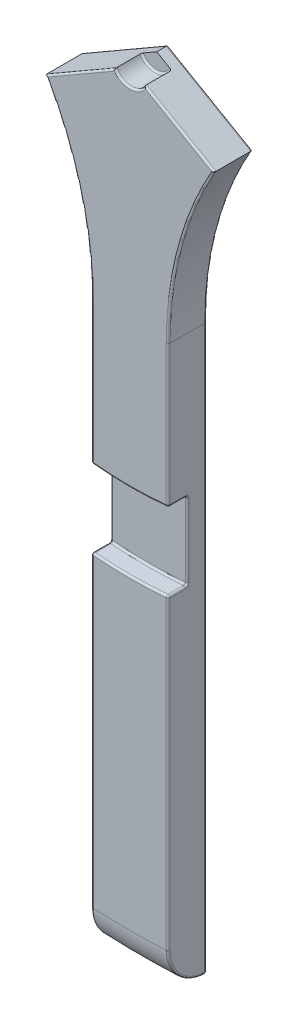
ISO-10303-21;
HEADER;
FILE_DESCRIPTION(('STEP AP214'),'2;1');
FILE_NAME('part.step','',(''),(''),'','','');
FILE_SCHEMA(('AUTOMOTIVE_DESIGN { 1 0 10303 214 1 1 1 1 }'));
ENDSEC;
DATA;
#1=APPLICATION_CONTEXT('core data for automotive mechanical design processes');
#2=APPLICATION_PROTOCOL_DEFINITION('international standard','automotive_design',2000,#1);
#3=PRODUCT_CONTEXT('',#1,'mechanical');
#4=PRODUCT('Part','Part','',(#3));
#5=PRODUCT_RELATED_PRODUCT_CATEGORY('part','',(#4));
#6=PRODUCT_DEFINITION_FORMATION('','',#4);
#7=PRODUCT_DEFINITION_CONTEXT('part definition',#1,'design');
#8=PRODUCT_DEFINITION('design','',#6,#7);
#9=PRODUCT_DEFINITION_SHAPE('','',#8);
#10=(LENGTH_UNIT() NAMED_UNIT(*) SI_UNIT(.MILLI.,.METRE.));
#11=(NAMED_UNIT(*) PLANE_ANGLE_UNIT() SI_UNIT($,.RADIAN.));
#12=(NAMED_UNIT(*) SI_UNIT($,.STERADIAN.) SOLID_ANGLE_UNIT());
#13=UNCERTAINTY_MEASURE_WITH_UNIT(LENGTH_MEASURE(1.E-05),#10,'distance_accuracy_value','');
#14=(GEOMETRIC_REPRESENTATION_CONTEXT(3) GLOBAL_UNCERTAINTY_ASSIGNED_CONTEXT((#13)) GLOBAL_UNIT_ASSIGNED_CONTEXT((#10,
#11,#12)) REPRESENTATION_CONTEXT('',''));
#15=CARTESIAN_POINT('',(0.,0.,0.));
#16=DIRECTION('',(0.,0.,1.));
#17=DIRECTION('',(1.,0.,0.));
#18=AXIS2_PLACEMENT_3D('',#15,#16,#17);
#19=CARTESIAN_POINT('',(99.7818472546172,-57.6090763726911,10.));
#20=DIRECTION('',(0.,0.,-1.));
#21=DIRECTION('',(-1.,0.,0.));
#22=AXIS2_PLACEMENT_3D('',#19,#20,#21);
#23=PLANE('',#22);
#24=DIRECTION('',(-0.86602540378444,0.499999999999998,0.));
#25=VECTOR('',#24,1.);
#26=CARTESIAN_POINT('',(99.5318472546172,-58.0420890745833,10.));
#27=LINE('',#26,#25);
#28=CARTESIAN_POINT('',(21.3466730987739,-12.9018577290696,10.));
#29=VERTEX_POINT('',#28);
#30=CARTESIAN_POINT('',(4.05842198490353,-2.92048129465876,10.));
#31=VERTEX_POINT('',#30);
#32=EDGE_CURVE('E291',#29,#31,#27,.T.);
#33=ORIENTED_EDGE('',*,*,#32,.T.);
#34=CARTESIAN_POINT('',(0.,0.,10.));
#35=DIRECTION('',(0.,0.,-1.));
#36=DIRECTION('',(-1.,0.,0.));
#37=AXIS2_PLACEMENT_3D('',#34,#35,#36);
#38=CIRCLE('',#37,5.);
#39=CARTESIAN_POINT('',(-4.05842198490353,-2.92048129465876,10.));
#40=VERTEX_POINT('',#39);
#41=EDGE_CURVE('E295',#31,#40,#38,.T.);
#42=ORIENTED_EDGE('',*,*,#41,.T.);
#43=DIRECTION('',(-0.86602540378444,-0.499999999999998,0.));
#44=VECTOR('',#43,1.);
#45=CARTESIAN_POINT('',(50.140923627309,28.3715254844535,10.));
#46=LINE('',#45,#44);
#47=CARTESIAN_POINT('',(-21.346673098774,-12.9018577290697,10.));
#48=VERTEX_POINT('',#47);
#49=EDGE_CURVE('E293',#40,#48,#46,.T.);
#50=ORIENTED_EDGE('',*,*,#49,.T.);
#51=CARTESIAN_POINT('',(-99.7818472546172,-57.6090763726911,10.));
#52=DIRECTION('',(0.,0.,-1.));
#53=DIRECTION('',(-1.,0.,0.));
#54=AXIS2_PLACEMENT_3D('',#51,#52,#53);
#55=CIRCLE('',#54,90.2818472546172);
#56=CARTESIAN_POINT('',(-9.49999999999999,-57.6090763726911,10.));
#57=VERTEX_POINT('',#56);
#58=EDGE_CURVE('E288',#48,#57,#55,.T.);
#59=ORIENTED_EDGE('',*,*,#58,.T.);
#60=DIRECTION('',(0.,-1.,0.));
#61=VECTOR('',#60,1.);
#62=CARTESIAN_POINT('',(-9.49999999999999,-57.6090763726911,10.));
#63=LINE('',#62,#61);
#64=CARTESIAN_POINT('',(-9.49999999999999,-94.0212741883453,10.));
#65=VERTEX_POINT('',#64);
#66=EDGE_CURVE('E284',#57,#65,#63,.T.);
#67=ORIENTED_EDGE('',*,*,#66,.T.);
#68=CARTESIAN_POINT('',(0.,0.,10.));
#69=DIRECTION('',(0.,0.,-1.));
#70=DIRECTION('',(-1.,0.,0.));
#71=AXIS2_PLACEMENT_3D('',#68,#69,#70);
#72=CIRCLE('',#71,94.5);
#73=CARTESIAN_POINT('',(9.49999999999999,-94.0212741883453,10.));
#74=VERTEX_POINT('',#73);
#75=EDGE_CURVE('E280',#65,#74,#72,.F.);
#76=ORIENTED_EDGE('',*,*,#75,.T.);
#77=DIRECTION('',(0.,1.,0.));
#78=VECTOR('',#77,1.);
#79=CARTESIAN_POINT('',(9.49999999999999,-57.6090763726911,10.));
#80=LINE('',#79,#78);
#81=CARTESIAN_POINT('',(9.49999999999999,-57.6090763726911,10.));
#82=VERTEX_POINT('',#81);
#83=EDGE_CURVE('E282',#74,#82,#80,.T.);
#84=ORIENTED_EDGE('',*,*,#83,.T.);
#85=CARTESIAN_POINT('',(99.7818472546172,-57.6090763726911,10.));
#86=DIRECTION('',(0.,0.,-1.));
#87=DIRECTION('',(-1.,0.,0.));
#88=AXIS2_PLACEMENT_3D('',#85,#86,#87);
#89=CIRCLE('',#88,90.2818472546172);
#90=EDGE_CURVE('E286',#82,#29,#89,.T.);
#91=ORIENTED_EDGE('',*,*,#90,.T.);
#92=EDGE_LOOP('',(#33,#42,#50,#59,#67,#76,#84,#91));
#93=FACE_BOUND('',#92,.T.);
#94=ADVANCED_FACE('F31',(#93),#23,.F.);
#95=CARTESIAN_POINT('',(0.,0.,10.));
#96=DIRECTION('',(-0.499999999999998,-0.86602540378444,0.));
#97=DIRECTION('',(0.86602540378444,-0.499999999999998,0.));
#98=AXIS2_PLACEMENT_3D('',#95,#96,#97);
#99=PLANE('',#98);
#100=DIRECTION('',(0.,0.,-1.));
#101=VECTOR('',#100,1.);
#102=CARTESIAN_POINT('',(22.0284867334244,-12.7181527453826,10.));
#103=LINE('',#102,#101);
#104=CARTESIAN_POINT('',(22.0284867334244,-12.7181527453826,9.5));
#105=VERTEX_POINT('',#104);
#106=CARTESIAN_POINT('',(22.0284867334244,-12.7181527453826,0.499999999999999));
#107=VERTEX_POINT('',#106);
#108=EDGE_CURVE('E259',#105,#107,#103,.T.);
#109=ORIENTED_EDGE('',*,*,#108,.T.);
#110=DIRECTION('',(-0.86602540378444,0.499999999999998,0.));
#111=VECTOR('',#110,1.);
#112=CARTESIAN_POINT('',(0.,0.,0.5));
#113=LINE('',#112,#111);
#114=CARTESIAN_POINT('',(0.,0.,0.499999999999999));
#115=VERTEX_POINT('',#114);
#116=EDGE_CURVE('E52',#107,#115,#113,.T.);
#117=ORIENTED_EDGE('',*,*,#116,.T.);
#118=DIRECTION('',(0.,0.,-1.));
#119=VECTOR('',#118,1.);
#120=CARTESIAN_POINT('',(0.,0.,10.));
#121=LINE('',#120,#119);
#122=CARTESIAN_POINT('',(0.,0.,3.));
#123=VERTEX_POINT('',#122);
#124=EDGE_CURVE('E264',#123,#115,#121,.T.);
#125=ORIENTED_EDGE('',*,*,#124,.F.);
#126=DIRECTION('',(-0.86602540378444,0.499999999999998,0.));
#127=VECTOR('',#126,1.);
#128=CARTESIAN_POINT('',(0.,0.,3.));
#129=LINE('',#128,#127);
#130=CARTESIAN_POINT('',(3.46410161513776,-1.99999999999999,3.));
#131=VERTEX_POINT('',#130);
#132=EDGE_CURVE('E253',#131,#123,#129,.T.);
#133=ORIENTED_EDGE('',*,*,#132,.F.);
#134=CARTESIAN_POINT('',(3.46410161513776,-1.99999999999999,3.5));
#135=DIRECTION('',(-0.499999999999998,-0.86602540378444,0.));
#136=DIRECTION('',(0.86602540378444,-0.499999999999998,0.));
#137=AXIS2_PLACEMENT_3D('',#134,#135,#136);
#138=CIRCLE('',#137,0.5);
#139=CARTESIAN_POINT('',(3.89711431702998,-2.24999999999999,3.5));
#140=VERTEX_POINT('',#139);
#141=EDGE_CURVE('E44',#131,#140,#138,.T.);
#142=ORIENTED_EDGE('',*,*,#141,.T.);
#143=DIRECTION('',(0.,0.,1.));
#144=VECTOR('',#143,1.);
#145=CARTESIAN_POINT('',(3.89711431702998,-2.24999999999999,3.));
#146=LINE('',#145,#144);
#147=CARTESIAN_POINT('',(3.89711431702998,-2.24999999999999,9.5));
#148=VERTEX_POINT('',#147);
#149=EDGE_CURVE('E260',#140,#148,#146,.T.);
#150=ORIENTED_EDGE('',*,*,#149,.T.);
#151=DIRECTION('',(-0.86602540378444,0.499999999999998,0.));
#152=VECTOR('',#151,1.);
#153=CARTESIAN_POINT('',(0.,0.,9.5));
#154=LINE('',#153,#152);
#155=EDGE_CURVE('E1015',#148,#105,#154,.F.);
#156=ORIENTED_EDGE('',*,*,#155,.T.);
#157=EDGE_LOOP('',(#109,#117,#125,#133,#142,#150,#156));
#158=FACE_BOUND('',#157,.T.);
#159=ADVANCED_FACE('F270',(#158),#99,.F.);
#160=CARTESIAN_POINT('',(0.,0.,10.));
#161=DIRECTION('',(0.499999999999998,-0.86602540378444,0.));
#162=DIRECTION('',(0.86602540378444,0.499999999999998,0.));
#163=AXIS2_PLACEMENT_3D('',#160,#161,#162);
#164=PLANE('',#163);
#165=ORIENTED_EDGE('',*,*,#124,.T.);
#166=DIRECTION('',(-0.86602540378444,-0.499999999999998,0.));
#167=VECTOR('',#166,1.);
#168=CARTESIAN_POINT('',(-22.0284867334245,-12.7181527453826,0.5));
#169=LINE('',#168,#167);
#170=CARTESIAN_POINT('',(-22.0284867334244,-12.7181527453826,0.499999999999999));
#171=VERTEX_POINT('',#170);
#172=EDGE_CURVE('E1013',#115,#171,#169,.T.);
#173=ORIENTED_EDGE('',*,*,#172,.T.);
#174=DIRECTION('',(0.,0.,-1.));
#175=VECTOR('',#174,1.);
#176=CARTESIAN_POINT('',(-22.0284867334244,-12.7181527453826,10.));
#177=LINE('',#176,#175);
#178=CARTESIAN_POINT('',(-22.0284867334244,-12.7181527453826,9.5));
#179=VERTEX_POINT('',#178);
#180=EDGE_CURVE('E271',#179,#171,#177,.T.);
#181=ORIENTED_EDGE('',*,*,#180,.F.);
#182=DIRECTION('',(-0.86602540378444,-0.499999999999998,0.));
#183=VECTOR('',#182,1.);
#184=CARTESIAN_POINT('',(0.,0.,9.5));
#185=LINE('',#184,#183);
#186=CARTESIAN_POINT('',(-3.89711431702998,-2.24999999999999,9.5));
#187=VERTEX_POINT('',#186);
#188=EDGE_CURVE('E1011',#179,#187,#185,.F.);
#189=ORIENTED_EDGE('',*,*,#188,.T.);
#190=DIRECTION('',(0.,0.,1.));
#191=VECTOR('',#190,1.);
#192=CARTESIAN_POINT('',(-3.89711431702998,-2.24999999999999,3.));
#193=LINE('',#192,#191);
#194=CARTESIAN_POINT('',(-3.89711431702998,-2.24999999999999,3.5));
#195=VERTEX_POINT('',#194);
#196=EDGE_CURVE('E617',#187,#195,#193,.F.);
#197=ORIENTED_EDGE('',*,*,#196,.T.);
#198=CARTESIAN_POINT('',(-3.46410161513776,-1.99999999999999,3.5));
#199=DIRECTION('',(0.499999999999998,-0.86602540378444,0.));
#200=DIRECTION('',(0.86602540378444,0.499999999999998,0.));
#201=AXIS2_PLACEMENT_3D('',#198,#199,#200);
#202=CIRCLE('',#201,0.5);
#203=CARTESIAN_POINT('',(-3.46410161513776,-1.99999999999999,3.));
#204=VERTEX_POINT('',#203);
#205=EDGE_CURVE('E11',#195,#204,#202,.T.);
#206=ORIENTED_EDGE('',*,*,#205,.T.);
#207=DIRECTION('',(-0.86602540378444,-0.499999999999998,0.));
#208=VECTOR('',#207,1.);
#209=CARTESIAN_POINT('',(0.,0.,3.));
#210=LINE('',#209,#208);
#211=EDGE_CURVE('E256',#123,#204,#210,.T.);
#212=ORIENTED_EDGE('',*,*,#211,.F.);
#213=EDGE_LOOP('',(#165,#173,#181,#189,#197,#206,#212));
#214=FACE_BOUND('',#213,.T.);
#215=ADVANCED_FACE('F263',(#214),#164,.F.);
#216=CARTESIAN_POINT('',(-99.7818472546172,-57.6090763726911,10.));
#217=DIRECTION('',(0.,0.,-1.));
#218=DIRECTION('',(-1.,0.,0.));
#219=AXIS2_PLACEMENT_3D('',#216,#217,#218);
#220=CYLINDRICAL_SURFACE('',#219,89.7818472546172);
#221=DIRECTION('',(0.,0.,-1.));
#222=VECTOR('',#221,1.);
#223=CARTESIAN_POINT('',(-9.99999999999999,-57.6090763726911,10.));
#224=LINE('',#223,#222);
#225=CARTESIAN_POINT('',(-9.99999999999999,-57.6090763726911,9.5));
#226=VERTEX_POINT('',#225);
#227=CARTESIAN_POINT('',(-9.99999999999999,-57.6090763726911,0.5));
#228=VERTEX_POINT('',#227);
#229=EDGE_CURVE('E274',#226,#228,#224,.T.);
#230=ORIENTED_EDGE('',*,*,#229,.F.);
#231=CARTESIAN_POINT('',(-99.7818472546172,-57.6090763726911,9.5));
#232=DIRECTION('',(0.,0.,-1.));
#233=DIRECTION('',(-1.,0.,0.));
#234=AXIS2_PLACEMENT_3D('',#231,#232,#233);
#235=CIRCLE('',#234,89.7818472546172);
#236=EDGE_CURVE('E299',#226,#179,#235,.F.);
#237=ORIENTED_EDGE('',*,*,#236,.T.);
#238=ORIENTED_EDGE('',*,*,#180,.T.);
#239=CARTESIAN_POINT('',(-99.7818472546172,-57.6090763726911,0.5));
#240=DIRECTION('',(0.,0.,-1.));
#241=DIRECTION('',(-1.,0.,0.));
#242=AXIS2_PLACEMENT_3D('',#239,#240,#241);
#243=CIRCLE('',#242,89.7818472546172);
#244=EDGE_CURVE('E297',#171,#228,#243,.T.);
#245=ORIENTED_EDGE('',*,*,#244,.T.);
#246=EDGE_LOOP('',(#230,#237,#238,#245));
#247=FACE_BOUND('',#246,.T.);
#248=ADVANCED_FACE('F369',(#247),#220,.F.);
#249=CARTESIAN_POINT('',(-9.99999999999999,-57.6090763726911,10.));
#250=DIRECTION('',(1.,0.,0.));
#251=DIRECTION('',(0.,1.,0.));
#252=AXIS2_PLACEMENT_3D('',#249,#250,#251);
#253=PLANE('',#252);
#254=DIRECTION('',(0.,0.,1.));
#255=VECTOR('',#254,1.);
#256=CARTESIAN_POINT('',(-9.99999999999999,-94.0212741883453,10.));
#257=LINE('',#256,#255);
#258=CARTESIAN_POINT('',(-9.99999999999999,-94.0212741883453,5.5));
#259=VERTEX_POINT('',#258);
#260=CARTESIAN_POINT('',(-9.99999999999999,-94.0212741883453,9.5));
#261=VERTEX_POINT('',#260);
#262=EDGE_CURVE('E1103',#259,#261,#257,.T.);
#263=ORIENTED_EDGE('',*,*,#262,.T.);
#264=DIRECTION('',(0.,-1.,0.));
#265=VECTOR('',#264,1.);
#266=CARTESIAN_POINT('',(-9.99999999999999,-57.6090763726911,9.5));
#267=LINE('',#266,#265);
#268=EDGE_CURVE('E534',#261,#226,#267,.F.);
#269=ORIENTED_EDGE('',*,*,#268,.T.);
#270=ORIENTED_EDGE('',*,*,#229,.T.);
#271=DIRECTION('',(0.,-1.,0.));
#272=VECTOR('',#271,1.);
#273=CARTESIAN_POINT('',(-9.99999999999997,-204.755952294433,0.5));
#274=LINE('',#273,#272);
#275=CARTESIAN_POINT('',(-9.99999999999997,-204.266039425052,0.5));
#276=VERTEX_POINT('',#275);
#277=EDGE_CURVE('E348',#228,#276,#274,.T.);
#278=ORIENTED_EDGE('',*,*,#277,.T.);
#279=CARTESIAN_POINT('',(-9.99999999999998,-191.617115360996,8.96342751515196));
#280=CARTESIAN_POINT('',(-9.99999999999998,-191.44889916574,9.44305564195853));
#281=CARTESIAN_POINT('',(-9.4917969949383,-191.451658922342,9.4351868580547));
#282=CARTESIAN_POINT('',(-9.99999999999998,-191.869782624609,9.05207051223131));
#283=CARTESIAN_POINT('',(-9.99999999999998,-191.715095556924,9.53572499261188));
#284=CARTESIAN_POINT('',(-9.49246549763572,-191.717591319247,9.5284952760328));
#285=CARTESIAN_POINT('',(-9.99999999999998,-192.126193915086,9.13000088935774));
#286=CARTESIAN_POINT('',(-9.99999999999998,-191.985364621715,9.61716588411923));
#287=CARTESIAN_POINT('',(-9.49314121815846,-191.987464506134,9.61052725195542));
#288=CARTESIAN_POINT('',(-9.99999999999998,-192.644653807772,9.26400036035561));
#289=CARTESIAN_POINT('',(-9.99999999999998,-192.531737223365,9.75695674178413));
#290=CARTESIAN_POINT('',(-9.49450198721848,-192.533144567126,9.75157932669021));
#291=CARTESIAN_POINT('',(-9.99999999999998,-192.906702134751,9.32007051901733));
#292=CARTESIAN_POINT('',(-9.99999999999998,-192.807828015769,9.81533846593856));
#293=CARTESIAN_POINT('',(-9.49518703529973,-192.808951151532,9.81060054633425));
#294=CARTESIAN_POINT('',(-9.99999999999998,-193.434434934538,9.40989237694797));
#295=CARTESIAN_POINT('',(-9.99999999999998,-193.363733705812,9.90854979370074));
#296=CARTESIAN_POINT('',(-9.49656096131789,-193.364391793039,9.90514987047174));
#297=CARTESIAN_POINT('',(-9.99999999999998,-193.700116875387,9.44365888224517));
#298=CARTESIAN_POINT('',(-9.99999999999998,-193.643538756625,9.9434272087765));
#299=CARTESIAN_POINT('',(-9.49724983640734,-193.644023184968,9.94069356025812));
#300=CARTESIAN_POINT('',(-9.99999999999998,-194.233304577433,9.48871998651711));
#301=CARTESIAN_POINT('',(-9.99999999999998,-194.204953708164,9.98948667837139));
#302=CARTESIAN_POINT('',(-9.49862663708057,-194.205205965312,9.9881263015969));
#303=CARTESIAN_POINT('',(-9.99999999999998,-194.50081031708,9.5000148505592));
#304=CARTESIAN_POINT('',(-9.99999999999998,-194.486562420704,10.0007018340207));
#305=CARTESIAN_POINT('',(-9.49931456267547,-194.486757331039,10.0000156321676));
#306=CARTESIAN_POINT('',(-9.99999999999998,-195.303430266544,9.49997031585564));
#307=CARTESIAN_POINT('',(-9.99999999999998,-195.330753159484,9.9986000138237));
#308=CARTESIAN_POINT('',(-9.50137009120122,-195.331520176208,9.99996875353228));
#309=CARTESIAN_POINT('',(-9.99999999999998,-195.83895249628,9.45475346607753));
#310=CARTESIAN_POINT('',(-9.99999999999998,-195.8941973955,9.94978122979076));
#311=CARTESIAN_POINT('',(-9.50273024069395,-195.89516172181,9.95237206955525));
#312=CARTESIAN_POINT('',(-9.99999999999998,-196.894412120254,9.27508092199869));
#313=CARTESIAN_POINT('',(-9.99999999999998,-197.004191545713,9.75814669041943));
#314=CARTESIAN_POINT('',(-9.50538968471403,-197.006043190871,9.76324307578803));
#315=CARTESIAN_POINT('',(-9.99999999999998,-197.414352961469,9.14064511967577));
#316=CARTESIAN_POINT('',(-9.99999999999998,-197.550861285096,9.6155867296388));
#317=CARTESIAN_POINT('',(-9.5066889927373,-197.553286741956,9.62173170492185));
#318=CARTESIAN_POINT('',(-9.99999999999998,-198.424327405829,8.78643995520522));
#319=CARTESIAN_POINT('',(-9.99999999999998,-198.612240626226,9.24073937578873));
#320=CARTESIAN_POINT('',(-9.50919417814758,-198.616297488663,9.24888416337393));
#321=CARTESIAN_POINT('',(-9.99999999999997,-198.914360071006,8.56666791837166));
#322=CARTESIAN_POINT('',(-9.99999999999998,-199.127130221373,9.00863376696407));
#323=CARTESIAN_POINT('',(-9.51040005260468,-199.132063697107,9.01754517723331));
#324=CARTESIAN_POINT('',(-9.99999999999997,-199.850833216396,8.04766760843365));
#325=CARTESIAN_POINT('',(-9.99999999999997,-200.110612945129,8.46101870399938));
#326=CARTESIAN_POINT('',(-9.51268907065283,-200.117715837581,8.47122906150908));
#327=CARTESIAN_POINT('',(-9.99999999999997,-200.297264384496,7.74842241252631));
#328=CARTESIAN_POINT('',(-9.99999999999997,-200.579421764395,8.14560973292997));
#329=CARTESIAN_POINT('',(-9.51377218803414,-200.587591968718,8.15623411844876));
#330=CARTESIAN_POINT('',(-9.99999999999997,-200.9239643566,7.24697672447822));
#331=CARTESIAN_POINT('',(-9.99999999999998,-201.237519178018,7.61716197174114));
#332=CARTESIAN_POINT('',(-9.51528383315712,-201.24720460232,7.62839655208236));
#333=CARTESIAN_POINT('',(-9.99999999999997,-201.125752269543,7.07101388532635));
#334=CARTESIAN_POINT('',(-9.99999999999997,-201.449299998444,7.43187325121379));
#335=CARTESIAN_POINT('',(-9.51576898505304,-201.459590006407,7.44317251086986));
#336=CARTESIAN_POINT('',(-9.99999999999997,-201.513760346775,6.70272562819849));
#337=CARTESIAN_POINT('',(-9.99999999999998,-201.85644487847,7.04417742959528));
#338=CARTESIAN_POINT('',(-9.51669928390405,-201.867975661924,7.05550066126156));
#339=CARTESIAN_POINT('',(-9.99999999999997,-201.699986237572,6.51040628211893));
#340=CARTESIAN_POINT('',(-9.99999999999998,-202.051845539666,6.84177704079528));
#341=CARTESIAN_POINT('',(-9.5171444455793,-202.063981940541,6.85305924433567));
#342=CARTESIAN_POINT('',(-9.99999999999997,-202.05556595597,6.11072826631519));
#343=CARTESIAN_POINT('',(-9.99999999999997,-202.424875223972,6.42125193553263));
#344=CARTESIAN_POINT('',(-9.51799230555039,-202.438236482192,6.43234554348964));
#345=CARTESIAN_POINT('',(-9.99999999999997,-202.224917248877,5.90336734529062));
#346=CARTESIAN_POINT('',(-9.99999999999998,-202.60253167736,6.20312020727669));
#347=CARTESIAN_POINT('',(-9.51839499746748,-202.616482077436,6.21407088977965));
#348=CARTESIAN_POINT('',(-9.99999999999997,-202.545466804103,5.47517377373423));
#349=CARTESIAN_POINT('',(-9.99999999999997,-202.938742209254,5.75278251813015));
#350=CARTESIAN_POINT('',(-9.51915551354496,-202.953866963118,5.76334081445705));
#351=CARTESIAN_POINT('',(-9.99999999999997,-202.696671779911,5.25434615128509));
#352=CARTESIAN_POINT('',(-9.99999999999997,-203.097331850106,5.52057266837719));
#353=CARTESIAN_POINT('',(-9.51951335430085,-203.113013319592,5.53089068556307));
#354=CARTESIAN_POINT('',(-9.99999999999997,-202.979812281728,4.80088529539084));
#355=CARTESIAN_POINT('',(-9.99999999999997,-203.394251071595,5.04382913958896));
#356=CARTESIAN_POINT('',(-9.52018212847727,-203.411024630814,5.05356346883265));
#357=CARTESIAN_POINT('',(-9.99999999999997,-203.111761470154,4.56826059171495));
#358=CARTESIAN_POINT('',(-9.99999999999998,-203.532621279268,4.79929099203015));
#359=CARTESIAN_POINT('',(-9.52049309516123,-203.549903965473,4.80869535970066));
#360=CARTESIAN_POINT('',(-9.99999999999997,-203.355531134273,4.09280196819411));
#361=CARTESIAN_POINT('',(-9.99999999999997,-203.788213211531,4.29956566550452));
#362=CARTESIAN_POINT('',(-9.52106664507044,-203.806476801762,4.30821259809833));
#363=CARTESIAN_POINT('',(-9.99999999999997,-203.467359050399,3.84997186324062));
#364=CARTESIAN_POINT('',(-9.99999999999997,-203.905466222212,4.04436517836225));
#365=CARTESIAN_POINT('',(-9.52132924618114,-203.924178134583,4.05260196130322));
#366=CARTESIAN_POINT('',(-9.99999999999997,-203.670205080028,3.3556037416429));
#367=CARTESIAN_POINT('',(-9.99999999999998,-204.118121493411,3.52488787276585));
#368=CARTESIAN_POINT('',(-9.52180494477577,-204.137678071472,3.5322144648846));
#369=CARTESIAN_POINT('',(-9.99999999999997,-203.761210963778,3.10406070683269));
#370=CARTESIAN_POINT('',(-9.99999999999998,-204.213531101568,3.26058500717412));
#371=CARTESIAN_POINT('',(-9.52201801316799,-204.233463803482,3.26743232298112));
#372=CARTESIAN_POINT('',(-9.99999999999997,-203.921647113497,2.59428804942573));
#373=CARTESIAN_POINT('',(-9.99999999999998,-204.381707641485,2.7250199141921));
#374=CARTESIAN_POINT('',(-9.52239325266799,-204.402326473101,2.73082952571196));
#375=CARTESIAN_POINT('',(-9.99999999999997,-203.991085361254,2.33606093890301));
#376=CARTESIAN_POINT('',(-9.99999999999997,-204.454499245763,2.45373678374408));
#377=CARTESIAN_POINT('',(-9.52255544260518,-204.47541181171,2.45901151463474));
#378=CARTESIAN_POINT('',(-9.99999999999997,-204.107860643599,1.8149957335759));
#379=CARTESIAN_POINT('',(-9.99999999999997,-204.576898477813,1.90638313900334));
#380=CARTESIAN_POINT('',(-9.52282801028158,-204.598320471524,1.91052182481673));
#381=CARTESIAN_POINT('',(-9.99999999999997,-204.155225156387,1.55216379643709));
#382=CARTESIAN_POINT('',(-9.99999999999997,-204.626546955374,1.63029345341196));
#383=CARTESIAN_POINT('',(-9.52293845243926,-204.648172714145,1.63385662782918));
#384=CARTESIAN_POINT('',(-9.99999999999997,-204.22764504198,1.02344084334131));
#385=CARTESIAN_POINT('',(-9.99999999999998,-204.702450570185,1.07494702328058));
#386=CARTESIAN_POINT('',(-9.52310725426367,-204.724396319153,1.07730615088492));
#387=CARTESIAN_POINT('',(-9.99999999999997,-204.25270016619,0.757549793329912));
#388=CARTESIAN_POINT('',(-9.99999999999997,-204.728713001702,0.795663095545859));
#389=CARTESIAN_POINT('',(-9.52316561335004,-204.750767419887,0.797420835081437));
#390=CARTESIAN_POINT('',(-9.99999999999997,-204.280321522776,0.224417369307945));
#391=CARTESIAN_POINT('',(-9.99999999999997,-204.757661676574,0.235712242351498));
#392=CARTESIAN_POINT('',(-9.52322995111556,-204.779839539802,0.236228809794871));
#393=CARTESIAN_POINT('',(-9.99999999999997,-204.282872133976,-0.0428248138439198));
#394=CARTESIAN_POINT('',(-9.99999999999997,-204.760334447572,-0.0449835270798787));
#395=CARTESIAN_POINT('',(-9.52323589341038,-204.782524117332,-0.0450787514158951));
#396=CARTESIAN_POINT('',(-9.99999999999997,-204.265459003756,-0.576587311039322));
#397=CARTESIAN_POINT('',(-9.99999999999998,-204.742086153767,-0.605593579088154));
#398=CARTESIAN_POINT('',(-9.52319532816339,-204.764196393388,-0.606934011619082));
#399=CARTESIAN_POINT('',(-9.99999999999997,-204.245494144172,-0.84310758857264));
#400=CARTESIAN_POINT('',(-9.99999999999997,-204.721162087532,-0.885535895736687));
#401=CARTESIAN_POINT('',(-9.52314881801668,-204.74318291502,-0.887481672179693));
#402=CARTESIAN_POINT('',(-9.99999999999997,-204.214279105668,-1.10830907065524));
#403=CARTESIAN_POINT('',(-9.99999999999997,-204.688444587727,-1.16406774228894));
#404=CARTESIAN_POINT('',(-9.5230760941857,-204.710328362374,-1.16664112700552));
#405=(BOUNDED_SURFACE() B_SPLINE_SURFACE(3,2,((#279,#280,#281),(#282,#283,#284),(#285,#286,
#287),(#288,#289,#290),(#291,#292,#293),(#294,#295,#296),(#297,#298,#299),(#300,#301,#302),
(#303,#304,#305),(#306,#307,#308),(#309,#310,#311),(#312,#313,#314),(#315,#316,#317),(#318,#319,
#320),(#321,#322,#323),(#324,#325,#326),(#327,#328,#329),(#330,#331,#332),(#333,#334,#335),
(#336,#337,#338),(#339,#340,#341),(#342,#343,#344),(#345,#346,#347),(#348,#349,#350),(#351,#352,
#353),(#354,#355,#356),(#357,#358,#359),(#360,#361,#362),(#363,#364,#365),(#366,#367,#368),
(#369,#370,#371),(#372,#373,#374),(#375,#376,#377),(#378,#379,#380),(#381,#382,#383),(#384,#385,
#386),(#387,#388,#389),(#390,#391,#392),(#393,#394,#395),(#396,#397,#398),(#399,#400,#401),
(#402,#403,#404)),.UNSPECIFIED.,.F.,.F.,.F.) B_SPLINE_SURFACE_WITH_KNOTS((4,2,2,2,2,2,2,2,2,2,2,
2,2,2,2,2,2,2,2,2,4),(3,3),(0.,0.803034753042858,1.60603038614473,2.4084924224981,
3.21094499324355,4.81493293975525,6.41856338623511,8.0222440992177,9.62626656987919,
10.4286848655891,11.230806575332,12.0330485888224,12.8349928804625,13.6363653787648,
14.4374409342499,15.2389857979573,16.0402336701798,16.8404814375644,17.640738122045,
18.4415502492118,19.2424021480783),(0.,1.),
.UNSPECIFIED.) GEOMETRIC_REPRESENTATION_ITEM() RATIONAL_B_SPLINE_SURFACE(((1.,0.701282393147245,
1.),(1.,0.701759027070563,1.),(1.,0.70224031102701,1.),(1.,0.703208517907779,1.),(1.,
0.703695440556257,1.),(1.,0.704670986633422,1.),(1.,0.705159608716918,1.),(1.,0.706135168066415,
1.),(1.,0.706622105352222,1.),(1.,0.708075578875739,1.),(1.,0.709035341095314,1.),(1.,
0.710908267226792,1.),(1.,0.711821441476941,1.),(1.,0.713578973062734,1.),(1.,0.714423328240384,
1.),(1.,0.716023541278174,1.),(1.,0.716779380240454,1.),(1.,0.717832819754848,1.),(1.,
0.718170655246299,1.),(1.,0.718818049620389,1.),(1.,0.719127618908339,1.),(1.,0.719716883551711,
1.),(1.,0.719996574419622,1.),(1.,0.720524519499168,1.),(1.,0.720772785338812,1.),(1.,
0.72123656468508,1.),(1.,0.721452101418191,1.),(1.,0.721849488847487,1.),(1.,0.722031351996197,
1.),(1.,0.722360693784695,1.),(1.,0.722508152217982,1.),(1.,0.722767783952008,1.),(1.,
0.722879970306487,1.),(1.,0.72306847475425,1.),(1.,0.723144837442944,1.),(1.,0.723261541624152,
1.),(1.,0.723301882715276,1.),(1.,0.723346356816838,1.),(1.,0.723350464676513,1.),(1.,
0.723322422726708,1.),(1.,0.723290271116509,1.),(1.,0.723239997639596,1.))) REPRESENTATION_ITEM('') SURFACE());
#406=CARTESIAN_POINT('',(-9.99999999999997,-204.214279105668,-1.10830907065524));
#407=CARTESIAN_POINT('',(-9.99999999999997,-204.245494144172,-0.843107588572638));
#408=CARTESIAN_POINT('',(-9.99999999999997,-204.265459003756,-0.57658731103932));
#409=CARTESIAN_POINT('',(-9.99999999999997,-204.282872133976,-0.0428248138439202));
#410=CARTESIAN_POINT('',(-9.99999999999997,-204.280321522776,0.224417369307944));
#411=CARTESIAN_POINT('',(-9.99999999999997,-204.25270016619,0.757549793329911));
#412=CARTESIAN_POINT('',(-9.99999999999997,-204.22764504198,1.02344084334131));
#413=CARTESIAN_POINT('',(-9.99999999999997,-204.155225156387,1.55216379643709));
#414=CARTESIAN_POINT('',(-9.99999999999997,-204.107860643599,1.8149957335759));
#415=CARTESIAN_POINT('',(-9.99999999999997,-203.991085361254,2.33606093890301));
#416=CARTESIAN_POINT('',(-9.99999999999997,-203.921647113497,2.59428804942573));
#417=CARTESIAN_POINT('',(-9.99999999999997,-203.761210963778,3.10406070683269));
#418=CARTESIAN_POINT('',(-9.99999999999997,-203.670205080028,3.3556037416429));
#419=CARTESIAN_POINT('',(-9.99999999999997,-203.467359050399,3.84997186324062));
#420=CARTESIAN_POINT('',(-9.99999999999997,-203.355531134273,4.09280196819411));
#421=CARTESIAN_POINT('',(-9.99999999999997,-203.111761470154,4.56826059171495));
#422=CARTESIAN_POINT('',(-9.99999999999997,-202.979812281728,4.80088529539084));
#423=CARTESIAN_POINT('',(-9.99999999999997,-202.696671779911,5.25434615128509));
#424=CARTESIAN_POINT('',(-9.99999999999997,-202.545466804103,5.47517377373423));
#425=CARTESIAN_POINT('',(-9.99999999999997,-202.224917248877,5.90336734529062));
#426=CARTESIAN_POINT('',(-9.99999999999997,-202.05556595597,6.11072826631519));
#427=CARTESIAN_POINT('',(-9.99999999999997,-201.699986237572,6.51040628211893));
#428=CARTESIAN_POINT('',(-9.99999999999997,-201.513760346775,6.70272562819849));
#429=CARTESIAN_POINT('',(-9.99999999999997,-201.125752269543,7.07101388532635));
#430=CARTESIAN_POINT('',(-9.99999999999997,-200.9239643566,7.24697672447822));
#431=CARTESIAN_POINT('',(-9.99999999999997,-200.297264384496,7.74842241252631));
#432=CARTESIAN_POINT('',(-9.99999999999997,-199.850833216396,8.04766760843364));
#433=CARTESIAN_POINT('',(-9.99999999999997,-198.914360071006,8.56666791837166));
#434=CARTESIAN_POINT('',(-9.99999999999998,-198.424327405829,8.78643995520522));
#435=CARTESIAN_POINT('',(-9.99999999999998,-197.414352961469,9.14064511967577));
#436=CARTESIAN_POINT('',(-9.99999999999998,-196.894412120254,9.27508092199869));
#437=CARTESIAN_POINT('',(-9.99999999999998,-195.83895249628,9.45475346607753));
#438=CARTESIAN_POINT('',(-9.99999999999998,-195.303430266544,9.49997031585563));
#439=CARTESIAN_POINT('',(-9.99999999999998,-194.50081031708,9.5000148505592));
#440=CARTESIAN_POINT('',(-9.99999999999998,-194.233304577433,9.48871998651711));
#441=CARTESIAN_POINT('',(-9.99999999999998,-193.700116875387,9.44365888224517));
#442=CARTESIAN_POINT('',(-9.99999999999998,-193.434434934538,9.40989237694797));
#443=CARTESIAN_POINT('',(-9.99999999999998,-192.906702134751,9.32007051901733));
#444=CARTESIAN_POINT('',(-9.99999999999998,-192.644653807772,9.26400036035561));
#445=CARTESIAN_POINT('',(-9.99999999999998,-192.126193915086,9.13000088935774));
#446=CARTESIAN_POINT('',(-9.99999999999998,-191.869782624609,9.05207051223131));
#447=CARTESIAN_POINT('',(-9.99999999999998,-191.617115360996,8.96342751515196));
#448=B_SPLINE_CURVE_WITH_KNOTS('',3,(#406,#407,#408,#409,#410,#411,#412,#413,#414,#415,#416,
#417,#418,#419,#420,#421,#422,#423,#424,#425,#426,#427,#428,#429,#430,#431,#432,#433,#434,#435,
#436,#437,#438,#439,#440,#441,#442,#443,#444,#445,#446,#447),.UNSPECIFIED.,.F.,.F.,(4,2,2,2,2,2,
2,2,2,2,2,2,2,2,2,2,2,2,2,2,4),(0.,0.800851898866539,1.60166402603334,2.40192071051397,
3.20216847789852,4.003416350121,4.80496121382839,5.60603676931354,6.40740926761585,
7.20935355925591,8.01159557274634,8.8137172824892,9.61613557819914,11.2201580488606,
12.8238387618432,14.4274692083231,16.0314571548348,16.8339097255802,17.6363717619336,
18.4393673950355,19.2424021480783),.UNSPECIFIED.);
#449=CARTESIAN_POINT('',(-9.99999999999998,-194.768452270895,9.5));
#450=VERTEX_POINT('',#449);
#451=EDGE_CURVE('E350',#276,#450,#448,.T.);
#452=ORIENTED_EDGE('',*,*,#451,.T.);
#453=DIRECTION('',(0.,-1.,0.));
#454=VECTOR('',#453,1.);
#455=CARTESIAN_POINT('',(-9.99999999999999,-57.6090763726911,9.5));
#456=LINE('',#455,#454);
#457=CARTESIAN_POINT('',(-9.99999999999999,-115.108644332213,9.5));
#458=VERTEX_POINT('',#457);
#459=EDGE_CURVE('E357',#450,#458,#456,.F.);
#460=ORIENTED_EDGE('',*,*,#459,.T.);
#461=DIRECTION('',(0.,0.,1.));
#462=VECTOR('',#461,1.);
#463=CARTESIAN_POINT('',(-9.99999999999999,-115.108644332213,10.));
#464=LINE('',#463,#462);
#465=CARTESIAN_POINT('',(-9.99999999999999,-115.108644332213,5.5));
#466=VERTEX_POINT('',#465);
#467=EDGE_CURVE('E635',#458,#466,#464,.F.);
#468=ORIENTED_EDGE('',*,*,#467,.T.);
#469=CARTESIAN_POINT('',(-9.46115729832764,-114.582071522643,5.66492508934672));
#470=CARTESIAN_POINT('',(-9.99999999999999,-114.54244899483,5.65103365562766));
#471=CARTESIAN_POINT('',(-9.99999999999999,-115.052487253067,5.82985017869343));
#472=CARTESIAN_POINT('',(-9.46040119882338,-114.591430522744,5.63848177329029));
#473=CARTESIAN_POINT('',(-9.99999999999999,-114.550181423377,5.62649651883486));
#474=CARTESIAN_POINT('',(-9.99999999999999,-115.071080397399,5.77696354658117));
#475=CARTESIAN_POINT('',(-9.45983041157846,-114.598498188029,5.61124761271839));
#476=CARTESIAN_POINT('',(-9.99999999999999,-114.555989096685,5.60149200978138));
#477=CARTESIAN_POINT('',(-9.99999999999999,-115.085121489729,5.72249522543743));
#478=CARTESIAN_POINT('',(-9.45906724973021,-114.607949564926,5.55600878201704));
#479=CARTESIAN_POINT('',(-9.99999999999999,-114.563739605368,5.55098128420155));
#480=CARTESIAN_POINT('',(-9.99999999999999,-115.103898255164,5.61201756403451));
#481=CARTESIAN_POINT('',(-9.45887459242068,-114.610336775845,5.52800470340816));
#482=CARTESIAN_POINT('',(-9.99999999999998,-114.565678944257,5.5254957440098));
#483=CARTESIAN_POINT('',(-9.99999999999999,-115.108640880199,5.55600940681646));
#484=CARTESIAN_POINT('',(-9.45887432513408,-114.610340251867,5.47195458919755));
#485=CARTESIAN_POINT('',(-9.99999999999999,-114.565679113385,5.4744671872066));
#486=CARTESIAN_POINT('',(-9.99999999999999,-115.108647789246,5.44390917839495));
#487=CARTESIAN_POINT('',(-9.45906727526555,-114.60794957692,5.44390855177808));
#488=CARTESIAN_POINT('',(-9.99999999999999,-114.5637343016,5.44894561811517));
#489=CARTESIAN_POINT('',(-9.99999999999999,-115.103898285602,5.38781710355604));
#490=CARTESIAN_POINT('',(-9.45983336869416,-114.598461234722,5.38861965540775));
#491=CARTESIAN_POINT('',(-9.99999999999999,-114.555964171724,5.39838421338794));
#492=CARTESIAN_POINT('',(-9.99999999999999,-115.08504806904,5.27723931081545));
#493=CARTESIAN_POINT('',(-9.46040643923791,-114.591364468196,5.36137664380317));
#494=CARTESIAN_POINT('',(-9.99999999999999,-114.550146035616,5.37336476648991));
#495=CARTESIAN_POINT('',(-9.99999999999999,-115.07094914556,5.22275328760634));
#496=CARTESIAN_POINT('',(-9.46191658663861,-114.572674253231,5.30847774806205));
#497=CARTESIAN_POINT('',(-9.99999999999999,-114.534678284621,5.32433424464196));
#498=CARTESIAN_POINT('',(-9.99999999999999,-115.033818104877,5.11695549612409));
#499=CARTESIAN_POINT('',(-9.4628534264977,-114.561083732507,5.2828208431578));
#500=CARTESIAN_POINT('',(-9.99999999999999,-114.525043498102,5.30034015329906));
#501=CARTESIAN_POINT('',(-9.99999999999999,-115.010791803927,5.06564168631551));
#502=CARTESIAN_POINT('',(-9.46506688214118,-114.533721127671,5.23376515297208));
#503=CARTESIAN_POINT('',(-9.99999999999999,-114.502020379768,5.2538522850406));
#504=CARTESIAN_POINT('',(-9.99999999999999,-114.956432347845,4.96753030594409));
#505=CARTESIAN_POINT('',(-9.46634395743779,-114.517943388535,5.2103694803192));
#506=CARTESIAN_POINT('',(-9.99999999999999,-114.488644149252,5.23137361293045));
#507=CARTESIAN_POINT('',(-9.99999999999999,-114.925087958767,4.92073896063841));
#508=CARTESIAN_POINT('',(-9.46920339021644,-114.482651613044,5.16651576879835));
#509=CARTESIAN_POINT('',(-9.99999999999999,-114.458297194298,5.18850538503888));
#510=CARTESIAN_POINT('',(-9.99999999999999,-114.854977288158,4.83303153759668));
#511=CARTESIAN_POINT('',(-9.47078599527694,-114.463134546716,5.14606013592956));
#512=CARTESIAN_POINT('',(-9.99999999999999,-114.441344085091,5.168124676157));
#513=CARTESIAN_POINT('',(-9.99999999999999,-114.816204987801,4.79212027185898));
#514=CARTESIAN_POINT('',(-9.47421234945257,-114.420929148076,5.10868085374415));
#515=CARTESIAN_POINT('',(-9.99999999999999,-114.404111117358,5.1300615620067));
#516=CARTESIAN_POINT('',(-9.99999999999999,-114.732361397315,4.71736170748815));
#517=CARTESIAN_POINT('',(-9.47605610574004,-114.398240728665,5.09175730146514));
#518=CARTESIAN_POINT('',(-9.99999999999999,-114.383853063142,5.11237958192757));
#519=CARTESIAN_POINT('',(-9.99999999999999,-114.687289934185,4.68351460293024));
#520=CARTESIAN_POINT('',(-9.47996168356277,-114.350242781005,5.06185484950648));
#521=CARTESIAN_POINT('',(-9.99999999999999,-114.340302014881,5.08023684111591));
#522=CARTESIAN_POINT('',(-9.99999999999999,-114.591941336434,4.62370969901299));
#523=CARTESIAN_POINT('',(-9.48202432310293,-114.324923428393,5.04889150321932));
#524=CARTESIAN_POINT('',(-9.99999999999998,-114.317018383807,5.06578182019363));
#525=CARTESIAN_POINT('',(-9.99999999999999,-114.541644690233,4.59778300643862));
#526=CARTESIAN_POINT('',(-9.48630168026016,-114.272491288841,5.02737345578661));
#527=CARTESIAN_POINT('',(-9.99999999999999,-114.268018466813,5.04075383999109));
#528=CARTESIAN_POINT('',(-9.99999999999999,-114.437490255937,4.55474691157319));
#529=CARTESIAN_POINT('',(-9.48851619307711,-114.245380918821,5.01881294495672));
#530=CARTESIAN_POINT('',(-9.99999999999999,-114.242323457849,5.03016249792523));
#531=CARTESIAN_POINT('',(-9.99999999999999,-114.383637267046,4.53762588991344));
#532=CARTESIAN_POINT('',(-9.49304660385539,-114.189999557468,5.00628835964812));
#533=CARTESIAN_POINT('',(-9.99999999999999,-114.189012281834,5.01328977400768));
#534=CARTESIAN_POINT('',(-9.99999999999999,-114.273627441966,4.51257671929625));
#535=CARTESIAN_POINT('',(-9.49536284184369,-114.161724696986,5.00234114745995));
#536=CARTESIAN_POINT('',(-9.99999999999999,-114.161401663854,5.00700534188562));
#537=CARTESIAN_POINT('',(-9.99999999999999,-114.217462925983,4.5046822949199));
#538=CARTESIAN_POINT('',(-9.50002450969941,-114.104902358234,4.9992069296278));
#539=CARTESIAN_POINT('',(-9.99999999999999,-114.105100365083,4.99918789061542));
#540=CARTESIAN_POINT('',(-9.99999999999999,-114.10459409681,4.4984138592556));
#541=CARTESIAN_POINT('',(-9.50236994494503,-114.076354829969,5.00002081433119));
#542=CARTESIAN_POINT('',(-9.99999999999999,-114.076415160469,4.99763369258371));
#543=CARTESIAN_POINT('',(-9.99999999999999,-114.047889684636,4.5000416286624));
#544=CARTESIAN_POINT('',(-9.50702563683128,-114.019770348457,5.00639894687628));
#545=CARTESIAN_POINT('',(-9.99999999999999,-114.018793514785,4.99953331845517));
#546=CARTESIAN_POINT('',(-9.99999999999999,-113.935496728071,4.51279789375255));
#547=CARTESIAN_POINT('',(-9.50933585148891,-113.99173399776,5.0119684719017));
#548=CARTESIAN_POINT('',(-9.99999999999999,-113.989854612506,5.00296977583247));
#549=CARTESIAN_POINT('',(-9.99999999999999,-113.87980938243,4.52393694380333));
#550=CARTESIAN_POINT('',(-9.51385434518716,-113.936972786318,5.02768880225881));
#551=CARTESIAN_POINT('',(-9.99999999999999,-113.932680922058,5.01489537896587));
#552=CARTESIAN_POINT('',(-9.99999999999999,-113.771041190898,4.55537760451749));
#553=CARTESIAN_POINT('',(-9.51606254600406,-113.910248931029,5.03784306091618));
#554=CARTESIAN_POINT('',(-9.99999999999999,-113.904436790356,5.02336750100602));
#555=CARTESIAN_POINT('',(-9.99999999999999,-113.717962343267,4.57568612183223));
#556=CARTESIAN_POINT('',(-9.51818587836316,-113.884587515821,5.05019723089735));
#557=CARTESIAN_POINT('',(-9.99999999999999,-113.876951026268,5.0344112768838));
#558=CARTESIAN_POINT('',(-9.99999999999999,-113.666994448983,4.60039446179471));
#559=(BOUNDED_SURFACE() B_SPLINE_SURFACE(3,2,((#469,#470,#471),(#472,#473,#474),(#475,#476,
#477),(#478,#479,#480),(#481,#482,#483),(#484,#485,#486),(#487,#488,#489),(#490,#491,#492),
(#493,#494,#495),(#496,#497,#498),(#499,#500,#501),(#502,#503,#504),(#505,#506,#507),(#508,#509,
#510),(#511,#512,#513),(#514,#515,#516),(#517,#518,#519),(#520,#521,#522),(#523,#524,#525),
(#526,#527,#528),(#529,#530,#531),(#532,#533,#534),(#535,#536,#537),(#538,#539,#540),(#541,#542,
#543),(#544,#545,#546),(#547,#548,#549),(#550,#551,#552),(#553,#554,#555),(#556,#557,#558)),
.UNSPECIFIED.,.F.,.F.,.F.) B_SPLINE_SURFACE_WITH_KNOTS((4,2,2,2,2,2,2,2,2,2,2,2,2,2,4),(3,3),
(0.,0.167957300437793,0.335788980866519,0.50386461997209,0.671908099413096,0.839842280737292,
1.0080044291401,1.17630341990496,1.34460703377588,1.51356339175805,1.68229623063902,
1.85164390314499,2.02102324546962,2.19059078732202,2.36028626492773),(0.,1.),
.UNSPECIFIED.) GEOMETRIC_REPRESENTATION_ITEM() RATIONAL_B_SPLINE_SURFACE(((1.,0.679085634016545,
1.),(1.,0.678528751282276,1.),(1.,0.678107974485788,1.),(1.,0.677545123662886,1.),(1.,
0.677402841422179,1.),(1.,0.677402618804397,1.),(1.,0.677545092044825,1.),(1.,0.678110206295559,
1.),(1.,0.678532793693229,1.),(1.,0.679644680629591,1.),(1.,0.680333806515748,1.),(1.,
0.681958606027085,1.),(1.,0.68289461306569,1.),(1.,0.684985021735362,1.),(1.,0.686139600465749,
1.),(1.,0.688631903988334,1.),(1.,0.68996963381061,1.),(1.,0.692794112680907,1.),(1.,
0.694281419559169,1.),(1.,0.697355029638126,1.),(1.,0.698941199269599,1.),(1.,0.702174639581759,
1.),(1.,0.703822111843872,1.),(1.,0.707126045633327,1.),(1.,0.708782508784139,1.),(1.,
0.712059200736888,1.),(1.,0.71367938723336,1.),(1.,0.716838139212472,1.),(1.,0.718376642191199,
1.),(1.,0.719851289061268,1.))) REPRESENTATION_ITEM('') SURFACE());
#560=CARTESIAN_POINT('',(-9.99999999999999,-113.666994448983,4.60039446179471));
#561=CARTESIAN_POINT('',(-9.99999999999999,-113.717962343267,4.57568612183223));
#562=CARTESIAN_POINT('',(-9.99999999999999,-113.771041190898,4.55537760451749));
#563=CARTESIAN_POINT('',(-9.99999999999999,-113.87980938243,4.52393694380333));
#564=CARTESIAN_POINT('',(-9.99999999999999,-113.935496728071,4.51279789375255));
#565=CARTESIAN_POINT('',(-9.99999999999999,-114.047889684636,4.5000416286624));
#566=CARTESIAN_POINT('',(-9.99999999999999,-114.10459409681,4.4984138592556));
#567=CARTESIAN_POINT('',(-9.99999999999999,-114.217462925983,4.5046822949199));
#568=CARTESIAN_POINT('',(-9.99999999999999,-114.273627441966,4.51257671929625));
#569=CARTESIAN_POINT('',(-9.99999999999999,-114.383637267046,4.53762588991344));
#570=CARTESIAN_POINT('',(-9.99999999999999,-114.437490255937,4.55474691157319));
#571=CARTESIAN_POINT('',(-9.99999999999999,-114.541644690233,4.59778300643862));
#572=CARTESIAN_POINT('',(-9.99999999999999,-114.591941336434,4.62370969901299));
#573=CARTESIAN_POINT('',(-9.99999999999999,-114.687289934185,4.68351460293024));
#574=CARTESIAN_POINT('',(-9.99999999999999,-114.732361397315,4.71736170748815));
#575=CARTESIAN_POINT('',(-9.99999999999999,-114.816204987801,4.79212027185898));
#576=CARTESIAN_POINT('',(-9.99999999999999,-114.854977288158,4.83303153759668));
#577=CARTESIAN_POINT('',(-9.99999999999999,-114.925087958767,4.92073896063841));
#578=CARTESIAN_POINT('',(-9.99999999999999,-114.956432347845,4.96753030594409));
#579=CARTESIAN_POINT('',(-9.99999999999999,-115.010791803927,5.06564168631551));
#580=CARTESIAN_POINT('',(-9.99999999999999,-115.033818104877,5.11695549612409));
#581=CARTESIAN_POINT('',(-9.99999999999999,-115.07094914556,5.22275328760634));
#582=CARTESIAN_POINT('',(-9.99999999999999,-115.08504806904,5.27723931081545));
#583=CARTESIAN_POINT('',(-9.99999999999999,-115.103898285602,5.38781710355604));
#584=CARTESIAN_POINT('',(-9.99999999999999,-115.108647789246,5.44390917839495));
#585=CARTESIAN_POINT('',(-9.99999999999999,-115.108640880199,5.55600940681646));
#586=CARTESIAN_POINT('',(-9.99999999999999,-115.103898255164,5.61201756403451));
#587=CARTESIAN_POINT('',(-9.99999999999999,-115.085121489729,5.72249522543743));
#588=CARTESIAN_POINT('',(-9.99999999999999,-115.071080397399,5.77696354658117));
#589=CARTESIAN_POINT('',(-9.99999999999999,-115.052487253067,5.82985017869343));
#590=B_SPLINE_CURVE_WITH_KNOTS('',3,(#560,#561,#562,#563,#564,#565,#566,#567,#568,#569,#570,
#571,#572,#573,#574,#575,#576,#577,#578,#579,#580,#581,#582,#583,#584,#585,#586,#587,#588,#589),
.UNSPECIFIED.,.F.,.F.,(4,2,2,2,2,2,2,2,2,2,2,2,2,2,4),(0.,0.169695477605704,0.339263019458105,
0.508642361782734,0.677990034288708,0.846722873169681,1.01567923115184,1.18398284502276,
1.35228183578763,1.52044398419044,1.68837816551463,1.85642164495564,2.02449728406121,
2.19232896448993,2.36028626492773),.UNSPECIFIED.);
#591=CARTESIAN_POINT('',(-9.99999999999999,-114.105214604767,4.5));
#592=VERTEX_POINT('',#591);
#593=EDGE_CURVE('E637',#592,#466,#590,.T.);
#594=ORIENTED_EDGE('',*,*,#593,.F.);
#595=DIRECTION('',(0.,-1.,0.));
#596=VECTOR('',#595,1.);
#597=CARTESIAN_POINT('',(-9.99999999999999,-94.4722181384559,4.5));
#598=LINE('',#597,#596);
#599=CARTESIAN_POINT('',(-9.99999999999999,-95.0263121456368,4.5));
#600=VERTEX_POINT('',#599);
#601=EDGE_CURVE('E639',#592,#600,#598,.F.);
#602=ORIENTED_EDGE('',*,*,#601,.T.);
#603=CARTESIAN_POINT('',(-9.48350833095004,-95.1951466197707,5.0284879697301));
#604=CARTESIAN_POINT('',(-9.99999999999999,-95.1895002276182,5.04457046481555));
#605=CARTESIAN_POINT('',(-9.99999999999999,-95.3606894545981,4.55697593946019));
#606=CARTESIAN_POINT('',(-9.48614294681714,-95.1680805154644,5.01905261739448));
#607=CARTESIAN_POINT('',(-9.99999999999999,-95.1643700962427,5.03283806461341));
#608=CARTESIAN_POINT('',(-9.99999999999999,-95.3070821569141,4.53810523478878));
#609=CARTESIAN_POINT('',(-9.48886130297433,-95.1402022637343,5.01192971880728));
#610=CARTESIAN_POINT('',(-9.99999999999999,-95.1379049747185,5.02308438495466));
#611=CARTESIAN_POINT('',(-9.99999999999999,-95.2518677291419,4.52385943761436));
#612=CARTESIAN_POINT('',(-9.49438479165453,-95.0836533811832,5.00240597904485));
#613=CARTESIAN_POINT('',(-9.99999999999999,-95.0832435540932,5.00808854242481));
#614=CARTESIAN_POINT('',(-9.99999999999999,-95.1398723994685,4.50481195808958));
#615=CARTESIAN_POINT('',(-9.49718985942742,-95.0549833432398,5.00000169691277));
#616=CARTESIAN_POINT('',(-9.99999999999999,-95.0550620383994,5.00281898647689));
#617=CARTESIAN_POINT('',(-9.99999999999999,-95.0830926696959,4.50000339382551));
#618=CARTESIAN_POINT('',(-9.50280748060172,-94.9976680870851,4.99999830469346));
#619=CARTESIAN_POINT('',(-9.99999999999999,-94.9977503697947,4.99719945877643));
#620=CARTESIAN_POINT('',(-9.99999999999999,-94.9695853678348,4.49999660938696));
#621=CARTESIAN_POINT('',(-9.50562002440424,-94.969022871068,5.00239464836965));
#622=CARTESIAN_POINT('',(-9.99999999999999,-94.9686259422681,4.99681735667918));
#623=CARTESIAN_POINT('',(-9.99999999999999,-94.9128577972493,4.50478929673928));
#624=CARTESIAN_POINT('',(-9.51117452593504,-94.9125478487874,5.01190908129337));
#625=CARTESIAN_POINT('',(-9.99999999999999,-94.9103341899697,5.00119352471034));
#626=CARTESIAN_POINT('',(-9.99999999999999,-94.8010203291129,4.52381816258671));
#627=CARTESIAN_POINT('',(-9.51391649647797,-94.8847178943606,5.01902630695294));
#628=CARTESIAN_POINT('',(-9.99999999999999,-94.8811618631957,5.00592332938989));
#629=CARTESIAN_POINT('',(-9.99999999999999,-94.7459101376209,4.53805261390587));
#630=CARTESIAN_POINT('',(-9.51925005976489,-94.8306715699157,5.03778276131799));
#631=CARTESIAN_POINT('',(-9.99999999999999,-94.8237631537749,5.02056976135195));
#632=CARTESIAN_POINT('',(-9.99999999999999,-94.6388876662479,4.57556552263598));
#633=CARTESIAN_POINT('',(-9.52184172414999,-94.8044544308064,5.04941981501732));
#634=CARTESIAN_POINT('',(-9.99999999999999,-94.7955222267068,5.0304596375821));
#635=CARTESIAN_POINT('',(-9.99999999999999,-94.586973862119,4.59883963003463));
#636=CARTESIAN_POINT('',(-9.52680356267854,-94.7543344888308,5.07691179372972));
#637=CARTESIAN_POINT('',(-9.99999999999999,-94.7409398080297,5.05528490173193));
#638=CARTESIAN_POINT('',(-9.99999999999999,-94.4877312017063,4.6538235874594));
#639=CARTESIAN_POINT('',(-9.52917343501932,-94.7304348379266,5.09277235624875));
#640=CARTESIAN_POINT('',(-9.99999999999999,-94.7145790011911,5.07020910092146));
#641=CARTESIAN_POINT('',(-9.99999999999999,-94.4404085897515,4.68554471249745));
#642=CARTESIAN_POINT('',(-9.53361052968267,-94.6857452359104,5.12820864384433));
#643=CARTESIAN_POINT('',(-9.99999999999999,-94.6648509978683,5.10467939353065));
#644=CARTESIAN_POINT('',(-9.99999999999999,-94.3519224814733,4.75641728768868));
#645=CARTESIAN_POINT('',(-9.5356786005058,-94.6649465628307,5.14777358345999));
#646=CARTESIAN_POINT('',(-9.99999999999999,-94.6414492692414,5.12420255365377));
#647=CARTESIAN_POINT('',(-9.99999999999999,-94.3107417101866,4.79554716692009));
#648=CARTESIAN_POINT('',(-9.53945758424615,-94.6269814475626,5.19009688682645));
#649=CARTESIAN_POINT('',(-9.99999999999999,-94.5984469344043,5.16731903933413));
#650=CARTESIAN_POINT('',(-9.99999999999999,-94.2355731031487,4.88019377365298));
#651=CARTESIAN_POINT('',(-9.54116851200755,-94.6098148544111,5.21285511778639));
#652=CARTESIAN_POINT('',(-9.99999999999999,-94.578818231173,5.1909126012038));
#653=CARTESIAN_POINT('',(-9.99999999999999,-94.2015849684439,4.92571023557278));
#654=CARTESIAN_POINT('',(-9.54417453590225,-94.5796782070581,5.26082024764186));
#655=CARTESIAN_POINT('',(-9.99999999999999,-94.5442006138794,5.24130684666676));
#656=CARTESIAN_POINT('',(-9.99999999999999,-94.1419181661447,5.02164049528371));
#657=CARTESIAN_POINT('',(-9.5454712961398,-94.566691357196,5.28601680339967));
#658=CARTESIAN_POINT('',(-9.99999999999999,-94.5291676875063,5.26810383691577));
#659=CARTESIAN_POINT('',(-9.99999999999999,-94.1162062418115,5.07203360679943));
#660=CARTESIAN_POINT('',(-9.5476168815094,-94.5452149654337,5.33818281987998));
#661=CARTESIAN_POINT('',(-9.99999999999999,-94.5042437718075,5.3240374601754));
#662=CARTESIAN_POINT('',(-9.99999999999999,-94.0736867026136,5.17636563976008));
#663=CARTESIAN_POINT('',(-9.54846632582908,-94.536719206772,5.36514977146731));
#664=CARTESIAN_POINT('',(-9.99999999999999,-94.494325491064,5.35318896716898));
#665=CARTESIAN_POINT('',(-9.99999999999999,-94.0568667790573,5.23029954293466));
#666=CARTESIAN_POINT('',(-9.54969104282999,-94.5244729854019,5.42000803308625));
#667=CARTESIAN_POINT('',(-9.99999999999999,-94.4800202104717,5.41273224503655));
#668=CARTESIAN_POINT('',(-9.99999999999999,-94.0326217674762,5.34001606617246));
#669=CARTESIAN_POINT('',(-9.55006816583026,-94.5207040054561,5.44789529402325));
#670=CARTESIAN_POINT('',(-9.99999999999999,-94.4755994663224,5.44314246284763));
#671=CARTESIAN_POINT('',(-9.99999999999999,-94.0251600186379,5.39579058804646));
#672=CARTESIAN_POINT('',(-9.55034286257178,-94.5179585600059,5.50390621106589));
#673=CARTESIAN_POINT('',(-9.99999999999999,-94.4723826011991,5.50425336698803));
#674=CARTESIAN_POINT('',(-9.99999999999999,-94.0197246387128,5.50781242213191));
#675=CARTESIAN_POINT('',(-9.55024034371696,-94.518983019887,5.53202991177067));
#676=CARTESIAN_POINT('',(-9.99999999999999,-94.4735847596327,5.53498067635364));
#677=CARTESIAN_POINT('',(-9.99999999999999,-94.0217528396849,5.56405982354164));
#678=CARTESIAN_POINT('',(-9.54955887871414,-94.525794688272,5.58762863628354));
#679=CARTESIAN_POINT('',(-9.99999999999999,-94.4815605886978,5.59555483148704));
#680=CARTESIAN_POINT('',(-9.99999999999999,-94.0352384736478,5.67525727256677));
#681=CARTESIAN_POINT('',(-9.548981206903,-94.5315691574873,5.61510519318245));
#682=CARTESIAN_POINT('',(-9.99999999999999,-94.488326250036,5.62542954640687));
#683=CARTESIAN_POINT('',(-9.99999999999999,-94.0466706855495,5.73021038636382));
#684=CARTESIAN_POINT('',(-9.54737127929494,-94.5476737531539,5.66873763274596));
#685=CARTESIAN_POINT('',(-9.99999999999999,-94.50708699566,5.68340125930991));
#686=CARTESIAN_POINT('',(-9.99999999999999,-94.0785546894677,5.83747526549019));
#687=CARTESIAN_POINT('',(-9.54633870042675,-94.5580071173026,5.69489256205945));
#688=CARTESIAN_POINT('',(-9.99999999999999,-94.5191013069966,5.71151847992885));
#689=CARTESIAN_POINT('',(-9.99999999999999,-94.0990128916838,5.88978512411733));
#690=CARTESIAN_POINT('',(-9.54508920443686,-94.5705202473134,5.71999157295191));
#691=CARTESIAN_POINT('',(-9.99999999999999,-94.5335669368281,5.73818904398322));
#692=CARTESIAN_POINT('',(-9.99999999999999,-94.1237869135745,5.93998314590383));
#693=(BOUNDED_SURFACE() B_SPLINE_SURFACE(3,2,((#603,#604,#605),(#606,#607,#608),(#609,#610,
#611),(#612,#613,#614),(#615,#616,#617),(#618,#619,#620),(#621,#622,#623),(#624,#625,#626),
(#627,#628,#629),(#630,#631,#632),(#633,#634,#635),(#636,#637,#638),(#639,#640,#641),(#642,#643,
#644),(#645,#646,#647),(#648,#649,#650),(#651,#652,#653),(#654,#655,#656),(#657,#658,#659),
(#660,#661,#662),(#663,#664,#665),(#666,#667,#668),(#669,#670,#671),(#672,#673,#674),(#675,#676,
#677),(#678,#679,#680),(#681,#682,#683),(#684,#685,#686),(#687,#688,#689),(#690,#691,#692)),
.UNSPECIFIED.,.F.,.F.,.F.) B_SPLINE_SURFACE_WITH_KNOTS((4,2,2,2,2,2,2,2,2,2,2,2,2,2,4),(3,3),
(0.,0.170266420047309,0.340408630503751,0.510389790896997,0.680339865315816,0.850208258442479,
1.02030453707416,1.18991298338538,1.35951437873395,1.52842549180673,1.69710217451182,
1.86511597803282,2.03316221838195,2.2007592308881,2.36847546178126),(0.,1.),
.UNSPECIFIED.) GEOMETRIC_REPRESENTATION_ITEM() RATIONAL_B_SPLINE_SURFACE(((1.,0.695347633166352,
1.),(1.,0.697242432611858,1.),(1.,0.699189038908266,1.),(1.,0.703127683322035,1.),(1.,
0.705119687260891,1.),(1.,0.709091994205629,1.),(1.,0.711072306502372,1.),(1.,0.714967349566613,
1.),(1.,0.716882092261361,1.),(1.,0.720592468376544,1.),(1.,0.722388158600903,1.),(1.,
0.725814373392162,1.),(1.,0.727444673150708,1.),(1.,0.730488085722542,1.),(1.,0.731901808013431,
1.),(1.,0.734478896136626,1.),(1.,0.735642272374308,1.),(1.,0.737682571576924,1.),(1.,
0.738560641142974,1.),(1.,0.740011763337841,1.),(1.,0.74058523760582,1.),(1.,0.741411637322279,
1.),(1.,0.741665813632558,1.),(1.,0.74185097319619,1.),(1.,0.741781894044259,1.),(1.,
0.741322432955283,1.),(1.,0.740932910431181,1.),(1.,0.739845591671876,1.),(1.,0.739147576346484,
1.),(1.,0.738301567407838,1.))) REPRESENTATION_ITEM('') SURFACE());
#694=CARTESIAN_POINT('',(-9.99999999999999,-94.1237869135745,5.93998314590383));
#695=CARTESIAN_POINT('',(-9.99999999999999,-94.0990128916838,5.88978512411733));
#696=CARTESIAN_POINT('',(-9.99999999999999,-94.0785546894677,5.83747526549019));
#697=CARTESIAN_POINT('',(-9.99999999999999,-94.0466706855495,5.73021038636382));
#698=CARTESIAN_POINT('',(-9.99999999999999,-94.0352384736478,5.67525727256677));
#699=CARTESIAN_POINT('',(-9.99999999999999,-94.0217528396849,5.56405982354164));
#700=CARTESIAN_POINT('',(-9.99999999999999,-94.0197246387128,5.50781242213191));
#701=CARTESIAN_POINT('',(-9.99999999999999,-94.0251600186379,5.39579058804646));
#702=CARTESIAN_POINT('',(-9.99999999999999,-94.0326217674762,5.34001606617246));
#703=CARTESIAN_POINT('',(-9.99999999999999,-94.0568667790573,5.23029954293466));
#704=CARTESIAN_POINT('',(-9.99999999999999,-94.0736867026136,5.17636563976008));
#705=CARTESIAN_POINT('',(-9.99999999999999,-94.1162062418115,5.07203360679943));
#706=CARTESIAN_POINT('',(-9.99999999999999,-94.1419181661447,5.02164049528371));
#707=CARTESIAN_POINT('',(-9.99999999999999,-94.2015849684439,4.92571023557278));
#708=CARTESIAN_POINT('',(-9.99999999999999,-94.2355731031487,4.88019377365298));
#709=CARTESIAN_POINT('',(-9.99999999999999,-94.3107417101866,4.79554716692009));
#710=CARTESIAN_POINT('',(-9.99999999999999,-94.3519224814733,4.75641728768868));
#711=CARTESIAN_POINT('',(-9.99999999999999,-94.4404085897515,4.68554471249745));
#712=CARTESIAN_POINT('',(-9.99999999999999,-94.4877312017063,4.6538235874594));
#713=CARTESIAN_POINT('',(-9.99999999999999,-94.586973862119,4.59883963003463));
#714=CARTESIAN_POINT('',(-9.99999999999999,-94.6388876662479,4.57556552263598));
#715=CARTESIAN_POINT('',(-9.99999999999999,-94.7459101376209,4.53805261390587));
#716=CARTESIAN_POINT('',(-9.99999999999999,-94.8010203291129,4.52381816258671));
#717=CARTESIAN_POINT('',(-9.99999999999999,-94.9128577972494,4.50478929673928));
#718=CARTESIAN_POINT('',(-9.99999999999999,-94.9695853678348,4.49999660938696));
#719=CARTESIAN_POINT('',(-9.99999999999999,-95.0830926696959,4.50000339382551));
#720=CARTESIAN_POINT('',(-9.99999999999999,-95.1398723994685,4.50481195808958));
#721=CARTESIAN_POINT('',(-9.99999999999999,-95.2518677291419,4.52385943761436));
#722=CARTESIAN_POINT('',(-9.99999999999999,-95.3070821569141,4.53810523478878));
#723=CARTESIAN_POINT('',(-9.99999999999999,-95.3606894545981,4.55697593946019));
#724=B_SPLINE_CURVE_WITH_KNOTS('',3,(#694,#695,#696,#697,#698,#699,#700,#701,#702,#703,#704,
#705,#706,#707,#708,#709,#710,#711,#712,#713,#714,#715,#716,#717,#718,#719,#720,#721,#722,#723),
.UNSPECIFIED.,.F.,.F.,(4,2,2,2,2,2,2,2,2,2,2,2,2,2,4),(0.,0.167716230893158,0.335313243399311,
0.503359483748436,0.671373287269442,0.840049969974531,1.00896108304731,1.17856247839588,
1.3481709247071,1.51826720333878,1.68813559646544,1.85808567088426,2.02806683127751,
2.19820904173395,2.36847546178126),.UNSPECIFIED.);
#725=EDGE_CURVE('E377',#259,#600,#724,.T.);
#726=ORIENTED_EDGE('',*,*,#725,.F.);
#727=EDGE_LOOP('',(#263,#269,#270,#278,#452,#460,#468,#594,#602,#726));
#728=FACE_BOUND('',#727,.T.);
#729=ADVANCED_FACE('F363',(#728),#253,.F.);
#730=CARTESIAN_POINT('',(9.99999999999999,-57.6090763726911,10.));
#731=DIRECTION('',(-1.,0.,0.));
#732=DIRECTION('',(0.,-1.,0.));
#733=AXIS2_PLACEMENT_3D('',#730,#731,#732);
#734=PLANE('',#733);
#735=DIRECTION('',(0.,0.,-1.));
#736=VECTOR('',#735,1.);
#737=CARTESIAN_POINT('',(9.99999999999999,-57.6090763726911,10.));
#738=LINE('',#737,#736);
#739=CARTESIAN_POINT('',(9.99999999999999,-57.6090763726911,9.5));
#740=VERTEX_POINT('',#739);
#741=CARTESIAN_POINT('',(9.99999999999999,-57.6090763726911,0.5));
#742=VERTEX_POINT('',#741);
#743=EDGE_CURVE('E624',#740,#742,#738,.T.);
#744=ORIENTED_EDGE('',*,*,#743,.F.);
#745=DIRECTION('',(0.,1.,0.));
#746=VECTOR('',#745,1.);
#747=CARTESIAN_POINT('',(9.99999999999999,-57.6090763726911,9.5));
#748=LINE('',#747,#746);
#749=CARTESIAN_POINT('',(9.99999999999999,-94.0212741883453,9.5));
#750=VERTEX_POINT('',#749);
#751=EDGE_CURVE('E880',#740,#750,#748,.F.);
#752=ORIENTED_EDGE('',*,*,#751,.T.);
#753=DIRECTION('',(0.,0.,1.));
#754=VECTOR('',#753,1.);
#755=CARTESIAN_POINT('',(9.99999999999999,-94.0212741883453,10.));
#756=LINE('',#755,#754);
#757=CARTESIAN_POINT('',(9.99999999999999,-94.0212741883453,5.5));
#758=VERTEX_POINT('',#757);
#759=EDGE_CURVE('E894',#750,#758,#756,.F.);
#760=ORIENTED_EDGE('',*,*,#759,.T.);
#761=CARTESIAN_POINT('',(9.54743337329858,-94.5470534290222,5.66464134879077));
#762=CARTESIAN_POINT('',(9.99999999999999,-94.5063530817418,5.67890700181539));
#763=CARTESIAN_POINT('',(9.99999999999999,-94.0773265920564,5.82928269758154));
#764=CARTESIAN_POINT('',(9.54837028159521,-94.5376801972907,5.63824304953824));
#765=CARTESIAN_POINT('',(9.99999999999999,-94.4954415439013,5.65050978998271));
#766=CARTESIAN_POINT('',(9.99999999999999,-94.0587693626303,5.77648609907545));
#767=CARTESIAN_POINT('',(9.54907816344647,-94.5306012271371,5.61105559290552));
#768=CARTESIAN_POINT('',(9.99999999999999,-94.4871758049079,5.62101835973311));
#769=CARTESIAN_POINT('',(9.99999999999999,-94.0447544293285,5.72211118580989));
#770=CARTESIAN_POINT('',(9.5500250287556,-94.5211343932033,5.55591191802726));
#771=CARTESIAN_POINT('',(9.99999999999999,-94.4761132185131,5.56103001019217));
#772=CARTESIAN_POINT('',(9.99999999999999,-94.0260120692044,5.61182383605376));
#773=CARTESIAN_POINT('',(9.55026436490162,-94.5187430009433,5.5279562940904));
#774=CARTESIAN_POINT('',(9.99999999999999,-94.4733028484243,5.5305092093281));
#775=CARTESIAN_POINT('',(9.99999999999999,-94.0212776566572,5.55591258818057));
#776=CARTESIAN_POINT('',(9.55026473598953,-94.5187394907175,5.47198909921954));
#777=CARTESIAN_POINT('',(9.99999999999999,-94.4732962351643,5.46943120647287));
#778=CARTESIAN_POINT('',(9.99999999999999,-94.0212707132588,5.44397819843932));
#779=CARTESIAN_POINT('',(9.55002483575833,-94.5211367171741,5.44397752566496));
#780=CARTESIAN_POINT('',(9.99999999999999,-94.4761109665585,5.43884740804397));
#781=CARTESIAN_POINT('',(9.99999999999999,-94.0260166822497,5.38795505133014));
#782=CARTESIAN_POINT('',(9.54907323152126,-94.5306501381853,5.38875729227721));
#783=CARTESIAN_POINT('',(9.99999999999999,-94.4872380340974,5.3787802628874));
#784=CARTESIAN_POINT('',(9.99999999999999,-94.0448512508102,5.27751458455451));
#785=CARTESIAN_POINT('',(9.54836161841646,-94.5377654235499,5.36154847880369));
#786=CARTESIAN_POINT('',(9.99999999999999,-94.4955588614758,5.34927181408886));
#787=CARTESIAN_POINT('',(9.99999999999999,-94.058938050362,5.22309695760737));
#788=CARTESIAN_POINT('',(9.54648913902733,-94.5565014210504,5.30871733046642));
#789=CARTESIAN_POINT('',(9.99999999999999,-94.5173520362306,5.29237931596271));
#790=CARTESIAN_POINT('',(9.99999999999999,-94.0960318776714,5.11743466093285));
#791=CARTESIAN_POINT('',(9.54532858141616,-94.5681190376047,5.28309391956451));
#792=CARTESIAN_POINT('',(9.99999999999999,-94.5308386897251,5.26497388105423));
#793=CARTESIAN_POINT('',(9.99999999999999,-94.1190327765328,5.06618783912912));
#794=CARTESIAN_POINT('',(9.54259191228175,-94.5955408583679,5.23410066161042));
#795=CARTESIAN_POINT('',(9.99999999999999,-94.5624464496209,5.21313749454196));
#796=CARTESIAN_POINT('',(9.99999999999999,-94.173324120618,4.96820132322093));
#797=CARTESIAN_POINT('',(9.54101523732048,-94.6113507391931,5.21073392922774));
#798=CARTESIAN_POINT('',(9.99999999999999,-94.5805976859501,5.18869828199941));
#799=CARTESIAN_POINT('',(9.99999999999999,-94.2046258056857,4.92146785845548));
#800=CARTESIAN_POINT('',(9.53749203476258,-94.6467217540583,5.16691245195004));
#801=CARTESIAN_POINT('',(9.99999999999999,-94.6208505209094,5.14357169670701));
#802=CARTESIAN_POINT('',(9.99999999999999,-94.2746575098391,4.83382490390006));
#803=CARTESIAN_POINT('',(9.53554492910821,-94.6662887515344,5.14646234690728));
#804=CARTESIAN_POINT('',(9.99999999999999,-94.6429851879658,5.12288703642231));
#805=CARTESIAN_POINT('',(9.99999999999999,-94.3133991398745,4.79292469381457));
#806=CARTESIAN_POINT('',(9.531340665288,-94.708597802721,5.10908513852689));
#807=CARTESIAN_POINT('',(9.99999999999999,-94.6903470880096,5.08591610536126));
#808=CARTESIAN_POINT('',(9.99999999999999,-94.397170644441,4.71817027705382));
#809=CARTESIAN_POINT('',(9.52908349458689,-94.7313399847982,5.09215817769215));
#810=CARTESIAN_POINT('',(9.99999999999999,-94.7156010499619,5.06963620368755));
#811=CARTESIAN_POINT('',(9.99999999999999,-94.442200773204,4.68431635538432));
#812=CARTESIAN_POINT('',(9.52431245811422,-94.779485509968,5.06221193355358));
#813=CARTESIAN_POINT('',(9.99999999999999,-94.768423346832,5.04180645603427));
#814=CARTESIAN_POINT('',(9.99999999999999,-94.5375324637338,4.62442386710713));
#815=CARTESIAN_POINT('',(9.5217972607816,-94.8049026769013,5.04921444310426));
#816=CARTESIAN_POINT('',(9.99999999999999,-94.7960261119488,5.03029834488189));
#817=CARTESIAN_POINT('',(9.99999999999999,-94.5878614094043,4.59842888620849));
#818=CARTESIAN_POINT('',(9.51659740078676,-94.8575375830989,5.027624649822));
#819=CARTESIAN_POINT('',(9.99999999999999,-94.8524126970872,5.01236194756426));
#820=CARTESIAN_POINT('',(9.99999999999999,-94.6920872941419,4.55524929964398));
#821=CARTESIAN_POINT('',(9.51391296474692,-94.8847529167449,5.01902659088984));
#822=CARTESIAN_POINT('',(9.99999999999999,-94.881211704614,5.00594906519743));
#823=CARTESIAN_POINT('',(9.99999999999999,-94.745979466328,4.53805318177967));
#824=CARTESIAN_POINT('',(9.50843473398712,-94.9403887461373,5.00641321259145));
#825=CARTESIAN_POINT('',(9.99999999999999,-94.9392105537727,4.99816678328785));
#826=CARTESIAN_POINT('',(9.99999999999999,-94.856153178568,4.51282642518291));
#827=CARTESIAN_POINT('',(9.50564045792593,-94.9688146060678,5.00242111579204));
#828=CARTESIAN_POINT('',(9.99999999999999,-94.9684190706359,4.99684961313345));
#829=CARTESIAN_POINT('',(9.99999999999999,-94.912445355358,4.50484223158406));
#830=CARTESIAN_POINT('',(9.5000344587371,-95.02594401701,4.99920549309));
#831=CARTESIAN_POINT('',(9.99999999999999,-95.0261804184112,4.99914969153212));
#832=CARTESIAN_POINT('',(9.99999999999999,-95.0255826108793,4.49841098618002));
#833=CARTESIAN_POINT('',(9.49722273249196,-95.0546476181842,4.99998284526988));
#834=CARTESIAN_POINT('',(9.99999999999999,-95.0547317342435,5.00279561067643));
#835=CARTESIAN_POINT('',(9.99999999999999,-95.0824277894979,4.49996569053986));
#836=CARTESIAN_POINT('',(9.49165715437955,-95.1115623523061,5.00629964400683));
#837=CARTESIAN_POINT('',(9.99999999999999,-95.1103825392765,5.01469487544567));
#838=CARTESIAN_POINT('',(9.99999999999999,-95.1951457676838,4.51259928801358));
#839=CARTESIAN_POINT('',(9.48890340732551,-95.139772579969,5.01184706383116));
#840=CARTESIAN_POINT('',(9.99999999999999,-95.1374685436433,5.02298150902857));
#841=CARTESIAN_POINT('',(9.99999999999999,-95.2510167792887,4.52369412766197));
#842=CARTESIAN_POINT('',(9.48353297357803,-95.1948776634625,5.02754095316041));
#843=CARTESIAN_POINT('',(9.99999999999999,-95.1894873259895,5.04369215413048));
#844=CARTESIAN_POINT('',(9.99999999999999,-95.3601562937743,4.55508190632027));
#845=CARTESIAN_POINT('',(9.48091639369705,-95.2217714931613,5.03769094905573));
#846=CARTESIAN_POINT('',(9.99999999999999,-95.2143999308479,5.05613974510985));
#847=CARTESIAN_POINT('',(9.99999999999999,-95.4134227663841,4.57538189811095));
#848=CARTESIAN_POINT('',(9.47840775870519,-95.247597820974,5.05005091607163));
#849=CARTESIAN_POINT('',(9.99999999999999,-95.2378048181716,5.07035871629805));
#850=CARTESIAN_POINT('',(9.99999999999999,-95.4645761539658,4.60010183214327));
#851=(BOUNDED_SURFACE() B_SPLINE_SURFACE(3,2,((#761,#762,#763),(#764,#765,#766),(#767,#768,
#769),(#770,#771,#772),(#773,#774,#775),(#776,#777,#778),(#779,#780,#781),(#782,#783,#784),
(#785,#786,#787),(#788,#789,#790),(#791,#792,#793),(#794,#795,#796),(#797,#798,#799),(#800,#801,
#802),(#803,#804,#805),(#806,#807,#808),(#809,#810,#811),(#812,#813,#814),(#815,#816,#817),
(#818,#819,#820),(#821,#822,#823),(#824,#825,#826),(#827,#828,#829),(#830,#831,#832),(#833,#834,
#835),(#836,#837,#838),(#839,#840,#841),(#842,#843,#844),(#845,#846,#847),(#848,#849,#850)),
.UNSPECIFIED.,.F.,.F.,.F.) B_SPLINE_SURFACE_WITH_KNOTS((4,2,2,2,2,2,2,2,2,2,2,2,2,2,4),(3,3),
(0.,0.167667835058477,0.335209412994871,0.503078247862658,0.670914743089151,0.838636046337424,
1.0065856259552,1.17479947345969,1.34302012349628,1.51215729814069,1.68107260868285,
1.85083589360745,2.02063043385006,2.19070934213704,2.3609187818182),(0.,1.),
.UNSPECIFIED.) GEOMETRIC_REPRESENTATION_ITEM() RATIONAL_B_SPLINE_SURFACE(((1.,0.7398874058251,
1.),(1.,0.740520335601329,1.),(1.,0.740998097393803,1.),(1.,0.741636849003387,1.),(1.,
0.74179807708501,1.),(1.,0.741798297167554,1.),(1.,0.741636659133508,1.),(1.,0.740994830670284,
1.),(1.,0.740514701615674,1.),(1.,0.739249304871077,1.),(1.,0.738464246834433,1.),(1.,
0.736608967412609,1.),(1.,0.735538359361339,1.),(1.,0.733139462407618,1.),(1.,0.731810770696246,
1.),(1.,0.728932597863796,1.),(1.,0.727383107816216,1.),(1.,0.724096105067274,1.),(1.,
0.722357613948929,1.),(1.,0.718749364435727,1.),(1.,0.716879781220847,1.),(1.,0.713048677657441,
1.),(1.,0.711086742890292,1.),(1.,0.70713391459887,1.),(1.,0.705143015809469,1.),(1.,
0.701185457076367,1.),(1.,0.699218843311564,1.),(1.,0.695368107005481,1.),(1.,0.693484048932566,
1.),(1.,0.691670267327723,1.))) REPRESENTATION_ITEM('') SURFACE());
#852=CARTESIAN_POINT('',(9.99999999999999,-95.4645761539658,4.60010183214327));
#853=CARTESIAN_POINT('',(9.99999999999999,-95.4134227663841,4.57538189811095));
#854=CARTESIAN_POINT('',(9.99999999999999,-95.3601562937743,4.55508190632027));
#855=CARTESIAN_POINT('',(9.99999999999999,-95.2510167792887,4.52369412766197));
#856=CARTESIAN_POINT('',(9.99999999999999,-95.1951457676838,4.51259928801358));
#857=CARTESIAN_POINT('',(9.99999999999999,-95.0824277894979,4.49996569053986));
#858=CARTESIAN_POINT('',(9.99999999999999,-95.0255826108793,4.49841098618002));
#859=CARTESIAN_POINT('',(9.99999999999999,-94.912445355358,4.50484223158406));
#860=CARTESIAN_POINT('',(9.99999999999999,-94.856153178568,4.51282642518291));
#861=CARTESIAN_POINT('',(9.99999999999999,-94.745979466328,4.53805318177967));
#862=CARTESIAN_POINT('',(9.99999999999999,-94.6920872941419,4.55524929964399));
#863=CARTESIAN_POINT('',(9.99999999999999,-94.5878614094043,4.59842888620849));
#864=CARTESIAN_POINT('',(9.99999999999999,-94.5375324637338,4.62442386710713));
#865=CARTESIAN_POINT('',(9.99999999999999,-94.442200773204,4.68431635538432));
#866=CARTESIAN_POINT('',(9.99999999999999,-94.397170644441,4.71817027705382));
#867=CARTESIAN_POINT('',(9.99999999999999,-94.3133991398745,4.79292469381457));
#868=CARTESIAN_POINT('',(9.99999999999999,-94.2746575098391,4.83382490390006));
#869=CARTESIAN_POINT('',(9.99999999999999,-94.2046258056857,4.92146785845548));
#870=CARTESIAN_POINT('',(9.99999999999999,-94.173324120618,4.96820132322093));
#871=CARTESIAN_POINT('',(9.99999999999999,-94.1190327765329,5.06618783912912));
#872=CARTESIAN_POINT('',(9.99999999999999,-94.0960318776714,5.11743466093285));
#873=CARTESIAN_POINT('',(9.99999999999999,-94.058938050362,5.22309695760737));
#874=CARTESIAN_POINT('',(9.99999999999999,-94.0448512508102,5.27751458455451));
#875=CARTESIAN_POINT('',(9.99999999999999,-94.0260166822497,5.38795505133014));
#876=CARTESIAN_POINT('',(9.99999999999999,-94.0212707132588,5.44397819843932));
#877=CARTESIAN_POINT('',(9.99999999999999,-94.0212776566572,5.55591258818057));
#878=CARTESIAN_POINT('',(9.99999999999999,-94.0260120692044,5.61182383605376));
#879=CARTESIAN_POINT('',(9.99999999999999,-94.0447544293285,5.72211118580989));
#880=CARTESIAN_POINT('',(9.99999999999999,-94.0587693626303,5.77648609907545));
#881=CARTESIAN_POINT('',(9.99999999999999,-94.0773265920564,5.82928269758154));
#882=B_SPLINE_CURVE_WITH_KNOTS('',3,(#852,#853,#854,#855,#856,#857,#858,#859,#860,#861,#862,
#863,#864,#865,#866,#867,#868,#869,#870,#871,#872,#873,#874,#875,#876,#877,#878,#879,#880,#881),
.UNSPECIFIED.,.F.,.F.,(4,2,2,2,2,2,2,2,2,2,2,2,2,2,4),(0.,0.170209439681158,0.340288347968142,
0.510082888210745,0.679846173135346,0.848761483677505,1.01789865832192,1.18611930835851,
1.354333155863,1.52228273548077,1.69000403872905,1.85784053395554,2.02570936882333,
2.19325094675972,2.3609187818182),.UNSPECIFIED.);
#883=CARTESIAN_POINT('',(9.99999999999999,-95.0263121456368,4.5));
#884=VERTEX_POINT('',#883);
#885=EDGE_CURVE('E988',#884,#758,#882,.T.);
#886=ORIENTED_EDGE('',*,*,#885,.F.);
#887=DIRECTION('',(0.,1.,0.));
#888=VECTOR('',#887,1.);
#889=CARTESIAN_POINT('',(9.99999999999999,-114.564392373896,4.5));
#890=LINE('',#889,#888);
#891=CARTESIAN_POINT('',(9.99999999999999,-114.105214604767,4.5));
#892=VERTEX_POINT('',#891);
#893=EDGE_CURVE('E993',#884,#892,#890,.F.);
#894=ORIENTED_EDGE('',*,*,#893,.T.);
#895=CARTESIAN_POINT('',(9.51382149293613,-113.93738378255,5.02839623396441));
#896=CARTESIAN_POINT('',(9.99999999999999,-113.932931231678,5.01571037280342));
#897=CARTESIAN_POINT('',(9.99999999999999,-113.771857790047,4.55679246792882));
#898=CARTESIAN_POINT('',(9.51159903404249,-113.96429168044,5.01899208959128));
#899=CARTESIAN_POINT('',(9.99999999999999,-113.961333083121,5.00801362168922));
#900=CARTESIAN_POINT('',(9.99999999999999,-113.825302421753,4.5379841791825));
#901=CARTESIAN_POINT('',(9.50931334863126,-113.992005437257,5.01189213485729));
#902=CARTESIAN_POINT('',(9.99999999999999,-113.990158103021,5.00292724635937));
#903=CARTESIAN_POINT('',(9.99999999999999,-113.880348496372,4.52378426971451));
#904=CARTESIAN_POINT('',(9.50468392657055,-114.048218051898,5.00239865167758));
#905=CARTESIAN_POINT('',(9.99999999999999,-114.047879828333,4.99774492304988));
#906=CARTESIAN_POINT('',(9.99999999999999,-113.992001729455,4.50479730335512));
#907=CARTESIAN_POINT('',(9.50234023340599,-114.076716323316,5.00000169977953));
#908=CARTESIAN_POINT('',(9.99999999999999,-114.076781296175,4.9976677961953));
#909=CARTESIAN_POINT('',(9.99999999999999,-114.048607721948,4.50000339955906));
#910=CARTESIAN_POINT('',(9.49766127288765,-114.13369454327,4.99999830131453));
#911=CARTESIAN_POINT('',(9.99999999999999,-114.133762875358,5.00234163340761));
#912=CARTESIAN_POINT('',(9.99999999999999,-114.161785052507,4.49999660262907));
#913=CARTESIAN_POINT('',(9.49532600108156,-114.162174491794,5.00238877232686));
#914=CARTESIAN_POINT('',(9.99999999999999,-114.161840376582,5.00711221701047));
#915=CARTESIAN_POINT('',(9.99999999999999,-114.218356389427,4.50477754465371));
#916=CARTESIAN_POINT('',(9.49072871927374,-114.218320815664,5.01187957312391));
#917=CARTESIAN_POINT('',(9.99999999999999,-114.216409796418,5.02112951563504));
#918=CARTESIAN_POINT('',(9.99999999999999,-114.329884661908,4.52375914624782));
#919=CARTESIAN_POINT('',(9.48846669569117,-114.245987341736,5.01897902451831));
#920=CARTESIAN_POINT('',(9.99999999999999,-114.242891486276,5.03039555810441));
#921=CARTESIAN_POINT('',(9.99999999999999,-114.384841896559,4.53795804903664));
#922=CARTESIAN_POINT('',(9.48407994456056,-114.299713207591,5.03768676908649));
#923=CARTESIAN_POINT('',(9.99999999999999,-114.293588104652,5.05294984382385));
#924=CARTESIAN_POINT('',(9.99999999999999,-114.491565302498,4.57537353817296));
#925=CARTESIAN_POINT('',(9.48195514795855,-114.325773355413,5.04929277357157));
#926=CARTESIAN_POINT('',(9.99999999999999,-114.317787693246,5.06625148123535));
#927=CARTESIAN_POINT('',(9.99999999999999,-114.54333307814,4.59858554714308));
#928=CARTESIAN_POINT('',(9.47789810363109,-114.375592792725,5.07670809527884));
#929=CARTESIAN_POINT('',(9.99999999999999,-114.363420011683,5.09636885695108));
#930=CARTESIAN_POINT('',(9.99999999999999,-114.642299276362,4.65341619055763));
#931=CARTESIAN_POINT('',(9.47596611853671,-114.399348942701,5.09252304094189));
#932=CARTESIAN_POINT('',(9.99999999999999,-114.384828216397,5.11319831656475));
#933=CARTESIAN_POINT('',(9.99999999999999,-114.689491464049,4.6850460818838));
#934=CARTESIAN_POINT('',(9.47235595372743,-114.443787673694,5.12786409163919));
#935=CARTESIAN_POINT('',(9.99999999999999,-114.424372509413,5.14974265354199));
#936=CARTESIAN_POINT('',(9.99999999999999,-114.777771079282,4.75572818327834));
#937=CARTESIAN_POINT('',(9.47067721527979,-114.464477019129,5.14738180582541));
#938=CARTESIAN_POINT('',(9.99999999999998,-114.44249373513,5.16945305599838));
#939=CARTESIAN_POINT('',(9.99999999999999,-114.818871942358,4.79476361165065));
#940=CARTESIAN_POINT('',(9.46761503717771,-114.502249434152,5.18960006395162));
#941=CARTESIAN_POINT('',(9.99999999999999,-114.475221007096,5.21120100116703));
#942=CARTESIAN_POINT('',(9.99999999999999,-114.893910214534,4.87920012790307));
#943=CARTESIAN_POINT('',(9.46623158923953,-114.519332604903,5.21230051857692));
#944=CARTESIAN_POINT('',(9.99999999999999,-114.489805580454,5.23323325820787));
#945=CARTESIAN_POINT('',(9.99999999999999,-114.927847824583,4.92460103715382));
#946=CARTESIAN_POINT('',(9.46380156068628,-114.549359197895,5.26017765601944));
#947=CARTESIAN_POINT('',(9.99999999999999,-114.51522512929,5.27899042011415));
#948=CARTESIAN_POINT('',(9.99999999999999,-114.987499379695,5.0203553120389));
#949=CARTESIAN_POINT('',(9.46275412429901,-114.562313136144,5.28534783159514));
#950=CARTESIAN_POINT('',(9.99999999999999,-114.526051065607,5.30269940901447));
#951=CARTESIAN_POINT('',(9.99999999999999,-115.013234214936,5.07069566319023));
#952=CARTESIAN_POINT('',(9.46102148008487,-114.583750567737,5.33746122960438));
#953=CARTESIAN_POINT('',(9.99999999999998,-114.543869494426,5.35127873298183));
#954=CARTESIAN_POINT('',(9.99999999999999,-115.055822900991,5.17492245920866));
#955=CARTESIAN_POINT('',(9.4603357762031,-114.592240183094,5.36440196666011));
#956=CARTESIAN_POINT('',(9.99999999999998,-114.550853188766,5.37613088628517));
#957=CARTESIAN_POINT('',(9.99999999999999,-115.072688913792,5.2288039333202));
#958=CARTESIAN_POINT('',(9.45934464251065,-114.604513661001,5.41925213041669));
#959=CARTESIAN_POINT('',(9.99999999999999,-114.560929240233,5.42644472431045));
#960=CARTESIAN_POINT('',(9.99999999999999,-115.097072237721,5.33850426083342));
#961=CARTESIAN_POINT('',(9.45903829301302,-114.608308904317,5.44715904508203));
#962=CARTESIAN_POINT('',(9.99999999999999,-114.564022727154,5.45188495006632));
#963=CARTESIAN_POINT('',(9.99999999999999,-115.10461215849,5.39431809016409));
#964=CARTESIAN_POINT('',(9.45881108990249,-114.61112354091,5.50321554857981));
#965=CARTESIAN_POINT('',(9.99999999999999,-114.566319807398,5.50293760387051));
#966=CARTESIAN_POINT('',(9.99999999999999,-115.110203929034,5.50643109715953));
#967=CARTESIAN_POINT('',(9.45889031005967,-114.61014202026,5.53136518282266));
#968=CARTESIAN_POINT('',(9.99999999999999,-114.565520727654,5.52852864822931));
#969=CARTESIAN_POINT('',(9.99999999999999,-115.108253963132,5.56273036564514));
#970=CARTESIAN_POINT('',(9.45943227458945,-114.603428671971,5.58704364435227));
#971=CARTESIAN_POINT('',(9.99999999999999,-114.560034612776,5.57933367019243));
#972=CARTESIAN_POINT('',(9.99999999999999,-115.094916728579,5.67408728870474));
#973=CARTESIAN_POINT('',(9.45989427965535,-114.59770600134,5.61457356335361));
#974=CARTESIAN_POINT('',(9.99999999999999,-114.555359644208,5.60452729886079));
#975=CARTESIAN_POINT('',(9.99999999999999,-115.083547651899,5.7291471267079));
#976=CARTESIAN_POINT('',(9.46118649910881,-114.581709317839,5.66831682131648));
#977=CARTESIAN_POINT('',(9.99999999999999,-114.54216235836,5.65408995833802));
#978=CARTESIAN_POINT('',(9.99999999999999,-115.051767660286,5.83663364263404));
#979=CARTESIAN_POINT('',(9.46201697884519,-114.571432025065,5.69452919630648));
#980=CARTESIAN_POINT('',(9.99999999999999,-114.533647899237,5.67843988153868));
#981=CARTESIAN_POINT('',(9.99999999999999,-115.031350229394,5.88905839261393));
#982=CARTESIAN_POINT('',(9.46302416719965,-114.55897531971,5.71968628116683));
#983=CARTESIAN_POINT('',(9.99999999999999,-114.523228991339,5.70214274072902));
#984=CARTESIAN_POINT('',(9.99999999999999,-115.006603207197,5.93937256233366));
#985=(BOUNDED_SURFACE() B_SPLINE_SURFACE(3,2,((#895,#896,#897),(#898,#899,#900),(#901,#902,
#903),(#904,#905,#906),(#907,#908,#909),(#910,#911,#912),(#913,#914,#915),(#916,#917,#918),
(#919,#920,#921),(#922,#923,#924),(#925,#926,#927),(#928,#929,#930),(#931,#932,#933),(#934,#935,
#936),(#937,#938,#939),(#940,#941,#942),(#943,#944,#945),(#946,#947,#948),(#949,#950,#951),
(#952,#953,#954),(#955,#956,#957),(#958,#959,#960),(#961,#962,#963),(#964,#965,#966),(#967,#968,
#969),(#970,#971,#972),(#973,#974,#975),(#976,#977,#978),(#979,#980,#981),(#982,#983,#984)),
.UNSPECIFIED.,.F.,.F.,.F.) B_SPLINE_SURFACE_WITH_KNOTS((4,2,2,2,2,2,2,2,2,2,2,2,2,2,4),(3,3),
(0.,0.169745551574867,0.339367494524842,0.508880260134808,0.678361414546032,0.847756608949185,
1.01737947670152,1.18662245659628,1.35586068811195,1.52466440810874,1.69323603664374,
1.86139818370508,2.02959250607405,2.19746273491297,2.36545404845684),(0.,1.),
.UNSPECIFIED.) GEOMETRIC_REPRESENTATION_ITEM() RATIONAL_B_SPLINE_SURFACE(((1.,0.716813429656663,
1.),(1.,0.715263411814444,1.),(1.,0.713663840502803,1.),(1.,0.710412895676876,1.),(1.,
0.70876156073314,1.),(1.,0.705453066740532,1.),(1.,0.703795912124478,1.),(1.,0.700522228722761,
1.),(1.,0.698905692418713,1.),(1.,0.695760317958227,1.),(1.,0.694231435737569,1.),(1.,
0.691303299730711,1.),(1.,0.689904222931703,1.),(1.,0.687282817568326,1.),(1.,0.686060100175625,
1.),(1.,0.683824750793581,1.),(1.,0.682812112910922,1.),(1.,0.681030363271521,1.),(1.,
0.680260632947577,1.),(1.,0.678985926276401,1.),(1.,0.678480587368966,1.),(1.,0.677749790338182,
1.),(1.,0.677523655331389,1.),(1.,0.677355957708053,1.),(1.,0.677414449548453,1.),(1.,
0.67781437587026,1.),(1.,0.6781552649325,1.),(1.,0.679107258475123,1.),(1.,0.679718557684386,
1.),(1.,0.680458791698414,1.))) REPRESENTATION_ITEM('') SURFACE());
#986=CARTESIAN_POINT('',(9.99999999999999,-115.006603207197,5.93937256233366));
#987=CARTESIAN_POINT('',(9.99999999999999,-115.031350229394,5.88905839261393));
#988=CARTESIAN_POINT('',(9.99999999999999,-115.051767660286,5.83663364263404));
#989=CARTESIAN_POINT('',(9.99999999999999,-115.083547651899,5.7291471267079));
#990=CARTESIAN_POINT('',(9.99999999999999,-115.094916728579,5.67408728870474));
#991=CARTESIAN_POINT('',(9.99999999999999,-115.108253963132,5.56273036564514));
#992=CARTESIAN_POINT('',(9.99999999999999,-115.110203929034,5.50643109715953));
#993=CARTESIAN_POINT('',(9.99999999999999,-115.10461215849,5.39431809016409));
#994=CARTESIAN_POINT('',(9.99999999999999,-115.097072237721,5.33850426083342));
#995=CARTESIAN_POINT('',(9.99999999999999,-115.072688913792,5.2288039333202));
#996=CARTESIAN_POINT('',(9.99999999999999,-115.055822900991,5.17492245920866));
#997=CARTESIAN_POINT('',(9.99999999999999,-115.013234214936,5.07069566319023));
#998=CARTESIAN_POINT('',(9.99999999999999,-114.987499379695,5.0203553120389));
#999=CARTESIAN_POINT('',(9.99999999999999,-114.927847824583,4.92460103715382));
#1000=CARTESIAN_POINT('',(9.99999999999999,-114.893910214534,4.87920012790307));
#1001=CARTESIAN_POINT('',(9.99999999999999,-114.818871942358,4.79476361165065));
#1002=CARTESIAN_POINT('',(9.99999999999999,-114.777771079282,4.75572818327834));
#1003=CARTESIAN_POINT('',(9.99999999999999,-114.689491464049,4.6850460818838));
#1004=CARTESIAN_POINT('',(9.99999999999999,-114.642299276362,4.65341619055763));
#1005=CARTESIAN_POINT('',(9.99999999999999,-114.54333307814,4.59858554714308));
#1006=CARTESIAN_POINT('',(9.99999999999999,-114.491565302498,4.57537353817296));
#1007=CARTESIAN_POINT('',(9.99999999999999,-114.384841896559,4.53795804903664));
#1008=CARTESIAN_POINT('',(9.99999999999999,-114.329884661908,4.52375914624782));
#1009=CARTESIAN_POINT('',(9.99999999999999,-114.218356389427,4.50477754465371));
#1010=CARTESIAN_POINT('',(9.99999999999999,-114.161785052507,4.49999660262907));
#1011=CARTESIAN_POINT('',(9.99999999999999,-114.048607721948,4.50000339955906));
#1012=CARTESIAN_POINT('',(9.99999999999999,-113.992001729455,4.50479730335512));
#1013=CARTESIAN_POINT('',(9.99999999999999,-113.880348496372,4.52378426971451));
#1014=CARTESIAN_POINT('',(9.99999999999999,-113.825302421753,4.5379841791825));
#1015=CARTESIAN_POINT('',(9.99999999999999,-113.771857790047,4.55679246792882));
#1016=B_SPLINE_CURVE_WITH_KNOTS('',3,(#986,#987,#988,#989,#990,#991,#992,#993,#994,#995,#996,
#997,#998,#999,#1000,#1001,#1002,#1003,#1004,#1005,#1006,#1007,#1008,#1009,#1010,#1011,#1012,
#1013,#1014,#1015),.UNSPECIFIED.,.F.,.F.,(4,2,2,2,2,2,2,2,2,2,2,2,2,2,4),(0.,0.167991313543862,
0.335861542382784,0.504055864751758,0.672218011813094,0.840789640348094,1.00959336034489,
1.17883159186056,1.34807457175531,1.51769743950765,1.6870926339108,1.85657378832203,
2.02608655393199,2.19570849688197,2.36545404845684),.UNSPECIFIED.);
#1017=CARTESIAN_POINT('',(9.99999999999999,-115.108644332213,5.5));
#1018=VERTEX_POINT('',#1017);
#1019=EDGE_CURVE('E995',#1018,#892,#1016,.T.);
#1020=ORIENTED_EDGE('',*,*,#1019,.F.);
#1021=DIRECTION('',(0.,0.,1.));
#1022=VECTOR('',#1021,1.);
#1023=CARTESIAN_POINT('',(9.99999999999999,-115.108644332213,10.));
#1024=LINE('',#1023,#1022);
#1025=CARTESIAN_POINT('',(9.99999999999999,-115.108644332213,9.5));
#1026=VERTEX_POINT('',#1025);
#1027=EDGE_CURVE('E998',#1018,#1026,#1024,.T.);
#1028=ORIENTED_EDGE('',*,*,#1027,.T.);
#1029=DIRECTION('',(0.,1.,0.));
#1030=VECTOR('',#1029,1.);
#1031=CARTESIAN_POINT('',(9.99999999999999,-57.6090763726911,9.5));
#1032=LINE('',#1031,#1030);
#1033=CARTESIAN_POINT('',(9.99999999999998,-194.768452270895,9.5));
#1034=VERTEX_POINT('',#1033);
#1035=EDGE_CURVE('E661',#1026,#1034,#1032,.F.);
#1036=ORIENTED_EDGE('',*,*,#1035,.T.);
#1037=CARTESIAN_POINT('',(9.4917969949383,-191.451658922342,9.4351868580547));
#1038=CARTESIAN_POINT('',(9.99999999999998,-191.44889916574,9.44305564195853));
#1039=CARTESIAN_POINT('',(9.99999999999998,-191.617115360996,8.96342751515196));
#1040=CARTESIAN_POINT('',(9.49246549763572,-191.717591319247,9.5284952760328));
#1041=CARTESIAN_POINT('',(9.99999999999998,-191.715095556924,9.53572499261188));
#1042=CARTESIAN_POINT('',(9.99999999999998,-191.869782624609,9.05207051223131));
#1043=CARTESIAN_POINT('',(9.49314121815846,-191.987464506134,9.61052725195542));
#1044=CARTESIAN_POINT('',(9.99999999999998,-191.985364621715,9.61716588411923));
#1045=CARTESIAN_POINT('',(9.99999999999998,-192.126193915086,9.13000088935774));
#1046=CARTESIAN_POINT('',(9.49450198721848,-192.533144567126,9.75157932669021));
#1047=CARTESIAN_POINT('',(9.99999999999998,-192.531737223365,9.75695674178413));
#1048=CARTESIAN_POINT('',(9.99999999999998,-192.644653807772,9.26400036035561));
#1049=CARTESIAN_POINT('',(9.49518703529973,-192.808951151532,9.81060054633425));
#1050=CARTESIAN_POINT('',(9.99999999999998,-192.807828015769,9.81533846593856));
#1051=CARTESIAN_POINT('',(9.99999999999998,-192.906702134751,9.32007051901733));
#1052=CARTESIAN_POINT('',(9.49656096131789,-193.364391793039,9.90514987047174));
#1053=CARTESIAN_POINT('',(9.99999999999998,-193.363733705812,9.90854979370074));
#1054=CARTESIAN_POINT('',(9.99999999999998,-193.434434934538,9.40989237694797));
#1055=CARTESIAN_POINT('',(9.49724983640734,-193.644023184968,9.94069356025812));
#1056=CARTESIAN_POINT('',(9.99999999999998,-193.643538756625,9.9434272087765));
#1057=CARTESIAN_POINT('',(9.99999999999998,-193.700116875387,9.44365888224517));
#1058=CARTESIAN_POINT('',(9.49862663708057,-194.205205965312,9.9881263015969));
#1059=CARTESIAN_POINT('',(9.99999999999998,-194.204953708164,9.98948667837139));
#1060=CARTESIAN_POINT('',(9.99999999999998,-194.233304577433,9.48871998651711));
#1061=CARTESIAN_POINT('',(9.49931456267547,-194.486757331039,10.0000156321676));
#1062=CARTESIAN_POINT('',(9.99999999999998,-194.486562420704,10.0007018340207));
#1063=CARTESIAN_POINT('',(9.99999999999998,-194.50081031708,9.5000148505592));
#1064=CARTESIAN_POINT('',(9.50137009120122,-195.331520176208,9.99996875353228));
#1065=CARTESIAN_POINT('',(9.99999999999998,-195.330753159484,9.9986000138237));
#1066=CARTESIAN_POINT('',(9.99999999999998,-195.303430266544,9.49997031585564));
#1067=CARTESIAN_POINT('',(9.50273024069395,-195.89516172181,9.95237206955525));
#1068=CARTESIAN_POINT('',(9.99999999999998,-195.8941973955,9.94978122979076));
#1069=CARTESIAN_POINT('',(9.99999999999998,-195.83895249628,9.45475346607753));
#1070=CARTESIAN_POINT('',(9.50538968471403,-197.006043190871,9.76324307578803));
#1071=CARTESIAN_POINT('',(9.99999999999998,-197.004191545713,9.75814669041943));
#1072=CARTESIAN_POINT('',(9.99999999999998,-196.894412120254,9.27508092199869));
#1073=CARTESIAN_POINT('',(9.5066889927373,-197.553286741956,9.62173170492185));
#1074=CARTESIAN_POINT('',(9.99999999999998,-197.550861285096,9.6155867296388));
#1075=CARTESIAN_POINT('',(9.99999999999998,-197.414352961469,9.14064511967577));
#1076=CARTESIAN_POINT('',(9.50919417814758,-198.616297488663,9.24888416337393));
#1077=CARTESIAN_POINT('',(9.99999999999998,-198.612240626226,9.24073937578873));
#1078=CARTESIAN_POINT('',(9.99999999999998,-198.424327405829,8.78643995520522));
#1079=CARTESIAN_POINT('',(9.51040005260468,-199.132063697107,9.01754517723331));
#1080=CARTESIAN_POINT('',(9.99999999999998,-199.127130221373,9.00863376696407));
#1081=CARTESIAN_POINT('',(9.99999999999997,-198.914360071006,8.56666791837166));
#1082=CARTESIAN_POINT('',(9.51268907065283,-200.117715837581,8.47122906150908));
#1083=CARTESIAN_POINT('',(9.99999999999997,-200.110612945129,8.46101870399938));
#1084=CARTESIAN_POINT('',(9.99999999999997,-199.850833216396,8.04766760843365));
#1085=CARTESIAN_POINT('',(9.51377218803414,-200.587591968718,8.15623411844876));
#1086=CARTESIAN_POINT('',(9.99999999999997,-200.579421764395,8.14560973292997));
#1087=CARTESIAN_POINT('',(9.99999999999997,-200.297264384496,7.74842241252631));
#1088=CARTESIAN_POINT('',(9.51528383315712,-201.24720460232,7.62839655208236));
#1089=CARTESIAN_POINT('',(9.99999999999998,-201.237519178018,7.61716197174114));
#1090=CARTESIAN_POINT('',(9.99999999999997,-200.9239643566,7.24697672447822));
#1091=CARTESIAN_POINT('',(9.51576898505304,-201.459590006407,7.44317251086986));
#1092=CARTESIAN_POINT('',(9.99999999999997,-201.449299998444,7.43187325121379));
#1093=CARTESIAN_POINT('',(9.99999999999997,-201.125752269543,7.07101388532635));
#1094=CARTESIAN_POINT('',(9.51669928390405,-201.867975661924,7.05550066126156));
#1095=CARTESIAN_POINT('',(9.99999999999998,-201.85644487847,7.04417742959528));
#1096=CARTESIAN_POINT('',(9.99999999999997,-201.513760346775,6.70272562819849));
#1097=CARTESIAN_POINT('',(9.5171444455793,-202.063981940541,6.85305924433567));
#1098=CARTESIAN_POINT('',(9.99999999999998,-202.051845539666,6.84177704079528));
#1099=CARTESIAN_POINT('',(9.99999999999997,-201.699986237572,6.51040628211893));
#1100=CARTESIAN_POINT('',(9.51799230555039,-202.438236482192,6.43234554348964));
#1101=CARTESIAN_POINT('',(9.99999999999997,-202.424875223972,6.42125193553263));
#1102=CARTESIAN_POINT('',(9.99999999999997,-202.05556595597,6.11072826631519));
#1103=CARTESIAN_POINT('',(9.51839499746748,-202.616482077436,6.21407088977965));
#1104=CARTESIAN_POINT('',(9.99999999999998,-202.60253167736,6.20312020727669));
#1105=CARTESIAN_POINT('',(9.99999999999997,-202.224917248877,5.90336734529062));
#1106=CARTESIAN_POINT('',(9.51915551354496,-202.953866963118,5.76334081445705));
#1107=CARTESIAN_POINT('',(9.99999999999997,-202.938742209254,5.75278251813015));
#1108=CARTESIAN_POINT('',(9.99999999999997,-202.545466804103,5.47517377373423));
#1109=CARTESIAN_POINT('',(9.51951335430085,-203.113013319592,5.53089068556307));
#1110=CARTESIAN_POINT('',(9.99999999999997,-203.097331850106,5.52057266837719));
#1111=CARTESIAN_POINT('',(9.99999999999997,-202.696671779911,5.25434615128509));
#1112=CARTESIAN_POINT('',(9.52018212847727,-203.411024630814,5.05356346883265));
#1113=CARTESIAN_POINT('',(9.99999999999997,-203.394251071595,5.04382913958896));
#1114=CARTESIAN_POINT('',(9.99999999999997,-202.979812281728,4.80088529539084));
#1115=CARTESIAN_POINT('',(9.52049309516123,-203.549903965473,4.80869535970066));
#1116=CARTESIAN_POINT('',(9.99999999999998,-203.532621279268,4.79929099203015));
#1117=CARTESIAN_POINT('',(9.99999999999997,-203.111761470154,4.56826059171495));
#1118=CARTESIAN_POINT('',(9.52106664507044,-203.806476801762,4.30821259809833));
#1119=CARTESIAN_POINT('',(9.99999999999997,-203.788213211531,4.29956566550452));
#1120=CARTESIAN_POINT('',(9.99999999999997,-203.355531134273,4.09280196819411));
#1121=CARTESIAN_POINT('',(9.52132924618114,-203.924178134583,4.05260196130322));
#1122=CARTESIAN_POINT('',(9.99999999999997,-203.905466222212,4.04436517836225));
#1123=CARTESIAN_POINT('',(9.99999999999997,-203.467359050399,3.84997186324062));
#1124=CARTESIAN_POINT('',(9.52180494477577,-204.137678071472,3.5322144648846));
#1125=CARTESIAN_POINT('',(9.99999999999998,-204.118121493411,3.52488787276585));
#1126=CARTESIAN_POINT('',(9.99999999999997,-203.670205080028,3.3556037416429));
#1127=CARTESIAN_POINT('',(9.52201801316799,-204.233463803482,3.26743232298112));
#1128=CARTESIAN_POINT('',(9.99999999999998,-204.213531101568,3.26058500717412));
#1129=CARTESIAN_POINT('',(9.99999999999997,-203.761210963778,3.10406070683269));
#1130=CARTESIAN_POINT('',(9.52239325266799,-204.402326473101,2.73082952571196));
#1131=CARTESIAN_POINT('',(9.99999999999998,-204.381707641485,2.7250199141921));
#1132=CARTESIAN_POINT('',(9.99999999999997,-203.921647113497,2.59428804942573));
#1133=CARTESIAN_POINT('',(9.52255544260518,-204.47541181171,2.45901151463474));
#1134=CARTESIAN_POINT('',(9.99999999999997,-204.454499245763,2.45373678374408));
#1135=CARTESIAN_POINT('',(9.99999999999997,-203.991085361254,2.33606093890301));
#1136=CARTESIAN_POINT('',(9.52282801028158,-204.598320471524,1.91052182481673));
#1137=CARTESIAN_POINT('',(9.99999999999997,-204.576898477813,1.90638313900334));
#1138=CARTESIAN_POINT('',(9.99999999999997,-204.107860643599,1.8149957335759));
#1139=CARTESIAN_POINT('',(9.52293845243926,-204.648172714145,1.63385662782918));
#1140=CARTESIAN_POINT('',(9.99999999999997,-204.626546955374,1.63029345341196));
#1141=CARTESIAN_POINT('',(9.99999999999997,-204.155225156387,1.55216379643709));
#1142=CARTESIAN_POINT('',(9.52310725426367,-204.724396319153,1.07730615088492));
#1143=CARTESIAN_POINT('',(9.99999999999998,-204.702450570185,1.07494702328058));
#1144=CARTESIAN_POINT('',(9.99999999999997,-204.22764504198,1.02344084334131));
#1145=CARTESIAN_POINT('',(9.52316561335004,-204.750767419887,0.797420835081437));
#1146=CARTESIAN_POINT('',(9.99999999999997,-204.728713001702,0.795663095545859));
#1147=CARTESIAN_POINT('',(9.99999999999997,-204.25270016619,0.757549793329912));
#1148=CARTESIAN_POINT('',(9.52322995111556,-204.779839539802,0.236228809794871));
#1149=CARTESIAN_POINT('',(9.99999999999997,-204.757661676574,0.235712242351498));
#1150=CARTESIAN_POINT('',(9.99999999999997,-204.280321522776,0.224417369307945));
#1151=CARTESIAN_POINT('',(9.52323589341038,-204.782524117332,-0.0450787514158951));
#1152=CARTESIAN_POINT('',(9.99999999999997,-204.760334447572,-0.0449835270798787));
#1153=CARTESIAN_POINT('',(9.99999999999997,-204.282872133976,-0.0428248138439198));
#1154=CARTESIAN_POINT('',(9.52319532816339,-204.764196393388,-0.606934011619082));
#1155=CARTESIAN_POINT('',(9.99999999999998,-204.742086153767,-0.605593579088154));
#1156=CARTESIAN_POINT('',(9.99999999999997,-204.265459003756,-0.576587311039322));
#1157=CARTESIAN_POINT('',(9.52314881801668,-204.74318291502,-0.887481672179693));
#1158=CARTESIAN_POINT('',(9.99999999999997,-204.721162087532,-0.885535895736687));
#1159=CARTESIAN_POINT('',(9.99999999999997,-204.245494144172,-0.84310758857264));
#1160=CARTESIAN_POINT('',(9.5230760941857,-204.710328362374,-1.16664112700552));
#1161=CARTESIAN_POINT('',(9.99999999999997,-204.688444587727,-1.16406774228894));
#1162=CARTESIAN_POINT('',(9.99999999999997,-204.214279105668,-1.10830907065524));
#1163=(BOUNDED_SURFACE() B_SPLINE_SURFACE(3,2,((#1037,#1038,#1039),(#1040,#1041,#1042),(#1043,
#1044,#1045),(#1046,#1047,#1048),(#1049,#1050,#1051),(#1052,#1053,#1054),(#1055,#1056,#1057),
(#1058,#1059,#1060),(#1061,#1062,#1063),(#1064,#1065,#1066),(#1067,#1068,#1069),(#1070,#1071,
#1072),(#1073,#1074,#1075),(#1076,#1077,#1078),(#1079,#1080,#1081),(#1082,#1083,#1084),(#1085,
#1086,#1087),(#1088,#1089,#1090),(#1091,#1092,#1093),(#1094,#1095,#1096),(#1097,#1098,#1099),
(#1100,#1101,#1102),(#1103,#1104,#1105),(#1106,#1107,#1108),(#1109,#1110,#1111),(#1112,#1113,
#1114),(#1115,#1116,#1117),(#1118,#1119,#1120),(#1121,#1122,#1123),(#1124,#1125,#1126),(#1127,
#1128,#1129),(#1130,#1131,#1132),(#1133,#1134,#1135),(#1136,#1137,#1138),(#1139,#1140,#1141),
(#1142,#1143,#1144),(#1145,#1146,#1147),(#1148,#1149,#1150),(#1151,#1152,#1153),(#1154,#1155,
#1156),(#1157,#1158,#1159),(#1160,#1161,#1162)),.UNSPECIFIED.,.F.,.F.,
.F.) B_SPLINE_SURFACE_WITH_KNOTS((4,2,2,2,2,2,2,2,2,2,2,2,2,2,2,2,2,2,2,2,4),(3,3),(0.,
0.803034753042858,1.60603038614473,2.4084924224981,3.21094499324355,4.81493293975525,
6.41856338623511,8.0222440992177,9.62626656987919,10.4286848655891,11.230806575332,
12.0330485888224,12.8349928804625,13.6363653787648,14.4374409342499,15.2389857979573,
16.0402336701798,16.8404814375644,17.640738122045,18.4415502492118,19.2424021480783),(0.,1.),
.UNSPECIFIED.) GEOMETRIC_REPRESENTATION_ITEM() RATIONAL_B_SPLINE_SURFACE(((1.,0.701282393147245,
1.),(1.,0.701759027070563,1.),(1.,0.70224031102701,1.),(1.,0.703208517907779,1.),(1.,
0.703695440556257,1.),(1.,0.704670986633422,1.),(1.,0.705159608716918,1.),(1.,0.706135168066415,
1.),(1.,0.706622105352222,1.),(1.,0.708075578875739,1.),(1.,0.709035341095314,1.),(1.,
0.710908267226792,1.),(1.,0.711821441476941,1.),(1.,0.713578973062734,1.),(1.,0.714423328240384,
1.),(1.,0.716023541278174,1.),(1.,0.716779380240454,1.),(1.,0.717832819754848,1.),(1.,
0.718170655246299,1.),(1.,0.718818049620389,1.),(1.,0.719127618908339,1.),(1.,0.719716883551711,
1.),(1.,0.719996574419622,1.),(1.,0.720524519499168,1.),(1.,0.720772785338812,1.),(1.,
0.72123656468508,1.),(1.,0.721452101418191,1.),(1.,0.721849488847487,1.),(1.,0.722031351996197,
1.),(1.,0.722360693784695,1.),(1.,0.722508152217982,1.),(1.,0.722767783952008,1.),(1.,
0.722879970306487,1.),(1.,0.72306847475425,1.),(1.,0.723144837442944,1.),(1.,0.723261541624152,
1.),(1.,0.723301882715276,1.),(1.,0.723346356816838,1.),(1.,0.723350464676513,1.),(1.,
0.723322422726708,1.),(1.,0.723290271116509,1.),(1.,0.723239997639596,1.))) REPRESENTATION_ITEM('') SURFACE());
#1164=CARTESIAN_POINT('',(9.99999999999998,-191.617115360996,8.96342751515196));
#1165=CARTESIAN_POINT('',(9.99999999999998,-191.869782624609,9.05207051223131));
#1166=CARTESIAN_POINT('',(9.99999999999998,-192.126193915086,9.13000088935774));
#1167=CARTESIAN_POINT('',(9.99999999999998,-192.644653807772,9.26400036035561));
#1168=CARTESIAN_POINT('',(9.99999999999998,-192.906702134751,9.32007051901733));
#1169=CARTESIAN_POINT('',(9.99999999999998,-193.434434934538,9.40989237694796));
#1170=CARTESIAN_POINT('',(9.99999999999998,-193.700116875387,9.44365888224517));
#1171=CARTESIAN_POINT('',(9.99999999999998,-194.233304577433,9.48871998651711));
#1172=CARTESIAN_POINT('',(9.99999999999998,-194.50081031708,9.5000148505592));
#1173=CARTESIAN_POINT('',(9.99999999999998,-195.303430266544,9.49997031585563));
#1174=CARTESIAN_POINT('',(9.99999999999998,-195.83895249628,9.45475346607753));
#1175=CARTESIAN_POINT('',(9.99999999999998,-196.894412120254,9.27508092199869));
#1176=CARTESIAN_POINT('',(9.99999999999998,-197.414352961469,9.14064511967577));
#1177=CARTESIAN_POINT('',(9.99999999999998,-198.424327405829,8.78643995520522));
#1178=CARTESIAN_POINT('',(9.99999999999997,-198.914360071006,8.56666791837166));
#1179=CARTESIAN_POINT('',(9.99999999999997,-199.850833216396,8.04766760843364));
#1180=CARTESIAN_POINT('',(9.99999999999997,-200.297264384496,7.74842241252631));
#1181=CARTESIAN_POINT('',(9.99999999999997,-200.9239643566,7.24697672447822));
#1182=CARTESIAN_POINT('',(9.99999999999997,-201.125752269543,7.07101388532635));
#1183=CARTESIAN_POINT('',(9.99999999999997,-201.513760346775,6.70272562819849));
#1184=CARTESIAN_POINT('',(9.99999999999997,-201.699986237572,6.51040628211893));
#1185=CARTESIAN_POINT('',(9.99999999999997,-202.05556595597,6.11072826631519));
#1186=CARTESIAN_POINT('',(9.99999999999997,-202.224917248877,5.90336734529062));
#1187=CARTESIAN_POINT('',(9.99999999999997,-202.545466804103,5.47517377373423));
#1188=CARTESIAN_POINT('',(9.99999999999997,-202.696671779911,5.25434615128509));
#1189=CARTESIAN_POINT('',(9.99999999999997,-202.979812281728,4.80088529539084));
#1190=CARTESIAN_POINT('',(9.99999999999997,-203.111761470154,4.56826059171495));
#1191=CARTESIAN_POINT('',(9.99999999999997,-203.355531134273,4.09280196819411));
#1192=CARTESIAN_POINT('',(9.99999999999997,-203.467359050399,3.84997186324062));
#1193=CARTESIAN_POINT('',(9.99999999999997,-203.670205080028,3.3556037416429));
#1194=CARTESIAN_POINT('',(9.99999999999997,-203.761210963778,3.10406070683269));
#1195=CARTESIAN_POINT('',(9.99999999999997,-203.921647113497,2.59428804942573));
#1196=CARTESIAN_POINT('',(9.99999999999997,-203.991085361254,2.33606093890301));
#1197=CARTESIAN_POINT('',(9.99999999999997,-204.107860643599,1.8149957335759));
#1198=CARTESIAN_POINT('',(9.99999999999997,-204.155225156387,1.55216379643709));
#1199=CARTESIAN_POINT('',(9.99999999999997,-204.22764504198,1.02344084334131));
#1200=CARTESIAN_POINT('',(9.99999999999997,-204.25270016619,0.757549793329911));
#1201=CARTESIAN_POINT('',(9.99999999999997,-204.280321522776,0.224417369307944));
#1202=CARTESIAN_POINT('',(9.99999999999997,-204.282872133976,-0.0428248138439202));
#1203=CARTESIAN_POINT('',(9.99999999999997,-204.265459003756,-0.57658731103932));
#1204=CARTESIAN_POINT('',(9.99999999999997,-204.245494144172,-0.843107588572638));
#1205=CARTESIAN_POINT('',(9.99999999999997,-204.214279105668,-1.10830907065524));
#1206=B_SPLINE_CURVE_WITH_KNOTS('',3,(#1164,#1165,#1166,#1167,#1168,#1169,#1170,#1171,#1172,
#1173,#1174,#1175,#1176,#1177,#1178,#1179,#1180,#1181,#1182,#1183,#1184,#1185,#1186,#1187,#1188,
#1189,#1190,#1191,#1192,#1193,#1194,#1195,#1196,#1197,#1198,#1199,#1200,#1201,#1202,#1203,#1204,
#1205),.UNSPECIFIED.,.F.,.F.,(4,2,2,2,2,2,2,2,2,2,2,2,2,2,2,2,2,2,2,2,4),(0.,0.803034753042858,
1.60603038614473,2.4084924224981,3.21094499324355,4.81493293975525,6.41856338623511,
8.0222440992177,9.62626656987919,10.4286848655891,11.230806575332,12.0330485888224,
12.8349928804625,13.6363653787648,14.4374409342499,15.2389857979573,16.0402336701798,
16.8404814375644,17.640738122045,18.4415502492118,19.2424021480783),.UNSPECIFIED.);
#1207=CARTESIAN_POINT('',(9.99999999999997,-204.266039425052,0.5));
#1208=VERTEX_POINT('',#1207);
#1209=EDGE_CURVE('E663',#1034,#1208,#1206,.T.);
#1210=ORIENTED_EDGE('',*,*,#1209,.T.);
#1211=DIRECTION('',(0.,1.,0.));
#1212=VECTOR('',#1211,1.);
#1213=CARTESIAN_POINT('',(9.99999999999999,-57.6090763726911,0.5));
#1214=LINE('',#1213,#1212);
#1215=EDGE_CURVE('E668',#1208,#742,#1214,.T.);
#1216=ORIENTED_EDGE('',*,*,#1215,.T.);
#1217=EDGE_LOOP('',(#744,#752,#760,#886,#894,#1020,#1028,#1036,#1210,#1216));
#1218=FACE_BOUND('',#1217,.T.);
#1219=ADVANCED_FACE('F368',(#1218),#734,.F.);
#1220=CARTESIAN_POINT('',(99.7818472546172,-57.6090763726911,10.));
#1221=DIRECTION('',(0.,0.,-1.));
#1222=DIRECTION('',(-1.,0.,0.));
#1223=AXIS2_PLACEMENT_3D('',#1220,#1221,#1222);
#1224=CYLINDRICAL_SURFACE('',#1223,89.7818472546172);
#1225=ORIENTED_EDGE('',*,*,#108,.F.);
#1226=CARTESIAN_POINT('',(99.7818472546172,-57.6090763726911,9.5));
#1227=DIRECTION('',(0.,0.,-1.));
#1228=DIRECTION('',(-1.,0.,0.));
#1229=AXIS2_PLACEMENT_3D('',#1226,#1227,#1228);
#1230=CIRCLE('',#1229,89.7818472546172);
#1231=EDGE_CURVE('E319',#105,#740,#1230,.F.);
#1232=ORIENTED_EDGE('',*,*,#1231,.T.);
#1233=ORIENTED_EDGE('',*,*,#743,.T.);
#1234=CARTESIAN_POINT('',(99.7818472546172,-57.6090763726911,0.5));
#1235=DIRECTION('',(0.,0.,-1.));
#1236=DIRECTION('',(-1.,0.,0.));
#1237=AXIS2_PLACEMENT_3D('',#1234,#1235,#1236);
#1238=CIRCLE('',#1237,89.7818472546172);
#1239=EDGE_CURVE('E317',#742,#107,#1238,.T.);
#1240=ORIENTED_EDGE('',*,*,#1239,.T.);
#1241=EDGE_LOOP('',(#1225,#1232,#1233,#1240));
#1242=FACE_BOUND('',#1241,.T.);
#1243=ADVANCED_FACE('F514',(#1242),#1224,.F.);
#1244=CARTESIAN_POINT('',(0.,0.,10.));
#1245=DIRECTION('',(0.,0.,-1.));
#1246=DIRECTION('',(-1.,0.,0.));
#1247=AXIS2_PLACEMENT_3D('',#1244,#1245,#1246);
#1248=CIRCLE('',#1247,115.5);
#1249=CARTESIAN_POINT('',(9.49999999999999,-115.108644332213,10.));
#1250=VERTEX_POINT('',#1249);
#1251=CARTESIAN_POINT('',(-9.49999999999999,-115.108644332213,10.));
#1252=VERTEX_POINT('',#1251);
#1253=EDGE_CURVE('E524',#1250,#1252,#1248,.T.);
#1254=ORIENTED_EDGE('',*,*,#1253,.T.);
#1255=DIRECTION('',(0.,-1.,0.));
#1256=VECTOR('',#1255,1.);
#1257=CARTESIAN_POINT('',(-9.49999999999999,-57.6090763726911,10.));
#1258=LINE('',#1257,#1256);
#1259=CARTESIAN_POINT('',(-9.49999999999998,-194.768452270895,10.));
#1260=VERTEX_POINT('',#1259);
#1261=EDGE_CURVE('E526',#1252,#1260,#1258,.T.);
#1262=ORIENTED_EDGE('',*,*,#1261,.T.);
#1263=CARTESIAN_POINT('',(0.,0.,10.));
#1264=DIRECTION('',(0.,0.,-1.));
#1265=DIRECTION('',(-1.,0.,0.));
#1266=AXIS2_PLACEMENT_3D('',#1263,#1264,#1265);
#1267=CIRCLE('',#1266,195.);
#1268=CARTESIAN_POINT('',(9.49999999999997,-194.768452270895,10.));
#1269=VERTEX_POINT('',#1268);
#1270=EDGE_CURVE('E268',#1260,#1269,#1267,.F.);
#1271=ORIENTED_EDGE('',*,*,#1270,.T.);
#1272=DIRECTION('',(0.,1.,0.));
#1273=VECTOR('',#1272,1.);
#1274=CARTESIAN_POINT('',(9.49999999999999,-57.6090763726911,10.));
#1275=LINE('',#1274,#1273);
#1276=EDGE_CURVE('E529',#1269,#1250,#1275,.T.);
#1277=ORIENTED_EDGE('',*,*,#1276,.T.);
#1278=EDGE_LOOP('',(#1254,#1262,#1271,#1277));
#1279=FACE_BOUND('',#1278,.T.);
#1280=ADVANCED_FACE('F506',(#1279),#23,.F.);
#1281=CARTESIAN_POINT('',(99.7818472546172,-57.6090763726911,0.));
#1282=DIRECTION('',(0.,0.,-1.));
#1283=DIRECTION('',(-1.,0.,0.));
#1284=AXIS2_PLACEMENT_3D('',#1281,#1282,#1283);
#1285=PLANE('',#1284);
#1286=DIRECTION('',(0.,1.,0.));
#1287=VECTOR('',#1286,1.);
#1288=CARTESIAN_POINT('',(9.49999999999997,-204.755952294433,0.));
#1289=LINE('',#1288,#1287);
#1290=CARTESIAN_POINT('',(9.49999999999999,-57.6090763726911,0.));
#1291=VERTEX_POINT('',#1290);
#1292=CARTESIAN_POINT('',(9.49999999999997,-204.266039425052,0.));
#1293=VERTEX_POINT('',#1292);
#1294=EDGE_CURVE('E311',#1291,#1293,#1289,.F.);
#1295=ORIENTED_EDGE('',*,*,#1294,.T.);
#1296=CARTESIAN_POINT('',(0.,0.,0.));
#1297=DIRECTION('',(0.,0.,-1.));
#1298=DIRECTION('',(-1.,0.,0.));
#1299=AXIS2_PLACEMENT_3D('',#1296,#1297,#1298);
#1300=CIRCLE('',#1299,204.486832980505);
#1301=CARTESIAN_POINT('',(-9.49999999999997,-204.266039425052,0.));
#1302=VERTEX_POINT('',#1301);
#1303=EDGE_CURVE('E315',#1293,#1302,#1300,.T.);
#1304=ORIENTED_EDGE('',*,*,#1303,.T.);
#1305=DIRECTION('',(0.,-1.,0.));
#1306=VECTOR('',#1305,1.);
#1307=CARTESIAN_POINT('',(-9.49999999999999,-57.6090763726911,0.));
#1308=LINE('',#1307,#1306);
#1309=CARTESIAN_POINT('',(-9.49999999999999,-57.6090763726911,0.));
#1310=VERTEX_POINT('',#1309);
#1311=EDGE_CURVE('E313',#1302,#1310,#1308,.F.);
#1312=ORIENTED_EDGE('',*,*,#1311,.T.);
#1313=CARTESIAN_POINT('',(-99.7818472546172,-57.6090763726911,0.));
#1314=DIRECTION('',(0.,0.,-1.));
#1315=DIRECTION('',(-1.,0.,0.));
#1316=AXIS2_PLACEMENT_3D('',#1313,#1314,#1315);
#1317=CIRCLE('',#1316,90.2818472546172);
#1318=CARTESIAN_POINT('',(-21.346673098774,-12.9018577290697,0.));
#1319=VERTEX_POINT('',#1318);
#1320=EDGE_CURVE('E308',#1310,#1319,#1317,.F.);
#1321=ORIENTED_EDGE('',*,*,#1320,.T.);
#1322=DIRECTION('',(-0.86602540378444,-0.499999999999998,0.));
#1323=VECTOR('',#1322,1.);
#1324=CARTESIAN_POINT('',(0.249999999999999,-0.43301270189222,0.));
#1325=LINE('',#1324,#1323);
#1326=CARTESIAN_POINT('',(0.,-0.577350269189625,0.));
#1327=VERTEX_POINT('',#1326);
#1328=EDGE_CURVE('E304',#1319,#1327,#1325,.F.);
#1329=ORIENTED_EDGE('',*,*,#1328,.T.);
#1330=DIRECTION('',(-0.86602540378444,0.499999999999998,0.));
#1331=VECTOR('',#1330,1.);
#1332=CARTESIAN_POINT('',(21.7784867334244,-13.1511654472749,0.));
#1333=LINE('',#1332,#1331);
#1334=CARTESIAN_POINT('',(21.3466730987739,-12.9018577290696,0.));
#1335=VERTEX_POINT('',#1334);
#1336=EDGE_CURVE('E302',#1327,#1335,#1333,.F.);
#1337=ORIENTED_EDGE('',*,*,#1336,.T.);
#1338=CARTESIAN_POINT('',(99.7818472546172,-57.6090763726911,0.));
#1339=DIRECTION('',(0.,0.,-1.));
#1340=DIRECTION('',(-1.,0.,0.));
#1341=AXIS2_PLACEMENT_3D('',#1338,#1339,#1340);
#1342=CIRCLE('',#1341,90.2818472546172);
#1343=EDGE_CURVE('E306',#1335,#1291,#1342,.F.);
#1344=ORIENTED_EDGE('',*,*,#1343,.T.);
#1345=EDGE_LOOP('',(#1295,#1304,#1312,#1321,#1329,#1337,#1344));
#1346=FACE_BOUND('',#1345,.T.);
#1347=ADVANCED_FACE('F513',(#1346),#1285,.T.);
#1348=CARTESIAN_POINT('',(0.,0.,3.));
#1349=DIRECTION('',(0.,0.,1.));
#1350=DIRECTION('',(1.,0.,0.));
#1351=AXIS2_PLACEMENT_3D('',#1348,#1349,#1350);
#1352=PLANE('',#1351);
#1353=ORIENTED_EDGE('',*,*,#211,.T.);
#1354=CARTESIAN_POINT('',(0.,0.,3.));
#1355=DIRECTION('',(0.,0.,1.));
#1356=DIRECTION('',(1.,0.,0.));
#1357=AXIS2_PLACEMENT_3D('',#1354,#1355,#1356);
#1358=CIRCLE('',#1357,4.);
#1359=EDGE_CURVE('E258',#204,#131,#1358,.T.);
#1360=ORIENTED_EDGE('',*,*,#1359,.T.);
#1361=ORIENTED_EDGE('',*,*,#132,.T.);
#1362=EDGE_LOOP('',(#1353,#1360,#1361));
#1363=FACE_BOUND('',#1362,.T.);
#1364=ADVANCED_FACE('F255',(#1363),#1352,.T.);
#1365=CARTESIAN_POINT('',(0.,0.,3.));
#1366=DIRECTION('',(0.,0.,1.));
#1367=DIRECTION('',(1.,0.,0.));
#1368=AXIS2_PLACEMENT_3D('',#1365,#1366,#1367);
#1369=CYLINDRICAL_SURFACE('',#1368,4.5);
#1370=ORIENTED_EDGE('',*,*,#149,.F.);
#1371=CARTESIAN_POINT('',(0.,0.,3.5));
#1372=DIRECTION('',(0.,0.,1.));
#1373=DIRECTION('',(1.,0.,0.));
#1374=AXIS2_PLACEMENT_3D('',#1371,#1372,#1373);
#1375=CIRCLE('',#1374,4.5);
#1376=EDGE_CURVE('E1009',#140,#195,#1375,.F.);
#1377=ORIENTED_EDGE('',*,*,#1376,.T.);
#1378=ORIENTED_EDGE('',*,*,#196,.F.);
#1379=CARTESIAN_POINT('',(0.,0.,9.5));
#1380=DIRECTION('',(0.,0.,-1.));
#1381=DIRECTION('',(-1.,0.,0.));
#1382=AXIS2_PLACEMENT_3D('',#1379,#1380,#1381);
#1383=CIRCLE('',#1382,4.5);
#1384=EDGE_CURVE('E60',#187,#148,#1383,.F.);
#1385=ORIENTED_EDGE('',*,*,#1384,.T.);
#1386=EDGE_LOOP('',(#1370,#1377,#1378,#1385));
#1387=FACE_BOUND('',#1386,.T.);
#1388=ADVANCED_FACE('F804',(#1387),#1369,.F.);
#1389=CARTESIAN_POINT('',(0.,0.,5.));
#1390=DIRECTION('',(0.,0.,1.));
#1391=DIRECTION('',(1.,0.,0.));
#1392=AXIS2_PLACEMENT_3D('',#1389,#1390,#1391);
#1393=CYLINDRICAL_SURFACE('',#1392,95.);
#1394=DIRECTION('',(0.,0.,1.));
#1395=VECTOR('',#1394,1.);
#1396=CARTESIAN_POINT('',(-9.55026455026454,-94.5187412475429,5.));
#1397=LINE('',#1396,#1395);
#1398=CARTESIAN_POINT('',(-9.55026455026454,-94.5187412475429,9.5));
#1399=VERTEX_POINT('',#1398);
#1400=CARTESIAN_POINT('',(-9.55026455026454,-94.5187412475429,5.5));
#1401=VERTEX_POINT('',#1400);
#1402=EDGE_CURVE('E343',#1399,#1401,#1397,.F.);
#1403=ORIENTED_EDGE('',*,*,#1402,.T.);
#1404=CARTESIAN_POINT('',(0.,0.,5.5));
#1405=DIRECTION('',(0.,0.,1.));
#1406=DIRECTION('',(1.,0.,0.));
#1407=AXIS2_PLACEMENT_3D('',#1404,#1405,#1406);
#1408=CIRCLE('',#1407,95.);
#1409=CARTESIAN_POINT('',(9.55026455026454,-94.5187412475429,5.5));
#1410=VERTEX_POINT('',#1409);
#1411=EDGE_CURVE('E345',#1401,#1410,#1408,.T.);
#1412=ORIENTED_EDGE('',*,*,#1411,.T.);
#1413=DIRECTION('',(0.,0.,1.));
#1414=VECTOR('',#1413,1.);
#1415=CARTESIAN_POINT('',(9.55026455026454,-94.5187412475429,5.));
#1416=LINE('',#1415,#1414);
#1417=CARTESIAN_POINT('',(9.55026455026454,-94.5187412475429,9.5));
#1418=VERTEX_POINT('',#1417);
#1419=EDGE_CURVE('E341',#1410,#1418,#1416,.T.);
#1420=ORIENTED_EDGE('',*,*,#1419,.T.);
#1421=CARTESIAN_POINT('',(0.,0.,9.5));
#1422=DIRECTION('',(0.,0.,-1.));
#1423=DIRECTION('',(-1.,0.,0.));
#1424=AXIS2_PLACEMENT_3D('',#1421,#1422,#1423);
#1425=CIRCLE('',#1424,95.);
#1426=EDGE_CURVE('E339',#1418,#1399,#1425,.T.);
#1427=ORIENTED_EDGE('',*,*,#1426,.T.);
#1428=EDGE_LOOP('',(#1403,#1412,#1420,#1427));
#1429=FACE_BOUND('',#1428,.T.);
#1430=ADVANCED_FACE('F794',(#1429),#1393,.T.);
#1431=CARTESIAN_POINT('',(0.,0.,5.));
#1432=DIRECTION('',(0.,0.,1.));
#1433=DIRECTION('',(1.,0.,0.));
#1434=AXIS2_PLACEMENT_3D('',#1431,#1432,#1433);
#1435=CYLINDRICAL_SURFACE('',#1434,115.);
#1436=DIRECTION('',(0.,0.,1.));
#1437=VECTOR('',#1436,1.);
#1438=CARTESIAN_POINT('',(9.45887445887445,-114.610338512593,5.));
#1439=LINE('',#1438,#1437);
#1440=CARTESIAN_POINT('',(9.45887445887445,-114.610338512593,9.5));
#1441=VERTEX_POINT('',#1440);
#1442=CARTESIAN_POINT('',(9.45887445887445,-114.610338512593,5.5));
#1443=VERTEX_POINT('',#1442);
#1444=EDGE_CURVE('E332',#1441,#1443,#1439,.F.);
#1445=ORIENTED_EDGE('',*,*,#1444,.T.);
#1446=CARTESIAN_POINT('',(0.,0.,5.5));
#1447=DIRECTION('',(0.,0.,1.));
#1448=DIRECTION('',(1.,0.,0.));
#1449=AXIS2_PLACEMENT_3D('',#1446,#1447,#1448);
#1450=CIRCLE('',#1449,115.);
#1451=CARTESIAN_POINT('',(-9.45887445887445,-114.610338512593,5.5));
#1452=VERTEX_POINT('',#1451);
#1453=EDGE_CURVE('E336',#1443,#1452,#1450,.F.);
#1454=ORIENTED_EDGE('',*,*,#1453,.T.);
#1455=DIRECTION('',(0.,0.,1.));
#1456=VECTOR('',#1455,1.);
#1457=CARTESIAN_POINT('',(-9.45887445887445,-114.610338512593,5.));
#1458=LINE('',#1457,#1456);
#1459=CARTESIAN_POINT('',(-9.45887445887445,-114.610338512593,9.5));
#1460=VERTEX_POINT('',#1459);
#1461=EDGE_CURVE('E334',#1452,#1460,#1458,.T.);
#1462=ORIENTED_EDGE('',*,*,#1461,.T.);
#1463=CARTESIAN_POINT('',(0.,0.,9.5));
#1464=DIRECTION('',(0.,0.,-1.));
#1465=DIRECTION('',(-1.,0.,0.));
#1466=AXIS2_PLACEMENT_3D('',#1463,#1464,#1465);
#1467=CIRCLE('',#1466,115.);
#1468=EDGE_CURVE('E330',#1460,#1441,#1467,.F.);
#1469=ORIENTED_EDGE('',*,*,#1468,.T.);
#1470=EDGE_LOOP('',(#1445,#1454,#1462,#1469));
#1471=FACE_BOUND('',#1470,.T.);
#1472=ADVANCED_FACE('F784',(#1471),#1435,.F.);
#1473=CARTESIAN_POINT('',(0.,0.,5.));
#1474=DIRECTION('',(0.,0.,1.));
#1475=DIRECTION('',(1.,0.,0.));
#1476=AXIS2_PLACEMENT_3D('',#1473,#1474,#1475);
#1477=PLANE('',#1476);
#1478=CARTESIAN_POINT('',(0.,0.,5.));
#1479=DIRECTION('',(0.,0.,1.));
#1480=DIRECTION('',(1.,0.,0.));
#1481=AXIS2_PLACEMENT_3D('',#1478,#1479,#1480);
#1482=CIRCLE('',#1481,95.5);
#1483=CARTESIAN_POINT('',(9.49999999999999,-95.0263121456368,5.));
#1484=VERTEX_POINT('',#1483);
#1485=CARTESIAN_POINT('',(-9.49999999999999,-95.0263121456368,5.));
#1486=VERTEX_POINT('',#1485);
#1487=EDGE_CURVE('E323',#1484,#1486,#1482,.F.);
#1488=ORIENTED_EDGE('',*,*,#1487,.T.);
#1489=DIRECTION('',(0.,-1.,0.));
#1490=VECTOR('',#1489,1.);
#1491=CARTESIAN_POINT('',(-9.49999999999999,-114.564392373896,5.));
#1492=LINE('',#1491,#1490);
#1493=CARTESIAN_POINT('',(-9.49999999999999,-114.105214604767,5.));
#1494=VERTEX_POINT('',#1493);
#1495=EDGE_CURVE('E328',#1486,#1494,#1492,.T.);
#1496=ORIENTED_EDGE('',*,*,#1495,.T.);
#1497=CARTESIAN_POINT('',(0.,0.,5.));
#1498=DIRECTION('',(0.,0.,1.));
#1499=DIRECTION('',(1.,0.,0.));
#1500=AXIS2_PLACEMENT_3D('',#1497,#1498,#1499);
#1501=CIRCLE('',#1500,114.5);
#1502=CARTESIAN_POINT('',(9.49999999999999,-114.105214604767,5.));
#1503=VERTEX_POINT('',#1502);
#1504=EDGE_CURVE('E325',#1494,#1503,#1501,.T.);
#1505=ORIENTED_EDGE('',*,*,#1504,.T.);
#1506=DIRECTION('',(0.,1.,0.));
#1507=VECTOR('',#1506,1.);
#1508=CARTESIAN_POINT('',(9.49999999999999,-94.4722181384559,5.));
#1509=LINE('',#1508,#1507);
#1510=EDGE_CURVE('E321',#1503,#1484,#1509,.T.);
#1511=ORIENTED_EDGE('',*,*,#1510,.T.);
#1512=EDGE_LOOP('',(#1488,#1496,#1505,#1511));
#1513=FACE_BOUND('',#1512,.T.);
#1514=ADVANCED_FACE('F500',(#1513),#1477,.T.);
#1515=CARTESIAN_POINT('',(0.,0.,0.));
#1516=DIRECTION('',(0.,0.,-1.));
#1517=DIRECTION('',(-1.,0.,0.));
#1518=AXIS2_PLACEMENT_3D('',#1515,#1516,#1517);
#1519=TOROIDAL_SURFACE('',#1518,195.,10.);
#1520=ORIENTED_EDGE('',*,*,#1270,.F.);
#1521=CARTESIAN_POINT('',(-9.4917969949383,-191.451658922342,9.4351868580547));
#1522=CARTESIAN_POINT('',(-9.49246549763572,-191.717591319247,9.5284952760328));
#1523=CARTESIAN_POINT('',(-9.49314121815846,-191.987464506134,9.61052725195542));
#1524=CARTESIAN_POINT('',(-9.49450198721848,-192.533144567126,9.75157932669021));
#1525=CARTESIAN_POINT('',(-9.49518703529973,-192.808951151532,9.81060054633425));
#1526=CARTESIAN_POINT('',(-9.49656096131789,-193.364391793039,9.90514987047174));
#1527=CARTESIAN_POINT('',(-9.49724983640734,-193.644023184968,9.94069356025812));
#1528=CARTESIAN_POINT('',(-9.49862663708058,-194.205205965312,9.9881263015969));
#1529=CARTESIAN_POINT('',(-9.49931456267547,-194.486757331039,10.0000156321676));
#1530=CARTESIAN_POINT('',(-9.50137009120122,-195.331520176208,9.99996875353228));
#1531=CARTESIAN_POINT('',(-9.50273024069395,-195.89516172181,9.95237206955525));
#1532=CARTESIAN_POINT('',(-9.50538968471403,-197.006043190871,9.76324307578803));
#1533=CARTESIAN_POINT('',(-9.5066889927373,-197.553286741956,9.62173170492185));
#1534=CARTESIAN_POINT('',(-9.50919417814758,-198.616297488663,9.24888416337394));
#1535=CARTESIAN_POINT('',(-9.51040005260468,-199.132063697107,9.01754517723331));
#1536=CARTESIAN_POINT('',(-9.51268907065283,-200.117715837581,8.47122906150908));
#1537=CARTESIAN_POINT('',(-9.51377218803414,-200.587591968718,8.15623411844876));
#1538=CARTESIAN_POINT('',(-9.51528383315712,-201.24720460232,7.62839655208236));
#1539=CARTESIAN_POINT('',(-9.51576898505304,-201.459590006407,7.44317251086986));
#1540=CARTESIAN_POINT('',(-9.51669928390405,-201.867975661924,7.05550066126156));
#1541=CARTESIAN_POINT('',(-9.5171444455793,-202.063981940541,6.85305924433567));
#1542=CARTESIAN_POINT('',(-9.51799230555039,-202.438236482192,6.43234554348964));
#1543=CARTESIAN_POINT('',(-9.51839499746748,-202.616482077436,6.21407088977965));
#1544=CARTESIAN_POINT('',(-9.51915551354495,-202.953866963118,5.76334081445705));
#1545=CARTESIAN_POINT('',(-9.51951335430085,-203.113013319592,5.53089068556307));
#1546=CARTESIAN_POINT('',(-9.52018212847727,-203.411024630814,5.05356346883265));
#1547=CARTESIAN_POINT('',(-9.52049309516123,-203.549903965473,4.80869535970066));
#1548=CARTESIAN_POINT('',(-9.52106664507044,-203.806476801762,4.30821259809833));
#1549=CARTESIAN_POINT('',(-9.52132924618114,-203.924178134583,4.05260196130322));
#1550=CARTESIAN_POINT('',(-9.52180494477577,-204.137678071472,3.5322144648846));
#1551=CARTESIAN_POINT('',(-9.52201801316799,-204.233463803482,3.26743232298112));
#1552=CARTESIAN_POINT('',(-9.52239325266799,-204.402326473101,2.73082952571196));
#1553=CARTESIAN_POINT('',(-9.52255544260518,-204.47541181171,2.45901151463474));
#1554=CARTESIAN_POINT('',(-9.52282801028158,-204.598320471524,1.91052182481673));
#1555=CARTESIAN_POINT('',(-9.52293845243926,-204.648172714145,1.63385662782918));
#1556=CARTESIAN_POINT('',(-9.52310725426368,-204.724396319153,1.07730615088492));
#1557=CARTESIAN_POINT('',(-9.52316561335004,-204.750767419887,0.797420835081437));
#1558=CARTESIAN_POINT('',(-9.52322995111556,-204.779839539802,0.236228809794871));
#1559=CARTESIAN_POINT('',(-9.52323589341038,-204.782524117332,-0.045078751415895));
#1560=CARTESIAN_POINT('',(-9.52319532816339,-204.764196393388,-0.606934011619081));
#1561=CARTESIAN_POINT('',(-9.52314881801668,-204.74318291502,-0.887481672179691));
#1562=CARTESIAN_POINT('',(-9.5230760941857,-204.710328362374,-1.16664112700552));
#1563=B_SPLINE_CURVE_WITH_KNOTS('',3,(#1521,#1522,#1523,#1524,#1525,#1526,#1527,#1528,#1529,
#1530,#1531,#1532,#1533,#1534,#1535,#1536,#1537,#1538,#1539,#1540,#1541,#1542,#1543,#1544,#1545,
#1546,#1547,#1548,#1549,#1550,#1551,#1552,#1553,#1554,#1555,#1556,#1557,#1558,#1559,#1560,#1561,
#1562),.UNSPECIFIED.,.F.,.F.,(4,2,2,2,2,2,2,2,2,2,2,2,2,2,2,2,2,2,2,2,4),(0.,0.803034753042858,
1.60603038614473,2.4084924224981,3.21094499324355,4.81493293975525,6.41856338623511,
8.0222440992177,9.62626656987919,10.4286848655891,11.230806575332,12.0330485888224,
12.8349928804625,13.6363653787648,14.4374409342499,15.2389857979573,16.0402336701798,
16.8404814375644,17.640738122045,18.4415502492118,19.2424021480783),.UNSPECIFIED.);
#1564=CARTESIAN_POINT('',(-9.52319668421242,-204.764807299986,0.526315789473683));
#1565=VERTEX_POINT('',#1564);
#1566=EDGE_CURVE('E656',#1260,#1565,#1563,.T.);
#1567=ORIENTED_EDGE('',*,*,#1566,.T.);
#1568=CARTESIAN_POINT('',(0.,0.,0.526315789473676));
#1569=DIRECTION('',(0.,0.,-1.));
#1570=DIRECTION('',(-1.,0.,0.));
#1571=AXIS2_PLACEMENT_3D('',#1568,#1569,#1570);
#1572=CIRCLE('',#1571,204.986139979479);
#1573=CARTESIAN_POINT('',(9.52319668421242,-204.764807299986,0.526315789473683));
#1574=VERTEX_POINT('',#1573);
#1575=EDGE_CURVE('E546',#1565,#1574,#1572,.F.);
#1576=ORIENTED_EDGE('',*,*,#1575,.T.);
#1577=CARTESIAN_POINT('',(9.5230760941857,-204.710328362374,-1.16664112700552));
#1578=CARTESIAN_POINT('',(9.52314881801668,-204.74318291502,-0.887481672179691));
#1579=CARTESIAN_POINT('',(9.52319532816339,-204.764196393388,-0.606934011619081));
#1580=CARTESIAN_POINT('',(9.52323589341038,-204.782524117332,-0.0450787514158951));
#1581=CARTESIAN_POINT('',(9.52322995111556,-204.779839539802,0.236228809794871));
#1582=CARTESIAN_POINT('',(9.52316561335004,-204.750767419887,0.797420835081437));
#1583=CARTESIAN_POINT('',(9.52310725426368,-204.724396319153,1.07730615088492));
#1584=CARTESIAN_POINT('',(9.52293845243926,-204.648172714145,1.63385662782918));
#1585=CARTESIAN_POINT('',(9.52282801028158,-204.598320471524,1.91052182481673));
#1586=CARTESIAN_POINT('',(9.52255544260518,-204.47541181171,2.45901151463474));
#1587=CARTESIAN_POINT('',(9.52239325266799,-204.402326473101,2.73082952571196));
#1588=CARTESIAN_POINT('',(9.52201801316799,-204.233463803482,3.26743232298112));
#1589=CARTESIAN_POINT('',(9.52180494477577,-204.137678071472,3.5322144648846));
#1590=CARTESIAN_POINT('',(9.52132924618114,-203.924178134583,4.05260196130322));
#1591=CARTESIAN_POINT('',(9.52106664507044,-203.806476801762,4.30821259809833));
#1592=CARTESIAN_POINT('',(9.52049309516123,-203.549903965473,4.80869535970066));
#1593=CARTESIAN_POINT('',(9.52018212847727,-203.411024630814,5.05356346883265));
#1594=CARTESIAN_POINT('',(9.51951335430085,-203.113013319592,5.53089068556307));
#1595=CARTESIAN_POINT('',(9.51915551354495,-202.953866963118,5.76334081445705));
#1596=CARTESIAN_POINT('',(9.51839499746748,-202.616482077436,6.21407088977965));
#1597=CARTESIAN_POINT('',(9.51799230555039,-202.438236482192,6.43234554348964));
#1598=CARTESIAN_POINT('',(9.5171444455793,-202.063981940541,6.85305924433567));
#1599=CARTESIAN_POINT('',(9.51669928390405,-201.867975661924,7.05550066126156));
#1600=CARTESIAN_POINT('',(9.51576898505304,-201.459590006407,7.44317251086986));
#1601=CARTESIAN_POINT('',(9.51528383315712,-201.24720460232,7.62839655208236));
#1602=CARTESIAN_POINT('',(9.51377218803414,-200.587591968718,8.15623411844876));
#1603=CARTESIAN_POINT('',(9.51268907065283,-200.117715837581,8.47122906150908));
#1604=CARTESIAN_POINT('',(9.51040005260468,-199.132063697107,9.01754517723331));
#1605=CARTESIAN_POINT('',(9.50919417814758,-198.616297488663,9.24888416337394));
#1606=CARTESIAN_POINT('',(9.5066889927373,-197.553286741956,9.62173170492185));
#1607=CARTESIAN_POINT('',(9.50538968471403,-197.006043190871,9.76324307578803));
#1608=CARTESIAN_POINT('',(9.50273024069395,-195.89516172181,9.95237206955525));
#1609=CARTESIAN_POINT('',(9.50137009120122,-195.331520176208,9.99996875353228));
#1610=CARTESIAN_POINT('',(9.49931456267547,-194.486757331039,10.0000156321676));
#1611=CARTESIAN_POINT('',(9.49862663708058,-194.205205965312,9.9881263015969));
#1612=CARTESIAN_POINT('',(9.49724983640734,-193.644023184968,9.94069356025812));
#1613=CARTESIAN_POINT('',(9.49656096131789,-193.364391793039,9.90514987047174));
#1614=CARTESIAN_POINT('',(9.49518703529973,-192.808951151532,9.81060054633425));
#1615=CARTESIAN_POINT('',(9.49450198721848,-192.533144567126,9.75157932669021));
#1616=CARTESIAN_POINT('',(9.49314121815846,-191.987464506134,9.61052725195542));
#1617=CARTESIAN_POINT('',(9.49246549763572,-191.717591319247,9.5284952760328));
#1618=CARTESIAN_POINT('',(9.4917969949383,-191.451658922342,9.4351868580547));
#1619=B_SPLINE_CURVE_WITH_KNOTS('',3,(#1577,#1578,#1579,#1580,#1581,#1582,#1583,#1584,#1585,
#1586,#1587,#1588,#1589,#1590,#1591,#1592,#1593,#1594,#1595,#1596,#1597,#1598,#1599,#1600,#1601,
#1602,#1603,#1604,#1605,#1606,#1607,#1608,#1609,#1610,#1611,#1612,#1613,#1614,#1615,#1616,#1617,
#1618),.UNSPECIFIED.,.F.,.F.,(4,2,2,2,2,2,2,2,2,2,2,2,2,2,2,2,2,2,2,2,4),(0.,0.800851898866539,
1.60166402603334,2.40192071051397,3.20216847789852,4.003416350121,4.80496121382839,
5.60603676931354,6.40740926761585,7.20935355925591,8.01159557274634,8.8137172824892,
9.61613557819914,11.2201580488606,12.8238387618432,14.4274692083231,16.0314571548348,
16.8339097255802,17.6363717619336,18.4393673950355,19.2424021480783),.UNSPECIFIED.);
#1620=EDGE_CURVE('E650',#1574,#1269,#1619,.T.);
#1621=ORIENTED_EDGE('',*,*,#1620,.T.);
#1622=EDGE_LOOP('',(#1520,#1567,#1576,#1621));
#1623=FACE_BOUND('',#1622,.T.);
#1624=ADVANCED_FACE('F413',(#1623),#1519,.T.);
#1625=CARTESIAN_POINT('',(99.7818472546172,-57.6090763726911,0.5));
#1626=DIRECTION('',(0.,0.,-1.));
#1627=DIRECTION('',(-1.,0.,0.));
#1628=AXIS2_PLACEMENT_3D('',#1625,#1626,#1627);
#1629=TOROIDAL_SURFACE('',#1628,90.2818472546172,0.5);
#1630=CARTESIAN_POINT('',(9.49999999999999,-57.6090763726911,0.5));
#1631=DIRECTION('',(0.,-1.,0.));
#1632=DIRECTION('',(0.,0.,-1.));
#1633=AXIS2_PLACEMENT_3D('',#1630,#1631,#1632);
#1634=CIRCLE('',#1633,0.5);
#1635=EDGE_CURVE('E611',#1291,#742,#1634,.T.);
#1636=ORIENTED_EDGE('',*,*,#1635,.F.);
#1637=ORIENTED_EDGE('',*,*,#1343,.F.);
#1638=CARTESIAN_POINT('',(22.0284867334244,-12.7181527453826,0.499999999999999));
#1639=CARTESIAN_POINT('',(22.0285386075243,-12.7181389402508,0.477547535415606));
#1640=CARTESIAN_POINT('',(22.0264244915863,-12.7187053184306,0.455152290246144));
#1641=CARTESIAN_POINT('',(22.0183167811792,-12.7208779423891,0.411320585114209));
#1642=CARTESIAN_POINT('',(22.0123571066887,-12.7224750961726,0.389877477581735));
#1643=CARTESIAN_POINT('',(21.9970180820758,-12.7265867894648,0.348438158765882));
#1644=CARTESIAN_POINT('',(21.9876481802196,-12.7290987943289,0.32843813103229));
#1645=CARTESIAN_POINT('',(21.9660618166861,-12.7348877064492,0.290127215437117));
#1646=CARTESIAN_POINT('',(21.9538389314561,-12.7381663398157,0.271820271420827));
#1647=CARTESIAN_POINT('',(21.9216483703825,-12.7468041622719,0.2299994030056));
#1648=CARTESIAN_POINT('',(21.9005567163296,-12.7524661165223,0.207413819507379));
#1649=CARTESIAN_POINT('',(21.8551611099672,-12.7646596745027,0.166034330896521));
#1650=CARTESIAN_POINT('',(21.8308510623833,-12.7711929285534,0.147247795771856));
#1651=CARTESIAN_POINT('',(21.7701938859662,-12.7875050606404,0.106773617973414));
#1652=CARTESIAN_POINT('',(21.7328143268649,-12.7975655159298,0.0867510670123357));
#1653=CARTESIAN_POINT('',(21.6554858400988,-12.8183983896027,0.0531187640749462));
#1654=CARTESIAN_POINT('',(21.6155339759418,-12.8291716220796,0.0395164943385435));
#1655=CARTESIAN_POINT('',(21.538277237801,-12.8500253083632,0.019356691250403));
#1656=CARTESIAN_POINT('',(21.5011064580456,-12.8600675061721,0.0122312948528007));
#1657=CARTESIAN_POINT('',(21.4262766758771,-12.8803023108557,0.00265035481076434));
#1658=CARTESIAN_POINT('',(21.3886188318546,-12.8904945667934,0.00018525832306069));
#1659=CARTESIAN_POINT('',(21.3495507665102,-12.9010781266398,3.35586196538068E-06));
#1660=CARTESIAN_POINT('',(21.3481119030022,-12.9014679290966,4.61061025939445E-09));
#1661=CARTESIAN_POINT('',(21.3466730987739,-12.9018577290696,0.));
#1662=B_SPLINE_CURVE_WITH_KNOTS('',3,(#1638,#1639,#1640,#1641,#1642,#1643,#1644,#1645,#1646,
#1647,#1648,#1649,#1650,#1651,#1652,#1653,#1654,#1655,#1656,#1657,#1658,#1659,#1660,#1661),
.UNSPECIFIED.,.F.,.F.,(4,2,2,2,2,2,2,2,2,2,2,4),(0.,0.0671602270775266,0.133736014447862,
0.200128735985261,0.266672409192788,0.360402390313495,0.454312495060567,0.584356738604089,
0.714552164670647,0.83174574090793,0.948698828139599,0.953171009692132),.UNSPECIFIED.);
#1663=EDGE_CURVE('E35',#107,#1335,#1662,.T.);
#1664=ORIENTED_EDGE('',*,*,#1663,.F.);
#1665=ORIENTED_EDGE('',*,*,#1239,.F.);
#1666=EDGE_LOOP('',(#1636,#1637,#1664,#1665));
#1667=FACE_BOUND('',#1666,.T.);
#1668=ADVANCED_FACE('F492',(#1667),#1629,.T.);
#1669=CARTESIAN_POINT('',(-0.249999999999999,-0.43301270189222,0.5));
#1670=DIRECTION('',(0.86602540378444,-0.499999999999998,0.));
#1671=DIRECTION('',(0.499999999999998,0.86602540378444,0.));
#1672=AXIS2_PLACEMENT_3D('',#1669,#1670,#1671);
#1673=CYLINDRICAL_SURFACE('',#1672,0.5);
#1674=ORIENTED_EDGE('',*,*,#1663,.T.);
#1675=ORIENTED_EDGE('',*,*,#1336,.F.);
#1676=CARTESIAN_POINT('',(0.,-0.577350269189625,0.5));
#1677=DIRECTION('',(1.,0.,0.));
#1678=DIRECTION('',(0.,-1.,0.));
#1679=AXIS2_PLACEMENT_3D('',#1676,#1677,#1678);
#1680=ELLIPSE('',#1679,0.577350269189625,0.5);
#1681=EDGE_CURVE('E608',#115,#1327,#1680,.F.);
#1682=ORIENTED_EDGE('',*,*,#1681,.F.);
#1683=ORIENTED_EDGE('',*,*,#116,.F.);
#1684=EDGE_LOOP('',(#1674,#1675,#1682,#1683));
#1685=FACE_BOUND('',#1684,.T.);
#1686=ADVANCED_FACE('F488',(#1685),#1673,.T.);
#1687=CARTESIAN_POINT('',(9.49999999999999,-57.6090763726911,0.5));
#1688=DIRECTION('',(0.,-1.,0.));
#1689=DIRECTION('',(1.,0.,0.));
#1690=AXIS2_PLACEMENT_3D('',#1687,#1688,#1689);
#1691=CYLINDRICAL_SURFACE('',#1690,0.5);
#1692=ORIENTED_EDGE('',*,*,#1635,.T.);
#1693=ORIENTED_EDGE('',*,*,#1215,.F.);
#1694=CARTESIAN_POINT('',(9.49999999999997,-204.266039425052,0.5));
#1695=DIRECTION('',(0.,-1.,0.));
#1696=DIRECTION('',(0.,0.,-1.));
#1697=AXIS2_PLACEMENT_3D('',#1694,#1695,#1696);
#1698=CIRCLE('',#1697,0.5);
#1699=EDGE_CURVE('E602',#1293,#1208,#1698,.T.);
#1700=ORIENTED_EDGE('',*,*,#1699,.F.);
#1701=ORIENTED_EDGE('',*,*,#1294,.F.);
#1702=EDGE_LOOP('',(#1692,#1693,#1700,#1701));
#1703=FACE_BOUND('',#1702,.T.);
#1704=ADVANCED_FACE('F482',(#1703),#1691,.T.);
#1705=CARTESIAN_POINT('',(0.249999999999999,-0.43301270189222,0.5));
#1706=DIRECTION('',(0.86602540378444,0.499999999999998,0.));
#1707=DIRECTION('',(-0.499999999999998,0.86602540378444,0.));
#1708=AXIS2_PLACEMENT_3D('',#1705,#1706,#1707);
#1709=CYLINDRICAL_SURFACE('',#1708,0.5);
#1710=ORIENTED_EDGE('',*,*,#1681,.T.);
#1711=ORIENTED_EDGE('',*,*,#1328,.F.);
#1712=CARTESIAN_POINT('',(-22.0284867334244,-12.7181527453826,0.499999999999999));
#1713=CARTESIAN_POINT('',(-22.0285386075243,-12.7181389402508,0.477547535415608));
#1714=CARTESIAN_POINT('',(-22.0264244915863,-12.7187053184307,0.455152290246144));
#1715=CARTESIAN_POINT('',(-22.0183167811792,-12.7208779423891,0.411320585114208));
#1716=CARTESIAN_POINT('',(-22.0123571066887,-12.7224750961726,0.389877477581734));
#1717=CARTESIAN_POINT('',(-21.9970180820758,-12.7265867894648,0.348438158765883));
#1718=CARTESIAN_POINT('',(-21.9876481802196,-12.7290987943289,0.328438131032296));
#1719=CARTESIAN_POINT('',(-21.9660618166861,-12.7348877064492,0.290127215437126));
#1720=CARTESIAN_POINT('',(-21.9538389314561,-12.7381663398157,0.271820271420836));
#1721=CARTESIAN_POINT('',(-21.9216483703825,-12.7468041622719,0.229999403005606));
#1722=CARTESIAN_POINT('',(-21.9005567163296,-12.7524661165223,0.20741381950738));
#1723=CARTESIAN_POINT('',(-21.8551611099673,-12.7646596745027,0.166034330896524));
#1724=CARTESIAN_POINT('',(-21.8308510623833,-12.7711929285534,0.147247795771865));
#1725=CARTESIAN_POINT('',(-21.7701938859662,-12.7875050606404,0.106773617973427));
#1726=CARTESIAN_POINT('',(-21.7328143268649,-12.7975655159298,0.0867510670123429));
#1727=CARTESIAN_POINT('',(-21.6554858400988,-12.8183983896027,0.0531187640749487));
#1728=CARTESIAN_POINT('',(-21.6155339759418,-12.8291716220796,0.0395164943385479));
#1729=CARTESIAN_POINT('',(-21.538277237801,-12.8500253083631,0.0193566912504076));
#1730=CARTESIAN_POINT('',(-21.5011064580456,-12.8600675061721,0.0122312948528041));
#1731=CARTESIAN_POINT('',(-21.4262766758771,-12.8803023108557,0.00265035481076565));
#1732=CARTESIAN_POINT('',(-21.3886188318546,-12.8904945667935,0.000185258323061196));
#1733=CARTESIAN_POINT('',(-21.3495507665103,-12.9010781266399,3.35586196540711E-06));
#1734=CARTESIAN_POINT('',(-21.3481119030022,-12.9014679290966,4.61061026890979E-09));
#1735=CARTESIAN_POINT('',(-21.346673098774,-12.9018577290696,0.));
#1736=B_SPLINE_CURVE_WITH_KNOTS('',3,(#1712,#1713,#1714,#1715,#1716,#1717,#1718,#1719,#1720,
#1721,#1722,#1723,#1724,#1725,#1726,#1727,#1728,#1729,#1730,#1731,#1732,#1733,#1734,#1735),
.UNSPECIFIED.,.F.,.F.,(4,2,2,2,2,2,2,2,2,2,2,4),(0.,0.0671602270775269,0.133736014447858,
0.200128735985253,0.266672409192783,0.360402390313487,0.454312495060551,0.584356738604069,
0.714552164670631,0.83174574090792,0.948698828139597,0.953171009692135),.UNSPECIFIED.);
#1737=EDGE_CURVE('E466',#171,#1319,#1736,.T.);
#1738=ORIENTED_EDGE('',*,*,#1737,.F.);
#1739=ORIENTED_EDGE('',*,*,#172,.F.);
#1740=EDGE_LOOP('',(#1710,#1711,#1738,#1739));
#1741=FACE_BOUND('',#1740,.T.);
#1742=ADVANCED_FACE('F478',(#1741),#1709,.T.);
#1743=CARTESIAN_POINT('',(9.49999999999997,-204.266039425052,0.5));
#1744=DIRECTION('',(0.,0.,1.));
#1745=DIRECTION('',(1.,0.,0.));
#1746=AXIS2_PLACEMENT_3D('',#1743,#1744,#1745);
#1747=SPHERICAL_SURFACE('',#1746,0.5);
#1748=CARTESIAN_POINT('',(9.49999999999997,-204.266039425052,0.499999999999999));
#1749=DIRECTION('',(0.998920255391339,0.0464577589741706,0.));
#1750=DIRECTION('',(-0.0464577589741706,0.998920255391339,0.));
#1751=AXIS2_PLACEMENT_3D('',#1748,#1749,#1750);
#1752=CIRCLE('',#1751,0.5);
#1753=EDGE_CURVE('E593',#1293,#1574,#1752,.F.);
#1754=ORIENTED_EDGE('',*,*,#1753,.F.);
#1755=ORIENTED_EDGE('',*,*,#1699,.T.);
#1756=CARTESIAN_POINT('',(9.49999999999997,-204.266039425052,0.5));
#1757=DIRECTION('',(0.,-0.0526883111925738,-0.99861100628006));
#1758=DIRECTION('',(0.,0.99861100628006,-0.0526883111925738));
#1759=AXIS2_PLACEMENT_3D('',#1756,#1757,#1758);
#1760=CIRCLE('',#1759,0.5);
#1761=EDGE_CURVE('E464',#1574,#1208,#1760,.F.);
#1762=ORIENTED_EDGE('',*,*,#1761,.F.);
#1763=EDGE_LOOP('',(#1754,#1755,#1762));
#1764=FACE_BOUND('',#1763,.T.);
#1765=ADVANCED_FACE('F476',(#1764),#1747,.T.);
#1766=CARTESIAN_POINT('',(-99.7818472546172,-57.6090763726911,0.5));
#1767=DIRECTION('',(0.,0.,-1.));
#1768=DIRECTION('',(-1.,0.,0.));
#1769=AXIS2_PLACEMENT_3D('',#1766,#1767,#1768);
#1770=TOROIDAL_SURFACE('',#1769,90.2818472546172,0.5);
#1771=ORIENTED_EDGE('',*,*,#1737,.T.);
#1772=ORIENTED_EDGE('',*,*,#1320,.F.);
#1773=CARTESIAN_POINT('',(-9.49999999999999,-57.6090763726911,0.5));
#1774=DIRECTION('',(0.,-1.,0.));
#1775=DIRECTION('',(0.,0.,-1.));
#1776=AXIS2_PLACEMENT_3D('',#1773,#1774,#1775);
#1777=CIRCLE('',#1776,0.5);
#1778=EDGE_CURVE('E591',#228,#1310,#1777,.T.);
#1779=ORIENTED_EDGE('',*,*,#1778,.F.);
#1780=ORIENTED_EDGE('',*,*,#244,.F.);
#1781=EDGE_LOOP('',(#1771,#1772,#1779,#1780));
#1782=FACE_BOUND('',#1781,.T.);
#1783=ADVANCED_FACE('F452',(#1782),#1770,.T.);
#1784=ORIENTED_EDGE('',*,*,#1761,.T.);
#1785=ORIENTED_EDGE('',*,*,#1209,.F.);
#1786=CARTESIAN_POINT('',(9.49999999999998,-194.768452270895,9.5));
#1787=DIRECTION('',(0.,1.,0.));
#1788=DIRECTION('',(0.,0.,1.));
#1789=AXIS2_PLACEMENT_3D('',#1786,#1787,#1788);
#1790=CIRCLE('',#1789,0.5);
#1791=EDGE_CURVE('E586',#1269,#1034,#1790,.T.);
#1792=ORIENTED_EDGE('',*,*,#1791,.F.);
#1793=ORIENTED_EDGE('',*,*,#1620,.F.);
#1794=EDGE_LOOP('',(#1784,#1785,#1792,#1793));
#1795=FACE_BOUND('',#1794,.T.);
#1796=ADVANCED_FACE('F446',(#1795),#1163,.T.);
#1797=CARTESIAN_POINT('',(0.,0.,0.5));
#1798=DIRECTION('',(0.,0.,-1.));
#1799=DIRECTION('',(-1.,0.,0.));
#1800=AXIS2_PLACEMENT_3D('',#1797,#1798,#1799);
#1801=TOROIDAL_SURFACE('',#1800,204.486832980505,0.5);
#1802=ORIENTED_EDGE('',*,*,#1753,.T.);
#1803=ORIENTED_EDGE('',*,*,#1575,.F.);
#1804=CARTESIAN_POINT('',(-9.49999999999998,-204.266039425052,0.5));
#1805=DIRECTION('',(-0.998920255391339,0.0464577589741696,0.));
#1806=DIRECTION('',(-0.0464577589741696,-0.998920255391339,0.));
#1807=AXIS2_PLACEMENT_3D('',#1804,#1805,#1806);
#1808=CIRCLE('',#1807,0.5);
#1809=EDGE_CURVE('E583',#1302,#1565,#1808,.T.);
#1810=ORIENTED_EDGE('',*,*,#1809,.F.);
#1811=ORIENTED_EDGE('',*,*,#1303,.F.);
#1812=EDGE_LOOP('',(#1802,#1803,#1810,#1811));
#1813=FACE_BOUND('',#1812,.T.);
#1814=ADVANCED_FACE('F442',(#1813),#1801,.T.);
#1815=CARTESIAN_POINT('',(-9.49999999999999,-57.6090763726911,0.5));
#1816=DIRECTION('',(0.,1.,0.));
#1817=DIRECTION('',(-1.,0.,0.));
#1818=AXIS2_PLACEMENT_3D('',#1815,#1816,#1817);
#1819=CYLINDRICAL_SURFACE('',#1818,0.5);
#1820=ORIENTED_EDGE('',*,*,#1778,.T.);
#1821=ORIENTED_EDGE('',*,*,#1311,.F.);
#1822=CARTESIAN_POINT('',(-9.49999999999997,-204.266039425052,0.5));
#1823=DIRECTION('',(0.,-1.,0.));
#1824=DIRECTION('',(0.,0.,-1.));
#1825=AXIS2_PLACEMENT_3D('',#1822,#1823,#1824);
#1826=CIRCLE('',#1825,0.5);
#1827=EDGE_CURVE('E580',#276,#1302,#1826,.T.);
#1828=ORIENTED_EDGE('',*,*,#1827,.F.);
#1829=ORIENTED_EDGE('',*,*,#277,.F.);
#1830=EDGE_LOOP('',(#1820,#1821,#1828,#1829));
#1831=FACE_BOUND('',#1830,.T.);
#1832=ADVANCED_FACE('F438',(#1831),#1819,.T.);
#1833=CARTESIAN_POINT('',(9.49999999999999,-57.6090763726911,9.5));
#1834=DIRECTION('',(0.,1.,0.));
#1835=DIRECTION('',(-1.,0.,0.));
#1836=AXIS2_PLACEMENT_3D('',#1833,#1834,#1835);
#1837=CYLINDRICAL_SURFACE('',#1836,0.5);
#1838=ORIENTED_EDGE('',*,*,#1791,.T.);
#1839=ORIENTED_EDGE('',*,*,#1035,.F.);
#1840=CARTESIAN_POINT('',(9.49999999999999,-115.108644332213,9.5));
#1841=DIRECTION('',(0.,1.,0.));
#1842=DIRECTION('',(0.,0.,1.));
#1843=AXIS2_PLACEMENT_3D('',#1840,#1841,#1842);
#1844=CIRCLE('',#1843,0.5);
#1845=EDGE_CURVE('E424',#1250,#1026,#1844,.T.);
#1846=ORIENTED_EDGE('',*,*,#1845,.F.);
#1847=ORIENTED_EDGE('',*,*,#1276,.F.);
#1848=EDGE_LOOP('',(#1838,#1839,#1846,#1847));
#1849=FACE_BOUND('',#1848,.T.);
#1850=ADVANCED_FACE('F434',(#1849),#1837,.T.);
#1851=CARTESIAN_POINT('',(-9.49999999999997,-204.266039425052,0.5));
#1852=DIRECTION('',(0.,0.,1.));
#1853=DIRECTION('',(1.,0.,0.));
#1854=AXIS2_PLACEMENT_3D('',#1851,#1852,#1853);
#1855=SPHERICAL_SURFACE('',#1854,0.5);
#1856=ORIENTED_EDGE('',*,*,#1827,.T.);
#1857=ORIENTED_EDGE('',*,*,#1809,.T.);
#1858=CARTESIAN_POINT('',(-9.49999999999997,-204.266039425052,0.499999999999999));
#1859=DIRECTION('',(0.,-0.0526883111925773,-0.99861100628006));
#1860=DIRECTION('',(0.,0.99861100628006,-0.0526883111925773));
#1861=AXIS2_PLACEMENT_3D('',#1858,#1859,#1860);
#1862=CIRCLE('',#1861,0.5);
#1863=EDGE_CURVE('E422',#276,#1565,#1862,.F.);
#1864=ORIENTED_EDGE('',*,*,#1863,.F.);
#1865=EDGE_LOOP('',(#1856,#1857,#1864));
#1866=FACE_BOUND('',#1865,.T.);
#1867=ADVANCED_FACE('F430',(#1866),#1855,.T.);
#1868=CARTESIAN_POINT('',(9.49999999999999,-115.108644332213,9.5));
#1869=DIRECTION('',(0.,0.,1.));
#1870=DIRECTION('',(1.,0.,0.));
#1871=AXIS2_PLACEMENT_3D('',#1868,#1869,#1870);
#1872=SPHERICAL_SURFACE('',#1871,0.5);
#1873=CARTESIAN_POINT('',(9.49999999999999,-115.108644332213,9.5));
#1874=DIRECTION('',(0.996611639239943,0.0822510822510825,0.));
#1875=DIRECTION('',(-0.0822510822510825,0.996611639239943,0.));
#1876=AXIS2_PLACEMENT_3D('',#1873,#1874,#1875);
#1877=CIRCLE('',#1876,0.5);
#1878=EDGE_CURVE('E569',#1250,#1441,#1877,.F.);
#1879=ORIENTED_EDGE('',*,*,#1878,.F.);
#1880=ORIENTED_EDGE('',*,*,#1845,.T.);
#1881=CARTESIAN_POINT('',(9.49999999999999,-115.108644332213,9.5));
#1882=DIRECTION('',(0.,0.,1.));
#1883=DIRECTION('',(1.,0.,0.));
#1884=AXIS2_PLACEMENT_3D('',#1881,#1882,#1883);
#1885=CIRCLE('',#1884,0.5);
#1886=EDGE_CURVE('E570',#1441,#1026,#1885,.F.);
#1887=ORIENTED_EDGE('',*,*,#1886,.F.);
#1888=EDGE_LOOP('',(#1879,#1880,#1887));
#1889=FACE_BOUND('',#1888,.T.);
#1890=ADVANCED_FACE('F407',(#1889),#1872,.T.);
#1891=ORIENTED_EDGE('',*,*,#1863,.T.);
#1892=ORIENTED_EDGE('',*,*,#1566,.F.);
#1893=CARTESIAN_POINT('',(-9.49999999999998,-194.768452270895,9.5));
#1894=DIRECTION('',(0.,1.,0.));
#1895=DIRECTION('',(0.,0.,1.));
#1896=AXIS2_PLACEMENT_3D('',#1893,#1894,#1895);
#1897=CIRCLE('',#1896,0.5);
#1898=EDGE_CURVE('E544',#450,#1260,#1897,.T.);
#1899=ORIENTED_EDGE('',*,*,#1898,.F.);
#1900=ORIENTED_EDGE('',*,*,#451,.F.);
#1901=EDGE_LOOP('',(#1891,#1892,#1899,#1900));
#1902=FACE_BOUND('',#1901,.T.);
#1903=ADVANCED_FACE('F400',(#1902),#405,.T.);
#1904=CARTESIAN_POINT('',(9.49999999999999,-115.108644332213,5.));
#1905=DIRECTION('',(0.,0.,1.));
#1906=DIRECTION('',(1.,0.,0.));
#1907=AXIS2_PLACEMENT_3D('',#1904,#1905,#1906);
#1908=CYLINDRICAL_SURFACE('',#1907,0.5);
#1909=ORIENTED_EDGE('',*,*,#1886,.T.);
#1910=ORIENTED_EDGE('',*,*,#1027,.F.);
#1911=CARTESIAN_POINT('',(9.49999999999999,-115.108644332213,5.5));
#1912=DIRECTION('',(0.,0.,-1.));
#1913=DIRECTION('',(-1.,0.,0.));
#1914=AXIS2_PLACEMENT_3D('',#1911,#1912,#1913);
#1915=CIRCLE('',#1914,0.5);
#1916=EDGE_CURVE('E554',#1443,#1018,#1915,.T.);
#1917=ORIENTED_EDGE('',*,*,#1916,.F.);
#1918=ORIENTED_EDGE('',*,*,#1444,.F.);
#1919=EDGE_LOOP('',(#1909,#1910,#1917,#1918));
#1920=FACE_BOUND('',#1919,.T.);
#1921=ADVANCED_FACE('F406',(#1920),#1908,.T.);
#1922=CARTESIAN_POINT('',(0.,0.,9.5));
#1923=DIRECTION('',(0.,0.,-1.));
#1924=DIRECTION('',(-1.,0.,0.));
#1925=AXIS2_PLACEMENT_3D('',#1922,#1923,#1924);
#1926=TOROIDAL_SURFACE('',#1925,115.5,0.5);
#1927=ORIENTED_EDGE('',*,*,#1878,.T.);
#1928=ORIENTED_EDGE('',*,*,#1468,.F.);
#1929=CARTESIAN_POINT('',(-9.49999999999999,-115.108644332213,9.5));
#1930=DIRECTION('',(-0.996611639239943,0.0822510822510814,0.));
#1931=DIRECTION('',(-0.0822510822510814,-0.996611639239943,0.));
#1932=AXIS2_PLACEMENT_3D('',#1929,#1930,#1931);
#1933=CIRCLE('',#1932,0.5);
#1934=EDGE_CURVE('E550',#1252,#1460,#1933,.T.);
#1935=ORIENTED_EDGE('',*,*,#1934,.F.);
#1936=ORIENTED_EDGE('',*,*,#1253,.F.);
#1937=EDGE_LOOP('',(#1927,#1928,#1935,#1936));
#1938=FACE_BOUND('',#1937,.T.);
#1939=ADVANCED_FACE('F551',(#1938),#1926,.T.);
#1940=CARTESIAN_POINT('',(-9.49999999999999,-57.6090763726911,9.5));
#1941=DIRECTION('',(0.,-1.,0.));
#1942=DIRECTION('',(1.,0.,0.));
#1943=AXIS2_PLACEMENT_3D('',#1940,#1941,#1942);
#1944=CYLINDRICAL_SURFACE('',#1943,0.5);
#1945=ORIENTED_EDGE('',*,*,#1898,.T.);
#1946=ORIENTED_EDGE('',*,*,#1261,.F.);
#1947=CARTESIAN_POINT('',(-9.49999999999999,-115.108644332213,9.5));
#1948=DIRECTION('',(0.,1.,0.));
#1949=DIRECTION('',(0.,0.,1.));
#1950=AXIS2_PLACEMENT_3D('',#1947,#1948,#1949);
#1951=CIRCLE('',#1950,0.5);
#1952=EDGE_CURVE('E541',#458,#1252,#1951,.T.);
#1953=ORIENTED_EDGE('',*,*,#1952,.F.);
#1954=ORIENTED_EDGE('',*,*,#459,.F.);
#1955=EDGE_LOOP('',(#1945,#1946,#1953,#1954));
#1956=FACE_BOUND('',#1955,.T.);
#1957=ADVANCED_FACE('F538',(#1956),#1944,.T.);
#1958=ORIENTED_EDGE('',*,*,#1916,.T.);
#1959=ORIENTED_EDGE('',*,*,#1019,.T.);
#1960=CARTESIAN_POINT('',(9.49999999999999,-114.105214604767,4.5));
#1961=DIRECTION('',(0.,-1.,0.));
#1962=DIRECTION('',(0.,0.,-1.));
#1963=AXIS2_PLACEMENT_3D('',#1960,#1961,#1962);
#1964=CIRCLE('',#1963,0.5);
#1965=EDGE_CURVE('E559',#1503,#892,#1964,.F.);
#1966=ORIENTED_EDGE('',*,*,#1965,.F.);
#1967=CARTESIAN_POINT('',(9.51382149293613,-113.93738378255,5.02839623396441));
#1968=CARTESIAN_POINT('',(9.51159903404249,-113.96429168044,5.01899208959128));
#1969=CARTESIAN_POINT('',(9.50931334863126,-113.992005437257,5.01189213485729));
#1970=CARTESIAN_POINT('',(9.50468392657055,-114.048218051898,5.00239865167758));
#1971=CARTESIAN_POINT('',(9.50234023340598,-114.076716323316,5.00000169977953));
#1972=CARTESIAN_POINT('',(9.49766127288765,-114.13369454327,4.99999830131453));
#1973=CARTESIAN_POINT('',(9.49532600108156,-114.162174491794,5.00238877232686));
#1974=CARTESIAN_POINT('',(9.49072871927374,-114.218320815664,5.01187957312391));
#1975=CARTESIAN_POINT('',(9.48846669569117,-114.245987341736,5.01897902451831));
#1976=CARTESIAN_POINT('',(9.48407994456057,-114.299713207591,5.03768676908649));
#1977=CARTESIAN_POINT('',(9.48195514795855,-114.325773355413,5.04929277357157));
#1978=CARTESIAN_POINT('',(9.47789810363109,-114.375592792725,5.07670809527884));
#1979=CARTESIAN_POINT('',(9.47596611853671,-114.399348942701,5.09252304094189));
#1980=CARTESIAN_POINT('',(9.47235595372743,-114.443787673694,5.12786409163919));
#1981=CARTESIAN_POINT('',(9.47067721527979,-114.464477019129,5.14738180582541));
#1982=CARTESIAN_POINT('',(9.46761503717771,-114.502249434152,5.18960006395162));
#1983=CARTESIAN_POINT('',(9.46623158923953,-114.519332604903,5.21230051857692));
#1984=CARTESIAN_POINT('',(9.46380156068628,-114.549359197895,5.26017765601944));
#1985=CARTESIAN_POINT('',(9.46275412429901,-114.562313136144,5.28534783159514));
#1986=CARTESIAN_POINT('',(9.46102148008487,-114.583750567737,5.33746122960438));
#1987=CARTESIAN_POINT('',(9.4603357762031,-114.592240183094,5.36440196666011));
#1988=CARTESIAN_POINT('',(9.45934464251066,-114.604513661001,5.41925213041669));
#1989=CARTESIAN_POINT('',(9.45903829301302,-114.608308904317,5.44715904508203));
#1990=CARTESIAN_POINT('',(9.45881108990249,-114.61112354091,5.50321554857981));
#1991=CARTESIAN_POINT('',(9.45889031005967,-114.61014202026,5.53136518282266));
#1992=CARTESIAN_POINT('',(9.45943227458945,-114.603428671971,5.58704364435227));
#1993=CARTESIAN_POINT('',(9.45989427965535,-114.59770600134,5.61457356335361));
#1994=CARTESIAN_POINT('',(9.46118649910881,-114.581709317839,5.66831682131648));
#1995=CARTESIAN_POINT('',(9.46201697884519,-114.571432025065,5.69452919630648));
#1996=CARTESIAN_POINT('',(9.46302416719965,-114.55897531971,5.71968628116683));
#1997=B_SPLINE_CURVE_WITH_KNOTS('',3,(#1967,#1968,#1969,#1970,#1971,#1972,#1973,#1974,#1975,
#1976,#1977,#1978,#1979,#1980,#1981,#1982,#1983,#1984,#1985,#1986,#1987,#1988,#1989,#1990,#1991,
#1992,#1993,#1994,#1995,#1996),.UNSPECIFIED.,.F.,.F.,(4,2,2,2,2,2,2,2,2,2,2,2,2,2,4),(0.,
0.169745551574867,0.339367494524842,0.508880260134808,0.678361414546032,0.847756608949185,
1.01737947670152,1.18662245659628,1.35586068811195,1.52466440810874,1.69323603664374,
1.86139818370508,2.02959250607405,2.19746273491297,2.36545404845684),.UNSPECIFIED.);
#1998=EDGE_CURVE('E562',#1443,#1503,#1997,.F.);
#1999=ORIENTED_EDGE('',*,*,#1998,.F.);
#2000=EDGE_LOOP('',(#1958,#1959,#1966,#1999));
#2001=FACE_BOUND('',#2000,.T.);
#2002=ADVANCED_FACE('F679',(#2001),#985,.T.);
#2003=CARTESIAN_POINT('',(-9.49999999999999,-115.108644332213,9.5));
#2004=DIRECTION('',(0.,0.,1.));
#2005=DIRECTION('',(1.,0.,0.));
#2006=AXIS2_PLACEMENT_3D('',#2003,#2004,#2005);
#2007=SPHERICAL_SURFACE('',#2006,0.5);
#2008=ORIENTED_EDGE('',*,*,#1952,.T.);
#2009=ORIENTED_EDGE('',*,*,#1934,.T.);
#2010=CARTESIAN_POINT('',(-9.49999999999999,-115.108644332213,9.5));
#2011=DIRECTION('',(0.,0.,1.));
#2012=DIRECTION('',(1.,0.,0.));
#2013=AXIS2_PLACEMENT_3D('',#2010,#2011,#2012);
#2014=CIRCLE('',#2013,0.5);
#2015=EDGE_CURVE('E557',#458,#1460,#2014,.F.);
#2016=ORIENTED_EDGE('',*,*,#2015,.F.);
#2017=EDGE_LOOP('',(#2008,#2009,#2016));
#2018=FACE_BOUND('',#2017,.T.);
#2019=ADVANCED_FACE('F556',(#2018),#2007,.T.);
#2020=CARTESIAN_POINT('',(9.5,0.,4.5));
#2021=DIRECTION('',(0.,-1.,0.));
#2022=DIRECTION('',(1.,0.,0.));
#2023=AXIS2_PLACEMENT_3D('',#2020,#2021,#2022);
#2024=CYLINDRICAL_SURFACE('',#2023,0.5);
#2025=ORIENTED_EDGE('',*,*,#1965,.T.);
#2026=ORIENTED_EDGE('',*,*,#893,.F.);
#2027=CARTESIAN_POINT('',(9.49999999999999,-95.0263121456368,4.5));
#2028=DIRECTION('',(0.,1.,0.));
#2029=DIRECTION('',(0.,0.,1.));
#2030=AXIS2_PLACEMENT_3D('',#2027,#2028,#2029);
#2031=CIRCLE('',#2030,0.5);
#2032=EDGE_CURVE('E965',#1484,#884,#2031,.T.);
#2033=ORIENTED_EDGE('',*,*,#2032,.F.);
#2034=ORIENTED_EDGE('',*,*,#1510,.F.);
#2035=EDGE_LOOP('',(#2025,#2026,#2033,#2034));
#2036=FACE_BOUND('',#2035,.T.);
#2037=ADVANCED_FACE('F704',(#2036),#2024,.T.);
#2038=CARTESIAN_POINT('',(0.,0.,5.5));
#2039=DIRECTION('',(0.,0.,1.));
#2040=DIRECTION('',(1.,0.,0.));
#2041=AXIS2_PLACEMENT_3D('',#2038,#2039,#2040);
#2042=TOROIDAL_SURFACE('',#2041,114.5,0.5);
#2043=ORIENTED_EDGE('',*,*,#1998,.T.);
#2044=ORIENTED_EDGE('',*,*,#1504,.F.);
#2045=CARTESIAN_POINT('',(-9.46115729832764,-114.582071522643,5.66492508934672));
#2046=CARTESIAN_POINT('',(-9.46040119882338,-114.591430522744,5.63848177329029));
#2047=CARTESIAN_POINT('',(-9.45983041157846,-114.598498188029,5.61124761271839));
#2048=CARTESIAN_POINT('',(-9.45906724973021,-114.607949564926,5.55600878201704));
#2049=CARTESIAN_POINT('',(-9.45887459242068,-114.610336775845,5.52800470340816));
#2050=CARTESIAN_POINT('',(-9.45887432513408,-114.610340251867,5.47195458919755));
#2051=CARTESIAN_POINT('',(-9.45906727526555,-114.60794957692,5.44390855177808));
#2052=CARTESIAN_POINT('',(-9.45983336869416,-114.598461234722,5.38861965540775));
#2053=CARTESIAN_POINT('',(-9.46040643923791,-114.591364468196,5.36137664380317));
#2054=CARTESIAN_POINT('',(-9.46191658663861,-114.572674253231,5.30847774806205));
#2055=CARTESIAN_POINT('',(-9.4628534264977,-114.561083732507,5.2828208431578));
#2056=CARTESIAN_POINT('',(-9.46506688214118,-114.533721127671,5.23376515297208));
#2057=CARTESIAN_POINT('',(-9.46634395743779,-114.517943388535,5.2103694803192));
#2058=CARTESIAN_POINT('',(-9.46920339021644,-114.482651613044,5.16651576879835));
#2059=CARTESIAN_POINT('',(-9.47078599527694,-114.463134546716,5.14606013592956));
#2060=CARTESIAN_POINT('',(-9.47421234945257,-114.420929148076,5.10868085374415));
#2061=CARTESIAN_POINT('',(-9.47605610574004,-114.398240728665,5.09175730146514));
#2062=CARTESIAN_POINT('',(-9.47996168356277,-114.350242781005,5.06185484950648));
#2063=CARTESIAN_POINT('',(-9.48202432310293,-114.324923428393,5.04889150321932));
#2064=CARTESIAN_POINT('',(-9.48630168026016,-114.272491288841,5.02737345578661));
#2065=CARTESIAN_POINT('',(-9.48851619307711,-114.245380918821,5.01881294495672));
#2066=CARTESIAN_POINT('',(-9.49304660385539,-114.189999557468,5.00628835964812));
#2067=CARTESIAN_POINT('',(-9.49536284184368,-114.161724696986,5.00234114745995));
#2068=CARTESIAN_POINT('',(-9.50002450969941,-114.104902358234,4.9992069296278));
#2069=CARTESIAN_POINT('',(-9.50236994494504,-114.076354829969,5.00002081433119));
#2070=CARTESIAN_POINT('',(-9.50702563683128,-114.019770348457,5.00639894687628));
#2071=CARTESIAN_POINT('',(-9.50933585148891,-113.99173399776,5.0119684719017));
#2072=CARTESIAN_POINT('',(-9.51385434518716,-113.936972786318,5.02768880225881));
#2073=CARTESIAN_POINT('',(-9.51606254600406,-113.910248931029,5.03784306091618));
#2074=CARTESIAN_POINT('',(-9.51818587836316,-113.884587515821,5.05019723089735));
#2075=B_SPLINE_CURVE_WITH_KNOTS('',3,(#2045,#2046,#2047,#2048,#2049,#2050,#2051,#2052,#2053,
#2054,#2055,#2056,#2057,#2058,#2059,#2060,#2061,#2062,#2063,#2064,#2065,#2066,#2067,#2068,#2069,
#2070,#2071,#2072,#2073,#2074),.UNSPECIFIED.,.F.,.F.,(4,2,2,2,2,2,2,2,2,2,2,2,2,2,4),(0.,
0.167957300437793,0.335788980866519,0.50386461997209,0.671908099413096,0.839842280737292,
1.0080044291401,1.17630341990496,1.34460703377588,1.51356339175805,1.68229623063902,
1.85164390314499,2.02102324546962,2.19059078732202,2.36028626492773),.UNSPECIFIED.);
#2076=EDGE_CURVE('E959',#1452,#1494,#2075,.T.);
#2077=ORIENTED_EDGE('',*,*,#2076,.F.);
#2078=ORIENTED_EDGE('',*,*,#1453,.F.);
#2079=EDGE_LOOP('',(#2043,#2044,#2077,#2078));
#2080=FACE_BOUND('',#2079,.T.);
#2081=ADVANCED_FACE('F690',(#2080),#2042,.F.);
#2082=CARTESIAN_POINT('',(-9.49999999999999,-115.108644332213,5.));
#2083=DIRECTION('',(0.,0.,1.));
#2084=DIRECTION('',(1.,0.,0.));
#2085=AXIS2_PLACEMENT_3D('',#2082,#2083,#2084);
#2086=CYLINDRICAL_SURFACE('',#2085,0.5);
#2087=ORIENTED_EDGE('',*,*,#2015,.T.);
#2088=ORIENTED_EDGE('',*,*,#1461,.F.);
#2089=CARTESIAN_POINT('',(-9.49999999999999,-115.108644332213,5.5));
#2090=DIRECTION('',(0.,0.,-1.));
#2091=DIRECTION('',(-1.,0.,0.));
#2092=AXIS2_PLACEMENT_3D('',#2089,#2090,#2091);
#2093=CIRCLE('',#2092,0.5);
#2094=EDGE_CURVE('E966',#466,#1452,#2093,.T.);
#2095=ORIENTED_EDGE('',*,*,#2094,.F.);
#2096=ORIENTED_EDGE('',*,*,#467,.F.);
#2097=EDGE_LOOP('',(#2087,#2088,#2095,#2096));
#2098=FACE_BOUND('',#2097,.T.);
#2099=ADVANCED_FACE('F947',(#2098),#2086,.T.);
#2100=ORIENTED_EDGE('',*,*,#2032,.T.);
#2101=ORIENTED_EDGE('',*,*,#885,.T.);
#2102=CARTESIAN_POINT('',(9.49999999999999,-94.0212741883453,5.5));
#2103=DIRECTION('',(0.,0.,-1.));
#2104=DIRECTION('',(-1.,0.,0.));
#2105=AXIS2_PLACEMENT_3D('',#2102,#2103,#2104);
#2106=CIRCLE('',#2105,0.5);
#2107=EDGE_CURVE('E916',#1410,#758,#2106,.F.);
#2108=ORIENTED_EDGE('',*,*,#2107,.F.);
#2109=CARTESIAN_POINT('',(9.54743337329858,-94.5470534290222,5.66464134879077));
#2110=CARTESIAN_POINT('',(9.54837028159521,-94.5376801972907,5.63824304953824));
#2111=CARTESIAN_POINT('',(9.54907816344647,-94.5306012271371,5.61105559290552));
#2112=CARTESIAN_POINT('',(9.55002502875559,-94.5211343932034,5.55591191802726));
#2113=CARTESIAN_POINT('',(9.55026436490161,-94.5187430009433,5.5279562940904));
#2114=CARTESIAN_POINT('',(9.55026473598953,-94.5187394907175,5.47198909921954));
#2115=CARTESIAN_POINT('',(9.55002483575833,-94.5211367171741,5.44397752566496));
#2116=CARTESIAN_POINT('',(9.54907323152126,-94.5306501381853,5.38875729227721));
#2117=CARTESIAN_POINT('',(9.54836161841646,-94.5377654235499,5.36154847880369));
#2118=CARTESIAN_POINT('',(9.54648913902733,-94.5565014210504,5.30871733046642));
#2119=CARTESIAN_POINT('',(9.54532858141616,-94.5681190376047,5.28309391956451));
#2120=CARTESIAN_POINT('',(9.54259191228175,-94.5955408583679,5.23410066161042));
#2121=CARTESIAN_POINT('',(9.54101523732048,-94.6113507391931,5.21073392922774));
#2122=CARTESIAN_POINT('',(9.53749203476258,-94.6467217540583,5.16691245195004));
#2123=CARTESIAN_POINT('',(9.53554492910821,-94.6662887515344,5.14646234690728));
#2124=CARTESIAN_POINT('',(9.531340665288,-94.708597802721,5.10908513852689));
#2125=CARTESIAN_POINT('',(9.52908349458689,-94.7313399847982,5.09215817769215));
#2126=CARTESIAN_POINT('',(9.52431245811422,-94.779485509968,5.06221193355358));
#2127=CARTESIAN_POINT('',(9.5217972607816,-94.8049026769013,5.04921444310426));
#2128=CARTESIAN_POINT('',(9.51659740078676,-94.8575375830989,5.027624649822));
#2129=CARTESIAN_POINT('',(9.51391296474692,-94.8847529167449,5.01902659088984));
#2130=CARTESIAN_POINT('',(9.50843473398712,-94.9403887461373,5.00641321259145));
#2131=CARTESIAN_POINT('',(9.50564045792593,-94.9688146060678,5.00242111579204));
#2132=CARTESIAN_POINT('',(9.50003445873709,-95.02594401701,4.99920549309));
#2133=CARTESIAN_POINT('',(9.49722273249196,-95.0546476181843,4.99998284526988));
#2134=CARTESIAN_POINT('',(9.49165715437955,-95.1115623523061,5.00629964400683));
#2135=CARTESIAN_POINT('',(9.48890340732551,-95.139772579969,5.01184706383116));
#2136=CARTESIAN_POINT('',(9.48353297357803,-95.1948776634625,5.02754095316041));
#2137=CARTESIAN_POINT('',(9.48091639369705,-95.2217714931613,5.03769094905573));
#2138=CARTESIAN_POINT('',(9.47840775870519,-95.247597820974,5.05005091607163));
#2139=B_SPLINE_CURVE_WITH_KNOTS('',3,(#2109,#2110,#2111,#2112,#2113,#2114,#2115,#2116,#2117,
#2118,#2119,#2120,#2121,#2122,#2123,#2124,#2125,#2126,#2127,#2128,#2129,#2130,#2131,#2132,#2133,
#2134,#2135,#2136,#2137,#2138),.UNSPECIFIED.,.F.,.F.,(4,2,2,2,2,2,2,2,2,2,2,2,2,2,4),(0.,
0.167667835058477,0.335209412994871,0.503078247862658,0.670914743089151,0.838636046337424,
1.0065856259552,1.17479947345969,1.34302012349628,1.51215729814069,1.68107260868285,
1.85083589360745,2.02063043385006,2.19070934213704,2.3609187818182),.UNSPECIFIED.);
#2140=EDGE_CURVE('E904',#1484,#1410,#2139,.F.);
#2141=ORIENTED_EDGE('',*,*,#2140,.F.);
#2142=EDGE_LOOP('',(#2100,#2101,#2108,#2141));
#2143=FACE_BOUND('',#2142,.T.);
#2144=ADVANCED_FACE('F944',(#2143),#851,.T.);
#2145=ORIENTED_EDGE('',*,*,#2094,.T.);
#2146=ORIENTED_EDGE('',*,*,#2076,.T.);
#2147=CARTESIAN_POINT('',(-9.49999999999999,-114.105214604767,4.5));
#2148=DIRECTION('',(0.,-1.,0.));
#2149=DIRECTION('',(0.,0.,-1.));
#2150=AXIS2_PLACEMENT_3D('',#2147,#2148,#2149);
#2151=CIRCLE('',#2150,0.5);
#2152=EDGE_CURVE('E901',#592,#1494,#2151,.F.);
#2153=ORIENTED_EDGE('',*,*,#2152,.F.);
#2154=ORIENTED_EDGE('',*,*,#593,.T.);
#2155=EDGE_LOOP('',(#2145,#2146,#2153,#2154));
#2156=FACE_BOUND('',#2155,.T.);
#2157=ADVANCED_FACE('F395',(#2156),#559,.T.);
#2158=CARTESIAN_POINT('',(9.49999999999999,-57.6090763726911,9.5));
#2159=DIRECTION('',(0.,1.,0.));
#2160=DIRECTION('',(-1.,0.,0.));
#2161=AXIS2_PLACEMENT_3D('',#2158,#2159,#2160);
#2162=CYLINDRICAL_SURFACE('',#2161,0.5);
#2163=CARTESIAN_POINT('',(9.49999999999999,-94.0212741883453,9.5));
#2164=DIRECTION('',(0.,-1.,0.));
#2165=DIRECTION('',(0.,0.,-1.));
#2166=AXIS2_PLACEMENT_3D('',#2163,#2164,#2165);
#2167=CIRCLE('',#2166,0.5);
#2168=EDGE_CURVE('E892',#750,#74,#2167,.T.);
#2169=ORIENTED_EDGE('',*,*,#2168,.F.);
#2170=ORIENTED_EDGE('',*,*,#751,.F.);
#2171=CARTESIAN_POINT('',(9.49999999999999,-57.6090763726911,9.5));
#2172=DIRECTION('',(0.,1.,0.));
#2173=DIRECTION('',(0.,0.,1.));
#2174=AXIS2_PLACEMENT_3D('',#2171,#2172,#2173);
#2175=CIRCLE('',#2174,0.5);
#2176=EDGE_CURVE('E889',#82,#740,#2175,.T.);
#2177=ORIENTED_EDGE('',*,*,#2176,.F.);
#2178=ORIENTED_EDGE('',*,*,#83,.F.);
#2179=EDGE_LOOP('',(#2169,#2170,#2177,#2178));
#2180=FACE_BOUND('',#2179,.T.);
#2181=ADVANCED_FACE('F887',(#2180),#2162,.T.);
#2182=CARTESIAN_POINT('',(9.49999999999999,-94.0212741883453,5.));
#2183=DIRECTION('',(0.,0.,1.));
#2184=DIRECTION('',(1.,0.,0.));
#2185=AXIS2_PLACEMENT_3D('',#2182,#2183,#2184);
#2186=CYLINDRICAL_SURFACE('',#2185,0.5);
#2187=ORIENTED_EDGE('',*,*,#2107,.T.);
#2188=ORIENTED_EDGE('',*,*,#759,.F.);
#2189=CARTESIAN_POINT('',(9.49999999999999,-94.0212741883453,9.5));
#2190=DIRECTION('',(0.,0.,1.));
#2191=DIRECTION('',(1.,0.,0.));
#2192=AXIS2_PLACEMENT_3D('',#2189,#2190,#2191);
#2193=CIRCLE('',#2192,0.5);
#2194=EDGE_CURVE('E906',#1418,#750,#2193,.T.);
#2195=ORIENTED_EDGE('',*,*,#2194,.F.);
#2196=ORIENTED_EDGE('',*,*,#1419,.F.);
#2197=EDGE_LOOP('',(#2187,#2188,#2195,#2196));
#2198=FACE_BOUND('',#2197,.T.);
#2199=ADVANCED_FACE('F931',(#2198),#2186,.T.);
#2200=CARTESIAN_POINT('',(0.,0.,5.5));
#2201=DIRECTION('',(0.,0.,1.));
#2202=DIRECTION('',(1.,0.,0.));
#2203=AXIS2_PLACEMENT_3D('',#2200,#2201,#2202);
#2204=TOROIDAL_SURFACE('',#2203,95.5,0.5);
#2205=ORIENTED_EDGE('',*,*,#2140,.T.);
#2206=ORIENTED_EDGE('',*,*,#1411,.F.);
#2207=CARTESIAN_POINT('',(-9.48350833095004,-95.1951466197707,5.0284879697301));
#2208=CARTESIAN_POINT('',(-9.48614294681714,-95.1680805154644,5.01905261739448));
#2209=CARTESIAN_POINT('',(-9.48886130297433,-95.1402022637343,5.01192971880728));
#2210=CARTESIAN_POINT('',(-9.49438479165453,-95.0836533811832,5.00240597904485));
#2211=CARTESIAN_POINT('',(-9.49718985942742,-95.0549833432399,5.00000169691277));
#2212=CARTESIAN_POINT('',(-9.50280748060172,-94.9976680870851,4.99999830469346));
#2213=CARTESIAN_POINT('',(-9.50562002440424,-94.969022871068,5.00239464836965));
#2214=CARTESIAN_POINT('',(-9.51117452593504,-94.9125478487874,5.01190908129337));
#2215=CARTESIAN_POINT('',(-9.51391649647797,-94.8847178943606,5.01902630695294));
#2216=CARTESIAN_POINT('',(-9.51925005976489,-94.8306715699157,5.03778276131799));
#2217=CARTESIAN_POINT('',(-9.52184172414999,-94.8044544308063,5.04941981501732));
#2218=CARTESIAN_POINT('',(-9.52680356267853,-94.7543344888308,5.07691179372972));
#2219=CARTESIAN_POINT('',(-9.52917343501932,-94.7304348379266,5.09277235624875));
#2220=CARTESIAN_POINT('',(-9.53361052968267,-94.6857452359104,5.12820864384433));
#2221=CARTESIAN_POINT('',(-9.5356786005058,-94.6649465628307,5.14777358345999));
#2222=CARTESIAN_POINT('',(-9.53945758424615,-94.6269814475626,5.19009688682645));
#2223=CARTESIAN_POINT('',(-9.54116851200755,-94.6098148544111,5.21285511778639));
#2224=CARTESIAN_POINT('',(-9.54417453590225,-94.5796782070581,5.26082024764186));
#2225=CARTESIAN_POINT('',(-9.5454712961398,-94.566691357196,5.28601680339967));
#2226=CARTESIAN_POINT('',(-9.5476168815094,-94.5452149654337,5.33818281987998));
#2227=CARTESIAN_POINT('',(-9.54846632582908,-94.536719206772,5.36514977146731));
#2228=CARTESIAN_POINT('',(-9.54969104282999,-94.5244729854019,5.42000803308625));
#2229=CARTESIAN_POINT('',(-9.55006816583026,-94.5207040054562,5.44789529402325));
#2230=CARTESIAN_POINT('',(-9.55034286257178,-94.5179585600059,5.50390621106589));
#2231=CARTESIAN_POINT('',(-9.55024034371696,-94.518983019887,5.53202991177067));
#2232=CARTESIAN_POINT('',(-9.54955887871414,-94.525794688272,5.58762863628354));
#2233=CARTESIAN_POINT('',(-9.548981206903,-94.5315691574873,5.61510519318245));
#2234=CARTESIAN_POINT('',(-9.54737127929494,-94.5476737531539,5.66873763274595));
#2235=CARTESIAN_POINT('',(-9.54633870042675,-94.5580071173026,5.69489256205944));
#2236=CARTESIAN_POINT('',(-9.54508920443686,-94.5705202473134,5.71999157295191));
#2237=B_SPLINE_CURVE_WITH_KNOTS('',3,(#2207,#2208,#2209,#2210,#2211,#2212,#2213,#2214,#2215,
#2216,#2217,#2218,#2219,#2220,#2221,#2222,#2223,#2224,#2225,#2226,#2227,#2228,#2229,#2230,#2231,
#2232,#2233,#2234,#2235,#2236),.UNSPECIFIED.,.F.,.F.,(4,2,2,2,2,2,2,2,2,2,2,2,2,2,4),(0.,
0.170266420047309,0.340408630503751,0.510389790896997,0.680339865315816,0.850208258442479,
1.02030453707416,1.18991298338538,1.35951437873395,1.52842549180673,1.69710217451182,
1.86511597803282,2.03316221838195,2.2007592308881,2.36847546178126),.UNSPECIFIED.);
#2238=EDGE_CURVE('E939',#1486,#1401,#2237,.T.);
#2239=ORIENTED_EDGE('',*,*,#2238,.F.);
#2240=ORIENTED_EDGE('',*,*,#1487,.F.);
#2241=EDGE_LOOP('',(#2205,#2206,#2239,#2240));
#2242=FACE_BOUND('',#2241,.T.);
#2243=ADVANCED_FACE('F926',(#2242),#2204,.F.);
#2244=CARTESIAN_POINT('',(-9.5,0.,4.5));
#2245=DIRECTION('',(0.,1.,0.));
#2246=DIRECTION('',(-1.,0.,0.));
#2247=AXIS2_PLACEMENT_3D('',#2244,#2245,#2246);
#2248=CYLINDRICAL_SURFACE('',#2247,0.5);
#2249=ORIENTED_EDGE('',*,*,#2152,.T.);
#2250=ORIENTED_EDGE('',*,*,#1495,.F.);
#2251=CARTESIAN_POINT('',(-9.49999999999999,-95.0263121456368,4.5));
#2252=DIRECTION('',(0.,1.,0.));
#2253=DIRECTION('',(0.,0.,1.));
#2254=AXIS2_PLACEMENT_3D('',#2251,#2252,#2253);
#2255=CIRCLE('',#2254,0.5);
#2256=EDGE_CURVE('E1079',#600,#1486,#2255,.T.);
#2257=ORIENTED_EDGE('',*,*,#2256,.F.);
#2258=ORIENTED_EDGE('',*,*,#601,.F.);
#2259=EDGE_LOOP('',(#2249,#2250,#2257,#2258));
#2260=FACE_BOUND('',#2259,.T.);
#2261=ADVANCED_FACE('F930',(#2260),#2248,.T.);
#2262=CARTESIAN_POINT('',(99.7818472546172,-57.6090763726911,9.5));
#2263=DIRECTION('',(0.,0.,-1.));
#2264=DIRECTION('',(-1.,0.,0.));
#2265=AXIS2_PLACEMENT_3D('',#2262,#2263,#2264);
#2266=TOROIDAL_SURFACE('',#2265,90.2818472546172,0.5);
#2267=ORIENTED_EDGE('',*,*,#2176,.T.);
#2268=ORIENTED_EDGE('',*,*,#1231,.F.);
#2269=CARTESIAN_POINT('',(22.0284867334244,-12.7181527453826,9.5));
#2270=CARTESIAN_POINT('',(22.0285386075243,-12.7181389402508,9.5224524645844));
#2271=CARTESIAN_POINT('',(22.0264244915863,-12.7187053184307,9.54484770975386));
#2272=CARTESIAN_POINT('',(22.0183167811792,-12.7208779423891,9.58867941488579));
#2273=CARTESIAN_POINT('',(22.0123571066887,-12.7224750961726,9.61012252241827));
#2274=CARTESIAN_POINT('',(21.9970180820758,-12.7265867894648,9.65156184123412));
#2275=CARTESIAN_POINT('',(21.9876481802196,-12.7290987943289,9.67156186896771));
#2276=CARTESIAN_POINT('',(21.9660618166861,-12.7348877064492,9.70987278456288));
#2277=CARTESIAN_POINT('',(21.9538389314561,-12.7381663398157,9.72817972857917));
#2278=CARTESIAN_POINT('',(21.9216483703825,-12.7468041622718,9.77000059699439));
#2279=CARTESIAN_POINT('',(21.9005567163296,-12.7524661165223,9.79258618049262));
#2280=CARTESIAN_POINT('',(21.8551611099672,-12.7646596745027,9.83396566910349));
#2281=CARTESIAN_POINT('',(21.8308510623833,-12.7711929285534,9.85275220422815));
#2282=CARTESIAN_POINT('',(21.7701938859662,-12.7875050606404,9.89322638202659));
#2283=CARTESIAN_POINT('',(21.7328143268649,-12.7975655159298,9.91324893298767));
#2284=CARTESIAN_POINT('',(21.6554858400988,-12.8183983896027,9.94688123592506));
#2285=CARTESIAN_POINT('',(21.6155339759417,-12.8291716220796,9.96048350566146));
#2286=CARTESIAN_POINT('',(21.538277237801,-12.8500253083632,9.9806433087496));
#2287=CARTESIAN_POINT('',(21.5011064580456,-12.8600675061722,9.9877687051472));
#2288=CARTESIAN_POINT('',(21.4262766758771,-12.8803023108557,9.99734964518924));
#2289=CARTESIAN_POINT('',(21.3886188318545,-12.8904945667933,9.99981474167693));
#2290=CARTESIAN_POINT('',(21.3495507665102,-12.9010781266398,9.99999664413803));
#2291=CARTESIAN_POINT('',(21.3481119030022,-12.9014679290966,9.99999999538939));
#2292=CARTESIAN_POINT('',(21.3466730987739,-12.9018577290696,10.));
#2293=B_SPLINE_CURVE_WITH_KNOTS('',3,(#2269,#2270,#2271,#2272,#2273,#2274,#2275,#2276,#2277,
#2278,#2279,#2280,#2281,#2282,#2283,#2284,#2285,#2286,#2287,#2288,#2289,#2290,#2291,#2292),
.UNSPECIFIED.,.F.,.F.,(4,2,2,2,2,2,2,2,2,2,2,4),(0.,0.0671602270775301,0.133736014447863,
0.200128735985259,0.266672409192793,0.360402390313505,0.45431249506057,0.584356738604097,
0.714552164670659,0.831745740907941,0.948698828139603,0.953171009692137),.UNSPECIFIED.);
#2294=EDGE_CURVE('E1074',#29,#105,#2293,.F.);
#2295=ORIENTED_EDGE('',*,*,#2294,.F.);
#2296=ORIENTED_EDGE('',*,*,#90,.F.);
#2297=EDGE_LOOP('',(#2267,#2268,#2295,#2296));
#2298=FACE_BOUND('',#2297,.T.);
#2299=ADVANCED_FACE('F898',(#2298),#2266,.T.);
#2300=CARTESIAN_POINT('',(9.49999999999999,-94.0212741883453,9.5));
#2301=DIRECTION('',(0.,0.,1.));
#2302=DIRECTION('',(1.,0.,0.));
#2303=AXIS2_PLACEMENT_3D('',#2300,#2301,#2302);
#2304=SPHERICAL_SURFACE('',#2303,0.5);
#2305=ORIENTED_EDGE('',*,*,#2194,.T.);
#2306=ORIENTED_EDGE('',*,*,#2168,.T.);
#2307=CARTESIAN_POINT('',(9.49999999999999,-94.0212741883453,9.5));
#2308=DIRECTION('',(0.994934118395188,0.100529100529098,0.));
#2309=DIRECTION('',(-0.100529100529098,0.994934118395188,0.));
#2310=AXIS2_PLACEMENT_3D('',#2307,#2308,#2309);
#2311=CIRCLE('',#2310,0.5);
#2312=EDGE_CURVE('E1080',#1418,#74,#2311,.F.);
#2313=ORIENTED_EDGE('',*,*,#2312,.F.);
#2314=EDGE_LOOP('',(#2305,#2306,#2313));
#2315=FACE_BOUND('',#2314,.T.);
#2316=ADVANCED_FACE('F1083',(#2315),#2304,.T.);
#2317=ORIENTED_EDGE('',*,*,#2256,.T.);
#2318=ORIENTED_EDGE('',*,*,#2238,.T.);
#2319=CARTESIAN_POINT('',(-9.49999999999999,-94.0212741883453,5.5));
#2320=DIRECTION('',(0.,0.,-1.));
#2321=DIRECTION('',(-1.,0.,0.));
#2322=AXIS2_PLACEMENT_3D('',#2319,#2320,#2321);
#2323=CIRCLE('',#2322,0.5);
#2324=EDGE_CURVE('E1062',#259,#1401,#2323,.F.);
#2325=ORIENTED_EDGE('',*,*,#2324,.F.);
#2326=ORIENTED_EDGE('',*,*,#725,.T.);
#2327=EDGE_LOOP('',(#2317,#2318,#2325,#2326));
#2328=FACE_BOUND('',#2327,.T.);
#2329=ADVANCED_FACE('F388',(#2328),#693,.T.);
#2330=CARTESIAN_POINT('',(99.5318472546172,-58.0420890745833,9.5));
#2331=DIRECTION('',(-0.86602540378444,0.499999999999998,0.));
#2332=DIRECTION('',(-0.499999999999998,-0.86602540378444,0.));
#2333=AXIS2_PLACEMENT_3D('',#2330,#2331,#2332);
#2334=CYLINDRICAL_SURFACE('',#2333,0.5);
#2335=ORIENTED_EDGE('',*,*,#2294,.T.);
#2336=ORIENTED_EDGE('',*,*,#155,.F.);
#2337=CARTESIAN_POINT('',(3.89711431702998,-2.24999999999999,9.5));
#2338=CARTESIAN_POINT('',(3.89709820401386,-2.24994690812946,9.52255413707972));
#2339=CARTESIAN_POINT('',(3.89767197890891,-2.25208096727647,9.54504769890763));
#2340=CARTESIAN_POINT('',(3.89985912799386,-2.26025641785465,9.58906097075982));
#2341=CARTESIAN_POINT('',(3.90146311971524,-2.26626254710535,9.61058761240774));
#2342=CARTESIAN_POINT('',(3.90556894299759,-2.28170720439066,9.6521816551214));
#2343=CARTESIAN_POINT('',(3.90806812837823,-2.29113561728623,9.6722531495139));
#2344=CARTESIAN_POINT('',(3.91378782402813,-2.31284569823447,9.71071102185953));
#2345=CARTESIAN_POINT('',(3.91701003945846,-2.32513411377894,9.72909326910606));
#2346=CARTESIAN_POINT('',(3.92547064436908,-2.35763441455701,9.77129186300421));
#2347=CARTESIAN_POINT('',(3.93098802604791,-2.37900855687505,9.79415658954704));
#2348=CARTESIAN_POINT('',(3.94272929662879,-2.42505161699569,9.83605861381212));
#2349=CARTESIAN_POINT('',(3.94895454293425,-2.44972688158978,9.85508835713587));
#2350=CARTESIAN_POINT('',(3.96413346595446,-2.51070184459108,9.89563039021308));
#2351=CARTESIAN_POINT('',(3.97326421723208,-2.54799413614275,9.91558059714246));
#2352=CARTESIAN_POINT('',(3.99181192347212,-2.6252589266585,9.9490724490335));
#2353=CARTESIAN_POINT('',(4.00122911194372,-2.66523364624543,9.96260870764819));
#2354=CARTESIAN_POINT('',(4.01855020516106,-2.74028094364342,9.98188252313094));
#2355=CARTESIAN_POINT('',(4.02645789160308,-2.77512893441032,9.98851490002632));
#2356=CARTESIAN_POINT('',(4.04211482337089,-2.84535005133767,9.99747436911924));
#2357=CARTESIAN_POINT('',(4.0498643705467,-2.88072189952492,9.99981060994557));
#2358=CARTESIAN_POINT('',(4.05779369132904,-2.9175592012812,9.99999631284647));
#2359=CARTESIAN_POINT('',(4.05810795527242,-2.91902025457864,9.99999999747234));
#2360=CARTESIAN_POINT('',(4.05842198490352,-2.92048129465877,10.));
#2361=B_SPLINE_CURVE_WITH_KNOTS('',3,(#2337,#2338,#2339,#2340,#2341,#2342,#2343,#2344,#2345,
#2346,#2347,#2348,#2349,#2350,#2351,#2352,#2353,#2354,#2355,#2356,#2357,#2358,#2359,#2360),
.UNSPECIFIED.,.F.,.F.,(4,2,2,2,2,2,2,2,2,2,2,4),(0.,0.0674583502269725,0.134310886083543,
0.200967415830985,0.267782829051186,0.362602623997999,0.457607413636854,0.586725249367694,
0.715951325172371,0.824739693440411,0.933296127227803,0.937779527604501),.UNSPECIFIED.);
#2362=EDGE_CURVE('E1055',#31,#148,#2361,.F.);
#2363=ORIENTED_EDGE('',*,*,#2362,.F.);
#2364=ORIENTED_EDGE('',*,*,#32,.F.);
#2365=EDGE_LOOP('',(#2335,#2336,#2363,#2364));
#2366=FACE_BOUND('',#2365,.T.);
#2367=ADVANCED_FACE('F1065',(#2366),#2334,.T.);
#2368=CARTESIAN_POINT('',(0.,0.,9.5));
#2369=DIRECTION('',(0.,0.,-1.));
#2370=DIRECTION('',(-1.,0.,0.));
#2371=AXIS2_PLACEMENT_3D('',#2368,#2369,#2370);
#2372=TOROIDAL_SURFACE('',#2371,94.5,0.5);
#2373=ORIENTED_EDGE('',*,*,#2312,.T.);
#2374=ORIENTED_EDGE('',*,*,#75,.F.);
#2375=CARTESIAN_POINT('',(-9.49999999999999,-94.0212741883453,9.5));
#2376=DIRECTION('',(-0.994934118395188,0.100529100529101,0.));
#2377=DIRECTION('',(-0.100529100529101,-0.994934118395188,0.));
#2378=AXIS2_PLACEMENT_3D('',#2375,#2376,#2377);
#2379=CIRCLE('',#2378,0.5);
#2380=EDGE_CURVE('E1063',#1399,#65,#2379,.T.);
#2381=ORIENTED_EDGE('',*,*,#2380,.F.);
#2382=ORIENTED_EDGE('',*,*,#1426,.F.);
#2383=EDGE_LOOP('',(#2373,#2374,#2381,#2382));
#2384=FACE_BOUND('',#2383,.T.);
#2385=ADVANCED_FACE('F1069',(#2384),#2372,.T.);
#2386=CARTESIAN_POINT('',(-9.49999999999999,-94.0212741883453,5.));
#2387=DIRECTION('',(0.,0.,1.));
#2388=DIRECTION('',(1.,0.,0.));
#2389=AXIS2_PLACEMENT_3D('',#2386,#2387,#2388);
#2390=CYLINDRICAL_SURFACE('',#2389,0.5);
#2391=ORIENTED_EDGE('',*,*,#2324,.T.);
#2392=ORIENTED_EDGE('',*,*,#1402,.F.);
#2393=CARTESIAN_POINT('',(-9.49999999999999,-94.0212741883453,9.5));
#2394=DIRECTION('',(0.,0.,1.));
#2395=DIRECTION('',(1.,0.,0.));
#2396=AXIS2_PLACEMENT_3D('',#2393,#2394,#2395);
#2397=CIRCLE('',#2396,0.5);
#2398=EDGE_CURVE('E1151',#261,#1399,#2397,.T.);
#2399=ORIENTED_EDGE('',*,*,#2398,.F.);
#2400=ORIENTED_EDGE('',*,*,#262,.F.);
#2401=EDGE_LOOP('',(#2391,#2392,#2399,#2400));
#2402=FACE_BOUND('',#2401,.T.);
#2403=ADVANCED_FACE('F1045',(#2402),#2390,.T.);
#2404=CARTESIAN_POINT('',(0.,0.,9.5));
#2405=DIRECTION('',(0.,0.,-1.));
#2406=DIRECTION('',(-1.,0.,0.));
#2407=AXIS2_PLACEMENT_3D('',#2404,#2405,#2406);
#2408=TOROIDAL_SURFACE('',#2407,5.,0.5);
#2409=ORIENTED_EDGE('',*,*,#2362,.T.);
#2410=ORIENTED_EDGE('',*,*,#1384,.F.);
#2411=CARTESIAN_POINT('',(-3.89711431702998,-2.24999999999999,9.5));
#2412=CARTESIAN_POINT('',(-3.89709820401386,-2.24994690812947,9.52255413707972));
#2413=CARTESIAN_POINT('',(-3.8976719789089,-2.25208096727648,9.54504769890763));
#2414=CARTESIAN_POINT('',(-3.89985912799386,-2.26025641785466,9.58906097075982));
#2415=CARTESIAN_POINT('',(-3.90146311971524,-2.26626254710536,9.61058761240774));
#2416=CARTESIAN_POINT('',(-3.90556894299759,-2.28170720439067,9.6521816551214));
#2417=CARTESIAN_POINT('',(-3.90806812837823,-2.29113561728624,9.6722531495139));
#2418=CARTESIAN_POINT('',(-3.91378782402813,-2.31284569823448,9.71071102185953));
#2419=CARTESIAN_POINT('',(-3.91701003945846,-2.32513411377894,9.72909326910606));
#2420=CARTESIAN_POINT('',(-3.92547064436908,-2.35763441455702,9.77129186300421));
#2421=CARTESIAN_POINT('',(-3.93098802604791,-2.37900855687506,9.79415658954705));
#2422=CARTESIAN_POINT('',(-3.94272929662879,-2.4250516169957,9.83605861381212));
#2423=CARTESIAN_POINT('',(-3.94895454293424,-2.44972688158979,9.85508835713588));
#2424=CARTESIAN_POINT('',(-3.96413346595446,-2.5107018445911,9.89563039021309));
#2425=CARTESIAN_POINT('',(-3.97326421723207,-2.54799413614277,9.91558059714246));
#2426=CARTESIAN_POINT('',(-3.99181192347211,-2.62525892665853,9.94907244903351));
#2427=CARTESIAN_POINT('',(-4.00122911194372,-2.66523364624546,9.9626087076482));
#2428=CARTESIAN_POINT('',(-4.01855020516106,-2.74028094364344,9.98188252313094));
#2429=CARTESIAN_POINT('',(-4.02645789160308,-2.77512893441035,9.98851490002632));
#2430=CARTESIAN_POINT('',(-4.04211482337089,-2.84535005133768,9.99747436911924));
#2431=CARTESIAN_POINT('',(-4.04986437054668,-2.88072189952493,9.99981060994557));
#2432=CARTESIAN_POINT('',(-4.05779369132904,-2.9175592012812,9.99999631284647));
#2433=CARTESIAN_POINT('',(-4.05810795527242,-2.91902025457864,9.99999999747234));
#2434=CARTESIAN_POINT('',(-4.05842198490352,-2.92048129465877,10.));
#2435=B_SPLINE_CURVE_WITH_KNOTS('',3,(#2411,#2412,#2413,#2414,#2415,#2416,#2417,#2418,#2419,
#2420,#2421,#2422,#2423,#2424,#2425,#2426,#2427,#2428,#2429,#2430,#2431,#2432,#2433,#2434),
.UNSPECIFIED.,.F.,.F.,(4,2,2,2,2,2,2,2,2,2,2,4),(0.,0.0674583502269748,0.134310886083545,
0.200967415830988,0.267782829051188,0.362602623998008,0.457607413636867,0.586725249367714,
0.715951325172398,0.824739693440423,0.933296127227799,0.937779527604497),.UNSPECIFIED.);
#2436=EDGE_CURVE('E1049',#40,#187,#2435,.F.);
#2437=ORIENTED_EDGE('',*,*,#2436,.F.);
#2438=ORIENTED_EDGE('',*,*,#41,.F.);
#2439=EDGE_LOOP('',(#2409,#2410,#2437,#2438));
#2440=FACE_BOUND('',#2439,.T.);
#2441=ADVANCED_FACE('F1040',(#2440),#2408,.T.);
#2442=CARTESIAN_POINT('',(-9.49999999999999,-94.0212741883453,9.5));
#2443=DIRECTION('',(0.,0.,1.));
#2444=DIRECTION('',(1.,0.,0.));
#2445=AXIS2_PLACEMENT_3D('',#2442,#2443,#2444);
#2446=SPHERICAL_SURFACE('',#2445,0.5);
#2447=ORIENTED_EDGE('',*,*,#2398,.T.);
#2448=ORIENTED_EDGE('',*,*,#2380,.T.);
#2449=CARTESIAN_POINT('',(-9.49999999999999,-94.0212741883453,9.5));
#2450=DIRECTION('',(0.,-1.,0.));
#2451=DIRECTION('',(1.,0.,0.));
#2452=AXIS2_PLACEMENT_3D('',#2449,#2450,#2451);
#2453=CIRCLE('',#2452,0.5);
#2454=EDGE_CURVE('E1027',#261,#65,#2453,.F.);
#2455=ORIENTED_EDGE('',*,*,#2454,.F.);
#2456=EDGE_LOOP('',(#2447,#2448,#2455));
#2457=FACE_BOUND('',#2456,.T.);
#2458=ADVANCED_FACE('F1044',(#2457),#2446,.T.);
#2459=CARTESIAN_POINT('',(50.140923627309,28.3715254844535,9.5));
#2460=DIRECTION('',(-0.86602540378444,-0.499999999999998,0.));
#2461=DIRECTION('',(0.499999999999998,-0.86602540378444,0.));
#2462=AXIS2_PLACEMENT_3D('',#2459,#2460,#2461);
#2463=CYLINDRICAL_SURFACE('',#2462,0.5);
#2464=ORIENTED_EDGE('',*,*,#2436,.T.);
#2465=ORIENTED_EDGE('',*,*,#188,.F.);
#2466=CARTESIAN_POINT('',(-22.0284867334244,-12.7181527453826,9.5));
#2467=CARTESIAN_POINT('',(-22.0285386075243,-12.7181389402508,9.5224524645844));
#2468=CARTESIAN_POINT('',(-22.0264244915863,-12.7187053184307,9.54484770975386));
#2469=CARTESIAN_POINT('',(-22.0183167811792,-12.7208779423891,9.58867941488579));
#2470=CARTESIAN_POINT('',(-22.0123571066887,-12.7224750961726,9.61012252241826));
#2471=CARTESIAN_POINT('',(-21.9970180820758,-12.7265867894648,9.65156184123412));
#2472=CARTESIAN_POINT('',(-21.9876481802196,-12.7290987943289,9.67156186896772));
#2473=CARTESIAN_POINT('',(-21.9660618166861,-12.7348877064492,9.70987278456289));
#2474=CARTESIAN_POINT('',(-21.9538389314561,-12.7381663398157,9.72817972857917));
#2475=CARTESIAN_POINT('',(-21.9216483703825,-12.7468041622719,9.7700005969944));
#2476=CARTESIAN_POINT('',(-21.9005567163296,-12.7524661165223,9.79258618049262));
#2477=CARTESIAN_POINT('',(-21.8551611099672,-12.7646596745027,9.83396566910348));
#2478=CARTESIAN_POINT('',(-21.8308510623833,-12.7711929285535,9.85275220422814));
#2479=CARTESIAN_POINT('',(-21.7701938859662,-12.7875050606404,9.89322638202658));
#2480=CARTESIAN_POINT('',(-21.7328143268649,-12.7975655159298,9.91324893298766));
#2481=CARTESIAN_POINT('',(-21.6554858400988,-12.8183983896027,9.94688123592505));
#2482=CARTESIAN_POINT('',(-21.6155339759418,-12.8291716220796,9.96048350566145));
#2483=CARTESIAN_POINT('',(-21.538277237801,-12.8500253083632,9.9806433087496));
#2484=CARTESIAN_POINT('',(-21.5011064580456,-12.8600675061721,9.9877687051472));
#2485=CARTESIAN_POINT('',(-21.4262766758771,-12.8803023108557,9.99734964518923));
#2486=CARTESIAN_POINT('',(-21.3886188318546,-12.8904945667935,9.99981474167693));
#2487=CARTESIAN_POINT('',(-21.3495507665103,-12.9010781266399,9.99999664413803));
#2488=CARTESIAN_POINT('',(-21.3481119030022,-12.9014679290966,9.99999999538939));
#2489=CARTESIAN_POINT('',(-21.346673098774,-12.9018577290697,10.));
#2490=B_SPLINE_CURVE_WITH_KNOTS('',3,(#2466,#2467,#2468,#2469,#2470,#2471,#2472,#2473,#2474,
#2475,#2476,#2477,#2478,#2479,#2480,#2481,#2482,#2483,#2484,#2485,#2486,#2487,#2488,#2489),
.UNSPECIFIED.,.F.,.F.,(4,2,2,2,2,2,2,2,2,2,2,4),(0.,0.0671602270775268,0.133736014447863,
0.200128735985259,0.266672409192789,0.360402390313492,0.454312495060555,0.584356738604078,
0.714552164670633,0.831745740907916,0.948698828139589,0.953171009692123),.UNSPECIFIED.);
#2491=EDGE_CURVE('E1021',#48,#179,#2490,.F.);
#2492=ORIENTED_EDGE('',*,*,#2491,.F.);
#2493=ORIENTED_EDGE('',*,*,#49,.F.);
#2494=EDGE_LOOP('',(#2464,#2465,#2492,#2493));
#2495=FACE_BOUND('',#2494,.T.);
#2496=ADVANCED_FACE('F1029',(#2495),#2463,.T.);
#2497=CARTESIAN_POINT('',(-9.49999999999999,-57.6090763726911,9.5));
#2498=DIRECTION('',(0.,-1.,0.));
#2499=DIRECTION('',(1.,0.,0.));
#2500=AXIS2_PLACEMENT_3D('',#2497,#2498,#2499);
#2501=CYLINDRICAL_SURFACE('',#2500,0.5);
#2502=ORIENTED_EDGE('',*,*,#2454,.T.);
#2503=ORIENTED_EDGE('',*,*,#66,.F.);
#2504=CARTESIAN_POINT('',(-9.49999999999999,-57.6090763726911,9.5));
#2505=DIRECTION('',(0.,1.,0.));
#2506=DIRECTION('',(0.,0.,1.));
#2507=AXIS2_PLACEMENT_3D('',#2504,#2505,#2506);
#2508=CIRCLE('',#2507,0.5);
#2509=EDGE_CURVE('E1019',#226,#57,#2508,.T.);
#2510=ORIENTED_EDGE('',*,*,#2509,.F.);
#2511=ORIENTED_EDGE('',*,*,#268,.F.);
#2512=EDGE_LOOP('',(#2502,#2503,#2510,#2511));
#2513=FACE_BOUND('',#2512,.T.);
#2514=ADVANCED_FACE('F1035',(#2513),#2501,.T.);
#2515=CARTESIAN_POINT('',(-99.7818472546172,-57.6090763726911,9.5));
#2516=DIRECTION('',(0.,0.,-1.));
#2517=DIRECTION('',(-1.,0.,0.));
#2518=AXIS2_PLACEMENT_3D('',#2515,#2516,#2517);
#2519=TOROIDAL_SURFACE('',#2518,90.2818472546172,0.5);
#2520=ORIENTED_EDGE('',*,*,#2491,.T.);
#2521=ORIENTED_EDGE('',*,*,#236,.F.);
#2522=ORIENTED_EDGE('',*,*,#2509,.T.);
#2523=ORIENTED_EDGE('',*,*,#58,.F.);
#2524=EDGE_LOOP('',(#2520,#2521,#2522,#2523));
#2525=FACE_BOUND('',#2524,.T.);
#2526=ADVANCED_FACE('F1031',(#2525),#2519,.T.);
#2527=CARTESIAN_POINT('',(0.,0.,3.5));
#2528=DIRECTION('',(0.,0.,1.));
#2529=DIRECTION('',(1.,0.,0.));
#2530=AXIS2_PLACEMENT_3D('',#2527,#2528,#2529);
#2531=TOROIDAL_SURFACE('',#2530,4.,0.5);
#2532=ORIENTED_EDGE('',*,*,#205,.F.);
#2533=ORIENTED_EDGE('',*,*,#1376,.F.);
#2534=ORIENTED_EDGE('',*,*,#141,.F.);
#2535=ORIENTED_EDGE('',*,*,#1359,.F.);
#2536=EDGE_LOOP('',(#2532,#2533,#2534,#2535));
#2537=FACE_BOUND('',#2536,.T.);
#2538=ADVANCED_FACE('F33',(#2537),#2531,.F.);
#2539=CLOSED_SHELL('',(#94,#159,#215,#248,#729,#1219,#1243,#1280,#1347,#1364,#1388,#1430,#1472,
#1514,#1624,#1668,#1686,#1704,#1742,#1765,#1783,#1796,#1814,#1832,#1850,#1867,#1890,#1903,#1921,
#1939,#1957,#2002,#2019,#2037,#2081,#2099,#2144,#2157,#2181,#2199,#2243,#2261,#2299,#2316,#2329,
#2367,#2385,#2403,#2441,#2458,#2496,#2514,#2526,#2538));
#2540=MANIFOLD_SOLID_BREP('B2',#2539);
#2541=ADVANCED_BREP_SHAPE_REPRESENTATION('',(#18,#2540),#14);
#2542=SHAPE_DEFINITION_REPRESENTATION(#9,#2541);
ENDSEC;
END-ISO-10303-21;
